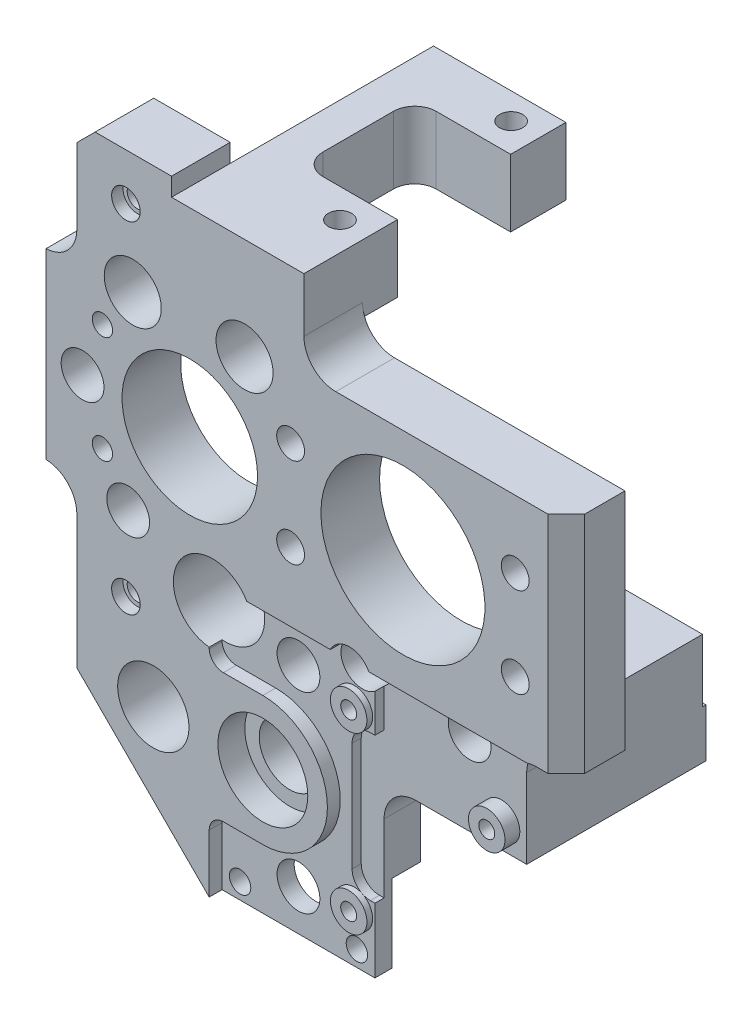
ISO-10303-21;
HEADER;
FILE_DESCRIPTION(('STEP AP214'),'2;1');
FILE_NAME('part.step','',(''),(''),'','','');
FILE_SCHEMA(('AUTOMOTIVE_DESIGN { 1 0 10303 214 1 1 1 1 }'));
ENDSEC;
DATA;
#1=APPLICATION_CONTEXT('core data for automotive mechanical design processes');
#2=APPLICATION_PROTOCOL_DEFINITION('international standard','automotive_design',2000,#1);
#3=PRODUCT_CONTEXT('',#1,'mechanical');
#4=PRODUCT('Part','Part','',(#3));
#5=PRODUCT_RELATED_PRODUCT_CATEGORY('part','',(#4));
#6=PRODUCT_DEFINITION_FORMATION('','',#4);
#7=PRODUCT_DEFINITION_CONTEXT('part definition',#1,'design');
#8=PRODUCT_DEFINITION('design','',#6,#7);
#9=PRODUCT_DEFINITION_SHAPE('','',#8);
#10=(LENGTH_UNIT() NAMED_UNIT(*) SI_UNIT(.MILLI.,.METRE.));
#11=(NAMED_UNIT(*) PLANE_ANGLE_UNIT() SI_UNIT($,.RADIAN.));
#12=(NAMED_UNIT(*) SI_UNIT($,.STERADIAN.) SOLID_ANGLE_UNIT());
#13=UNCERTAINTY_MEASURE_WITH_UNIT(LENGTH_MEASURE(1.E-05),#10,'distance_accuracy_value','');
#14=(GEOMETRIC_REPRESENTATION_CONTEXT(3) GLOBAL_UNCERTAINTY_ASSIGNED_CONTEXT((#13)) GLOBAL_UNIT_ASSIGNED_CONTEXT((#10,
#11,#12)) REPRESENTATION_CONTEXT('',''));
#15=CARTESIAN_POINT('',(0.,0.,0.));
#16=DIRECTION('',(0.,0.,1.));
#17=DIRECTION('',(1.,0.,0.));
#18=AXIS2_PLACEMENT_3D('',#15,#16,#17);
#19=CARTESIAN_POINT('',(-16.51,-18.941358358,6.528054));
#20=DIRECTION('',(0.,0.,1.));
#21=DIRECTION('',(1.,0.,0.));
#22=AXIS2_PLACEMENT_3D('',#19,#20,#21);
#23=CYLINDRICAL_SURFACE('',#22,1.13029999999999);
#24=CARTESIAN_POINT('',(-16.51,-18.941358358,0.));
#25=DIRECTION('',(0.,0.,1.));
#26=DIRECTION('',(1.,0.,0.));
#27=AXIS2_PLACEMENT_3D('',#24,#25,#26);
#28=CIRCLE('',#27,1.13029999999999);
#29=CARTESIAN_POINT('',(-15.3797,-18.941358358,0.));
#30=VERTEX_POINT('',#29);
#31=EDGE_CURVE('E669',#30,#30,#28,.T.);
#32=ORIENTED_EDGE('',*,*,#31,.F.);
#33=EDGE_LOOP('',(#32));
#34=FACE_BOUND('',#33,.T.);
#35=CARTESIAN_POINT('',(-16.51,-18.941358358,5.258054));
#36=DIRECTION('',(0.,0.,1.));
#37=DIRECTION('',(1.,0.,0.));
#38=AXIS2_PLACEMENT_3D('',#35,#36,#37);
#39=CIRCLE('',#38,1.13029999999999);
#40=CARTESIAN_POINT('',(-15.3797,-18.941358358,5.258054));
#41=VERTEX_POINT('',#40);
#42=EDGE_CURVE('E51',#41,#41,#39,.F.);
#43=ORIENTED_EDGE('',*,*,#42,.F.);
#44=EDGE_LOOP('',(#43));
#45=FACE_BOUND('',#44,.T.);
#46=ADVANCED_FACE('F47',(#34,#45),#23,.F.);
#47=CARTESIAN_POINT('',(-16.51,18.941358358,6.528054));
#48=DIRECTION('',(0.,0.,1.));
#49=DIRECTION('',(1.,0.,0.));
#50=AXIS2_PLACEMENT_3D('',#47,#48,#49);
#51=CYLINDRICAL_SURFACE('',#50,1.13029999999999);
#52=CARTESIAN_POINT('',(-16.51,18.941358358,0.));
#53=DIRECTION('',(0.,0.,1.));
#54=DIRECTION('',(1.,0.,0.));
#55=AXIS2_PLACEMENT_3D('',#52,#53,#54);
#56=CIRCLE('',#55,1.13029999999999);
#57=CARTESIAN_POINT('',(-15.3797,18.941358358,0.));
#58=VERTEX_POINT('',#57);
#59=EDGE_CURVE('E641',#58,#58,#56,.T.);
#60=ORIENTED_EDGE('',*,*,#59,.F.);
#61=EDGE_LOOP('',(#60));
#62=FACE_BOUND('',#61,.T.);
#63=CARTESIAN_POINT('',(-16.51,18.941358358,5.258054));
#64=DIRECTION('',(0.,0.,1.));
#65=DIRECTION('',(1.,0.,0.));
#66=AXIS2_PLACEMENT_3D('',#63,#64,#65);
#67=CIRCLE('',#66,1.13029999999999);
#68=CARTESIAN_POINT('',(-15.3797,18.941358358,5.258054));
#69=VERTEX_POINT('',#68);
#70=EDGE_CURVE('E561',#69,#69,#67,.F.);
#71=ORIENTED_EDGE('',*,*,#70,.F.);
#72=EDGE_LOOP('',(#71));
#73=FACE_BOUND('',#72,.T.);
#74=ADVANCED_FACE('F1200',(#62,#73),#51,.F.);
#75=CARTESIAN_POINT('',(-7.23900000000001,-15.20698,5.73405));
#76=DIRECTION('',(-1.,0.,0.));
#77=DIRECTION('',(0.,-1.,0.));
#78=AXIS2_PLACEMENT_3D('',#75,#76,#77);
#79=PLANE('',#78);
#80=DIRECTION('',(0.,0.,-1.));
#81=VECTOR('',#80,1.);
#82=CARTESIAN_POINT('',(-7.23900000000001,-36.80968,28.3966203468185));
#83=LINE('',#82,#81);
#84=CARTESIAN_POINT('',(-7.23900000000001,-36.80968,6.5278));
#85=VERTEX_POINT('',#84);
#86=CARTESIAN_POINT('',(-7.23900000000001,-36.80968,5.09905));
#87=VERTEX_POINT('',#86);
#88=EDGE_CURVE('E68',#85,#87,#83,.T.);
#89=ORIENTED_EDGE('',*,*,#88,.F.);
#90=DIRECTION('',(0.,-1.,0.));
#91=VECTOR('',#90,1.);
#92=CARTESIAN_POINT('',(-7.23900000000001,-15.20698,6.5278));
#93=LINE('',#92,#91);
#94=CARTESIAN_POINT('',(-7.239,-43.27398,6.5278));
#95=VERTEX_POINT('',#94);
#96=EDGE_CURVE('E956',#85,#95,#93,.T.);
#97=ORIENTED_EDGE('',*,*,#96,.T.);
#98=DIRECTION('',(0.,0.,1.));
#99=VECTOR('',#98,1.);
#100=CARTESIAN_POINT('',(-7.239,-43.27398,5.73405));
#101=LINE('',#100,#99);
#102=CARTESIAN_POINT('',(-7.23900000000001,-43.27398,5.09905));
#103=VERTEX_POINT('',#102);
#104=EDGE_CURVE('E959',#103,#95,#101,.T.);
#105=ORIENTED_EDGE('',*,*,#104,.F.);
#106=DIRECTION('',(0.,-1.,0.));
#107=VECTOR('',#106,1.);
#108=CARTESIAN_POINT('',(-7.23900000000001,-15.20698,5.09905));
#109=LINE('',#108,#107);
#110=EDGE_CURVE('E878',#87,#103,#109,.T.);
#111=ORIENTED_EDGE('',*,*,#110,.F.);
#112=EDGE_LOOP('',(#89,#97,#105,#111));
#113=FACE_BOUND('',#112,.T.);
#114=ADVANCED_FACE('F1206',(#113),#79,.F.);
#115=DIRECTION('',(0.,0.,-1.));
#116=VECTOR('',#115,1.);
#117=CARTESIAN_POINT('',(-7.23900000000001,-19.3416122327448,28.3966203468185));
#118=LINE('',#117,#116);
#119=CARTESIAN_POINT('',(-7.23900000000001,-19.3416122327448,6.5278));
#120=VERTEX_POINT('',#119);
#121=CARTESIAN_POINT('',(-7.23900000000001,-19.3416122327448,5.09905));
#122=VERTEX_POINT('',#121);
#123=EDGE_CURVE('E638',#120,#122,#118,.T.);
#124=ORIENTED_EDGE('',*,*,#123,.T.);
#125=CARTESIAN_POINT('',(-7.23900000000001,-19.1749477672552,5.09905));
#126=VERTEX_POINT('',#125);
#127=EDGE_CURVE('E879',#126,#122,#109,.T.);
#128=ORIENTED_EDGE('',*,*,#127,.F.);
#129=DIRECTION('',(0.,0.,-1.));
#130=VECTOR('',#129,1.);
#131=CARTESIAN_POINT('',(-7.23900000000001,-19.1749477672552,0.));
#132=LINE('',#131,#130);
#133=CARTESIAN_POINT('',(-7.23900000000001,-19.1749477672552,6.5278));
#134=VERTEX_POINT('',#133);
#135=EDGE_CURVE('E850',#126,#134,#132,.F.);
#136=ORIENTED_EDGE('',*,*,#135,.T.);
#137=EDGE_CURVE('E79',#134,#120,#93,.T.);
#138=ORIENTED_EDGE('',*,*,#137,.T.);
#139=EDGE_LOOP('',(#124,#128,#136,#138));
#140=FACE_BOUND('',#139,.T.);
#141=ADVANCED_FACE('F1336',(#140),#79,.F.);
#142=CARTESIAN_POINT('',(-4.69900000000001,-15.20698,5.09905));
#143=DIRECTION('',(0.,0.,-1.));
#144=DIRECTION('',(-1.,0.,0.));
#145=AXIS2_PLACEMENT_3D('',#142,#143,#144);
#146=PLANE('',#145);
#147=CARTESIAN_POINT('',(1.27,-38.70198,5.09905));
#148=DIRECTION('',(0.,0.,-1.));
#149=DIRECTION('',(-1.,0.,0.));
#150=AXIS2_PLACEMENT_3D('',#147,#148,#149);
#151=CIRCLE('',#150,2.38124999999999);
#152=CARTESIAN_POINT('',(-1.11124999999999,-38.70198,5.09905));
#153=VERTEX_POINT('',#152);
#154=EDGE_CURVE('E813',#153,#153,#151,.T.);
#155=ORIENTED_EDGE('',*,*,#154,.T.);
#156=EDGE_LOOP('',(#155));
#157=FACE_BOUND('',#156,.T.);
#158=CARTESIAN_POINT('',(1.27,-17.36598,5.09905));
#159=DIRECTION('',(0.,0.,-1.));
#160=DIRECTION('',(-1.,0.,0.));
#161=AXIS2_PLACEMENT_3D('',#158,#159,#160);
#162=CIRCLE('',#161,2.38124999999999);
#163=CARTESIAN_POINT('',(-1.11124999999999,-17.36598,5.09905));
#164=VERTEX_POINT('',#163);
#165=EDGE_CURVE('E799',#164,#164,#162,.T.);
#166=ORIENTED_EDGE('',*,*,#165,.T.);
#167=EDGE_LOOP('',(#166));
#168=FACE_BOUND('',#167,.T.);
#169=CARTESIAN_POINT('',(-5.23000000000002,-41.49598,5.09905));
#170=DIRECTION('',(0.,0.,-1.));
#171=DIRECTION('',(-1.,0.,0.));
#172=AXIS2_PLACEMENT_3D('',#169,#170,#171);
#173=CIRCLE('',#172,1.190625);
#174=CARTESIAN_POINT('',(-4.03937500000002,-41.49598,5.09905));
#175=VERTEX_POINT('',#174);
#176=EDGE_CURVE('E723',#175,#175,#173,.T.);
#177=ORIENTED_EDGE('',*,*,#176,.T.);
#178=EDGE_LOOP('',(#177));
#179=FACE_BOUND('',#178,.T.);
#180=CARTESIAN_POINT('',(7.77,-41.49598,5.09905));
#181=DIRECTION('',(0.,0.,-1.));
#182=DIRECTION('',(-1.,0.,0.));
#183=AXIS2_PLACEMENT_3D('',#180,#181,#182);
#184=CIRCLE('',#183,1.190625);
#185=CARTESIAN_POINT('',(8.960625,-41.49598,5.09905));
#186=VERTEX_POINT('',#185);
#187=EDGE_CURVE('E715',#186,#186,#184,.T.);
#188=ORIENTED_EDGE('',*,*,#187,.T.);
#189=EDGE_LOOP('',(#188));
#190=FACE_BOUND('',#189,.T.);
#191=CARTESIAN_POINT('',(-5.65150000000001,-36.80968,5.09905));
#192=DIRECTION('',(0.,0.,-1.));
#193=DIRECTION('',(1.,0.,0.));
#194=AXIS2_PLACEMENT_3D('',#191,#192,#193);
#195=CIRCLE('',#194,1.5875);
#196=CARTESIAN_POINT('',(-5.65150000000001,-35.22218,5.09905));
#197=VERTEX_POINT('',#196);
#198=EDGE_CURVE('E604',#87,#197,#195,.T.);
#199=ORIENTED_EDGE('',*,*,#198,.F.);
#200=ORIENTED_EDGE('',*,*,#110,.T.);
#201=DIRECTION('',(1.,0.,0.));
#202=VECTOR('',#201,1.);
#203=CARTESIAN_POINT('',(-7.23900000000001,-43.27398,5.09905));
#204=LINE('',#203,#202);
#205=CARTESIAN_POINT('',(9.77899999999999,-43.27398,5.09905));
#206=VERTEX_POINT('',#205);
#207=EDGE_CURVE('E882',#103,#206,#204,.T.);
#208=ORIENTED_EDGE('',*,*,#207,.T.);
#209=DIRECTION('',(0.,-1.,0.));
#210=VECTOR('',#209,1.);
#211=CARTESIAN_POINT('',(9.779,-24.892,5.09905));
#212=LINE('',#211,#210);
#213=CARTESIAN_POINT('',(9.779,-36.0635563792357,5.09905));
#214=VERTEX_POINT('',#213);
#215=EDGE_CURVE('E895',#214,#206,#212,.T.);
#216=ORIENTED_EDGE('',*,*,#215,.F.);
#217=DIRECTION('',(1.,0.,0.));
#218=VECTOR('',#217,1.);
#219=CARTESIAN_POINT('',(9.27099999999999,-36.0635563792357,5.09905));
#220=LINE('',#219,#218);
#221=CARTESIAN_POINT('',(9.27099999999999,-36.0635563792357,5.09905));
#222=VERTEX_POINT('',#221);
#223=EDGE_CURVE('E681',#222,#214,#220,.T.);
#224=ORIENTED_EDGE('',*,*,#223,.F.);
#225=CARTESIAN_POINT('',(9.27099999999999,-34.0315563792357,5.09905));
#226=DIRECTION('',(0.,0.,1.));
#227=DIRECTION('',(-1.,0.,0.));
#228=AXIS2_PLACEMENT_3D('',#225,#226,#227);
#229=CIRCLE('',#228,2.032);
#230=CARTESIAN_POINT('',(8.38199999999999,-35.8587681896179,5.09905));
#231=VERTEX_POINT('',#230);
#232=EDGE_CURVE('E677',#231,#222,#229,.T.);
#233=ORIENTED_EDGE('',*,*,#232,.F.);
#234=CARTESIAN_POINT('',(7.49299999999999,-37.68598,5.09905));
#235=DIRECTION('',(0.,0.,1.));
#236=DIRECTION('',(1.,0.,0.));
#237=AXIS2_PLACEMENT_3D('',#234,#235,#236);
#238=CIRCLE('',#237,2.03199999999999);
#239=EDGE_CURVE('E870',#231,#231,#238,.T.);
#240=ORIENTED_EDGE('',*,*,#239,.F.);
#241=CARTESIAN_POINT('',(7.239,-34.0315563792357,5.09905));
#242=VERTEX_POINT('',#241);
#243=EDGE_CURVE('E678',#242,#231,#229,.T.);
#244=ORIENTED_EDGE('',*,*,#243,.F.);
#245=DIRECTION('',(0.,-1.,0.));
#246=VECTOR('',#245,1.);
#247=CARTESIAN_POINT('',(7.239,-34.0315563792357,5.09905));
#248=LINE('',#247,#246);
#249=CARTESIAN_POINT('',(7.239,-21.9094036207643,5.09905));
#250=VERTEX_POINT('',#249);
#251=EDGE_CURVE('E673',#250,#242,#248,.T.);
#252=ORIENTED_EDGE('',*,*,#251,.F.);
#253=CARTESIAN_POINT('',(9.27099999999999,-21.9094036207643,5.09905));
#254=DIRECTION('',(0.,0.,1.));
#255=DIRECTION('',(-1.,0.,0.));
#256=AXIS2_PLACEMENT_3D('',#253,#254,#255);
#257=CIRCLE('',#256,2.032);
#258=CARTESIAN_POINT('',(8.382,-20.0821918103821,5.09905));
#259=VERTEX_POINT('',#258);
#260=EDGE_CURVE('E668',#259,#250,#257,.T.);
#261=ORIENTED_EDGE('',*,*,#260,.F.);
#262=CARTESIAN_POINT('',(7.493,-18.25498,5.09905));
#263=DIRECTION('',(0.,0.,1.));
#264=DIRECTION('',(1.,0.,0.));
#265=AXIS2_PLACEMENT_3D('',#262,#263,#264);
#266=CIRCLE('',#265,2.032);
#267=EDGE_CURVE('E874',#259,#259,#266,.T.);
#268=ORIENTED_EDGE('',*,*,#267,.F.);
#269=CARTESIAN_POINT('',(9.27099999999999,-19.8774036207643,5.09905));
#270=VERTEX_POINT('',#269);
#271=EDGE_CURVE('E670',#270,#259,#257,.T.);
#272=ORIENTED_EDGE('',*,*,#271,.F.);
#273=DIRECTION('',(-1.,0.,0.));
#274=VECTOR('',#273,1.);
#275=CARTESIAN_POINT('',(9.27099999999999,-19.8774036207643,5.09905));
#276=LINE('',#275,#274);
#277=CARTESIAN_POINT('',(9.779,-19.8774036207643,5.09905));
#278=VERTEX_POINT('',#277);
#279=EDGE_CURVE('E664',#278,#270,#276,.T.);
#280=ORIENTED_EDGE('',*,*,#279,.F.);
#281=CARTESIAN_POINT('',(9.779,-15.6444041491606,5.09905));
#282=VERTEX_POINT('',#281);
#283=EDGE_CURVE('E890',#282,#278,#212,.T.);
#284=ORIENTED_EDGE('',*,*,#283,.F.);
#285=CARTESIAN_POINT('',(8.382,-13.716,5.09905));
#286=DIRECTION('',(0.,0.,-1.));
#287=DIRECTION('',(-1.,0.,0.));
#288=AXIS2_PLACEMENT_3D('',#285,#286,#287);
#289=CIRCLE('',#288,2.38124999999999);
#290=CARTESIAN_POINT('',(6.24426554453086,-12.66698,5.09905));
#291=VERTEX_POINT('',#290);
#292=EDGE_CURVE('E788',#282,#291,#289,.T.);
#293=ORIENTED_EDGE('',*,*,#292,.T.);
#294=DIRECTION('',(-1.,0.,0.));
#295=VECTOR('',#294,1.);
#296=CARTESIAN_POINT('',(32.512,-12.66698,5.09905));
#297=LINE('',#296,#295);
#298=CARTESIAN_POINT('',(-3.0636093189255,-12.66698,5.09905));
#299=VERTEX_POINT('',#298);
#300=EDGE_CURVE('E886',#291,#299,#297,.T.);
#301=ORIENTED_EDGE('',*,*,#300,.T.);
#302=CARTESIAN_POINT('',(-6.858,-14.82598,5.09905));
#303=DIRECTION('',(0.,0.,-1.));
#304=DIRECTION('',(-1.,0.,0.));
#305=AXIS2_PLACEMENT_3D('',#302,#303,#304);
#306=CIRCLE('',#305,4.365625);
#307=EDGE_CURVE('E1714',#299,#126,#306,.T.);
#308=ORIENTED_EDGE('',*,*,#307,.T.);
#309=ORIENTED_EDGE('',*,*,#127,.T.);
#310=CARTESIAN_POINT('',(-5.6536886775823,-19.25828,5.09905));
#311=DIRECTION('',(0.,0.,-1.));
#312=DIRECTION('',(1.,0.,0.));
#313=AXIS2_PLACEMENT_3D('',#310,#311,#312);
#314=CIRCLE('',#313,1.5875);
#315=CARTESIAN_POINT('',(-5.6536886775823,-20.84578,5.09905));
#316=VERTEX_POINT('',#315);
#317=EDGE_CURVE('E600',#316,#122,#314,.T.);
#318=ORIENTED_EDGE('',*,*,#317,.F.);
#319=DIRECTION('',(-1.,0.,0.));
#320=VECTOR('',#319,1.);
#321=CARTESIAN_POINT('',(-1.27,-20.84578,5.09905));
#322=LINE('',#321,#320);
#323=CARTESIAN_POINT('',(-1.27,-20.84578,5.09905));
#324=VERTEX_POINT('',#323);
#325=EDGE_CURVE('E616',#324,#316,#322,.T.);
#326=ORIENTED_EDGE('',*,*,#325,.F.);
#327=CARTESIAN_POINT('',(-1.27,-28.03398,5.09905));
#328=DIRECTION('',(0.,0.,1.));
#329=DIRECTION('',(1.,0.,0.));
#330=AXIS2_PLACEMENT_3D('',#327,#328,#329);
#331=CIRCLE('',#330,7.1882);
#332=CARTESIAN_POINT('',(-1.27,-35.22218,5.09905));
#333=VERTEX_POINT('',#332);
#334=EDGE_CURVE('E612',#333,#324,#331,.T.);
#335=ORIENTED_EDGE('',*,*,#334,.F.);
#336=DIRECTION('',(1.,0.,0.));
#337=VECTOR('',#336,1.);
#338=CARTESIAN_POINT('',(-1.27,-35.22218,5.09905));
#339=LINE('',#338,#337);
#340=EDGE_CURVE('E608',#197,#333,#339,.T.);
#341=ORIENTED_EDGE('',*,*,#340,.F.);
#342=EDGE_LOOP('',(#199,#200,#208,#216,#224,#233,#240,#244,#252,#261,#268,#272,#280,#284,#293,
#301,#308,#309,#318,#326,#335,#341));
#343=FACE_BOUND('',#342,.T.);
#344=ADVANCED_FACE('F1195',(#157,#168,#179,#190,#343),#146,.F.);
#345=CARTESIAN_POINT('',(9.779,-24.892,6.5278));
#346=DIRECTION('',(-1.,0.,0.));
#347=DIRECTION('',(0.,-1.,0.));
#348=AXIS2_PLACEMENT_3D('',#345,#346,#347);
#349=PLANE('',#348);
#350=ORIENTED_EDGE('',*,*,#283,.T.);
#351=DIRECTION('',(0.,0.,1.));
#352=VECTOR('',#351,1.);
#353=CARTESIAN_POINT('',(9.779,-19.8774036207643,-12.3011845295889));
#354=LINE('',#353,#352);
#355=CARTESIAN_POINT('',(9.779,-19.8774036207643,4.08305));
#356=VERTEX_POINT('',#355);
#357=EDGE_CURVE('E684',#356,#278,#354,.T.);
#358=ORIENTED_EDGE('',*,*,#357,.F.);
#359=DIRECTION('',(0.,-1.,0.));
#360=VECTOR('',#359,1.);
#361=CARTESIAN_POINT('',(9.779,-31.5182040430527,4.08305));
#362=LINE('',#361,#360);
#363=CARTESIAN_POINT('',(9.779,-15.6444041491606,4.08305));
#364=VERTEX_POINT('',#363);
#365=EDGE_CURVE('E736',#364,#356,#362,.T.);
#366=ORIENTED_EDGE('',*,*,#365,.F.);
#367=DIRECTION('',(0.,0.,1.));
#368=VECTOR('',#367,1.);
#369=CARTESIAN_POINT('',(9.779,-15.6444041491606,6.5278));
#370=LINE('',#369,#368);
#371=EDGE_CURVE('E57',#282,#364,#370,.F.);
#372=ORIENTED_EDGE('',*,*,#371,.F.);
#373=EDGE_LOOP('',(#350,#358,#366,#372));
#374=FACE_BOUND('',#373,.T.);
#375=ADVANCED_FACE('F1189',(#374),#349,.F.);
#376=CARTESIAN_POINT('',(-25.4,-43.27398,6.5278));
#377=DIRECTION('',(0.,0.,1.));
#378=DIRECTION('',(1.,0.,0.));
#379=AXIS2_PLACEMENT_3D('',#376,#377,#378);
#380=PLANE('',#379);
#381=CARTESIAN_POINT('',(-16.51,-18.941358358,6.5278));
#382=DIRECTION('',(0.,0.,1.));
#383=DIRECTION('',(1.,0.,0.));
#384=AXIS2_PLACEMENT_3D('',#381,#382,#383);
#385=CIRCLE('',#384,1.6002);
#386=CARTESIAN_POINT('',(-14.9098,-18.941358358,6.5278));
#387=VERTEX_POINT('',#386);
#388=EDGE_CURVE('E12',#387,#387,#385,.T.);
#389=ORIENTED_EDGE('',*,*,#388,.F.);
#390=EDGE_LOOP('',(#389));
#391=FACE_BOUND('',#390,.T.);
#392=CARTESIAN_POINT('',(-15.748,10.795,6.5278));
#393=DIRECTION('',(0.,0.,-1.));
#394=DIRECTION('',(-1.,0.,0.));
#395=AXIS2_PLACEMENT_3D('',#392,#393,#394);
#396=CIRCLE('',#395,3.175);
#397=CARTESIAN_POINT('',(-18.923,10.795,6.5278));
#398=VERTEX_POINT('',#397);
#399=EDGE_CURVE('E818',#398,#398,#396,.T.);
#400=ORIENTED_EDGE('',*,*,#399,.T.);
#401=EDGE_LOOP('',(#400));
#402=FACE_BOUND('',#401,.T.);
#403=CARTESIAN_POINT('',(-3.302,10.795,6.5278));
#404=DIRECTION('',(0.,0.,-1.));
#405=DIRECTION('',(-1.,0.,0.));
#406=AXIS2_PLACEMENT_3D('',#403,#404,#405);
#407=CIRCLE('',#406,3.175);
#408=CARTESIAN_POINT('',(-6.477,10.795,6.5278));
#409=VERTEX_POINT('',#408);
#410=EDGE_CURVE('E826',#409,#409,#407,.T.);
#411=ORIENTED_EDGE('',*,*,#410,.T.);
#412=EDGE_LOOP('',(#411));
#413=FACE_BOUND('',#412,.T.);
#414=CARTESIAN_POINT('',(-13.462,-28.03398,6.5278));
#415=DIRECTION('',(0.,0.,-1.));
#416=DIRECTION('',(-1.,0.,0.));
#417=AXIS2_PLACEMENT_3D('',#414,#415,#416);
#418=CIRCLE('',#417,3.96875);
#419=CARTESIAN_POINT('',(-17.43075,-28.03398,6.5278));
#420=VERTEX_POINT('',#419);
#421=EDGE_CURVE('E834',#420,#420,#418,.T.);
#422=ORIENTED_EDGE('',*,*,#421,.T.);
#423=EDGE_LOOP('',(#422));
#424=FACE_BOUND('',#423,.T.);
#425=CARTESIAN_POINT('',(-9.398,0.,6.5278));
#426=DIRECTION('',(0.,0.,1.));
#427=DIRECTION('',(1.,0.,0.));
#428=AXIS2_PLACEMENT_3D('',#425,#426,#427);
#429=CIRCLE('',#428,7.540625);
#430=CARTESIAN_POINT('',(-1.857375,0.,6.5278));
#431=VERTEX_POINT('',#430);
#432=EDGE_CURVE('E857',#431,#431,#429,.T.);
#433=ORIENTED_EDGE('',*,*,#432,.F.);
#434=EDGE_LOOP('',(#433));
#435=FACE_BOUND('',#434,.T.);
#436=CARTESIAN_POINT('',(26.823,5.,6.5278));
#437=DIRECTION('',(0.,0.,1.));
#438=DIRECTION('',(1.,0.,0.));
#439=AXIS2_PLACEMENT_3D('',#436,#437,#438);
#440=CIRCLE('',#439,1.54999999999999);
#441=CARTESIAN_POINT('',(28.373,5.,6.5278));
#442=VERTEX_POINT('',#441);
#443=EDGE_CURVE('E988',#442,#442,#440,.T.);
#444=ORIENTED_EDGE('',*,*,#443,.F.);
#445=EDGE_LOOP('',(#444));
#446=FACE_BOUND('',#445,.T.);
#447=CARTESIAN_POINT('',(1.82299999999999,-5.,6.5278));
#448=DIRECTION('',(0.,0.,1.));
#449=DIRECTION('',(1.,0.,0.));
#450=AXIS2_PLACEMENT_3D('',#447,#448,#449);
#451=CIRCLE('',#450,1.54999999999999);
#452=CARTESIAN_POINT('',(3.37299999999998,-5.,6.5278));
#453=VERTEX_POINT('',#452);
#454=EDGE_CURVE('E983',#453,#453,#451,.T.);
#455=ORIENTED_EDGE('',*,*,#454,.F.);
#456=EDGE_LOOP('',(#455));
#457=FACE_BOUND('',#456,.T.);
#458=CARTESIAN_POINT('',(1.82299999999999,5.,6.5278));
#459=DIRECTION('',(0.,0.,1.));
#460=DIRECTION('',(1.,0.,0.));
#461=AXIS2_PLACEMENT_3D('',#458,#459,#460);
#462=CIRCLE('',#461,1.54999999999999);
#463=CARTESIAN_POINT('',(3.37299999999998,5.,6.5278));
#464=VERTEX_POINT('',#463);
#465=EDGE_CURVE('E978',#464,#464,#462,.T.);
#466=ORIENTED_EDGE('',*,*,#465,.F.);
#467=EDGE_LOOP('',(#466));
#468=FACE_BOUND('',#467,.T.);
#469=CARTESIAN_POINT('',(26.823,-5.,6.5278));
#470=DIRECTION('',(0.,0.,1.));
#471=DIRECTION('',(1.,0.,0.));
#472=AXIS2_PLACEMENT_3D('',#469,#470,#471);
#473=CIRCLE('',#472,1.54999999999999);
#474=CARTESIAN_POINT('',(28.373,-5.,6.5278));
#475=VERTEX_POINT('',#474);
#476=EDGE_CURVE('E973',#475,#475,#473,.T.);
#477=ORIENTED_EDGE('',*,*,#476,.F.);
#478=EDGE_LOOP('',(#477));
#479=FACE_BOUND('',#478,.T.);
#480=CARTESIAN_POINT('',(-19.1232329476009,5.96899994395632,6.5278));
#481=DIRECTION('',(0.,0.,1.));
#482=DIRECTION('',(1.,0.,0.));
#483=AXIS2_PLACEMENT_3D('',#480,#481,#482);
#484=CIRCLE('',#483,1.13029999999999);
#485=CARTESIAN_POINT('',(-17.9929329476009,5.96899994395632,6.5278));
#486=VERTEX_POINT('',#485);
#487=EDGE_CURVE('E968',#486,#486,#484,.T.);
#488=ORIENTED_EDGE('',*,*,#487,.F.);
#489=EDGE_LOOP('',(#488));
#490=FACE_BOUND('',#489,.T.);
#491=CARTESIAN_POINT('',(-19.1232329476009,-5.96900005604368,6.5278));
#492=DIRECTION('',(0.,0.,1.));
#493=DIRECTION('',(1.,0.,0.));
#494=AXIS2_PLACEMENT_3D('',#491,#492,#493);
#495=CIRCLE('',#494,1.13029999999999);
#496=CARTESIAN_POINT('',(-17.9929329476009,-5.96900005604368,6.5278));
#497=VERTEX_POINT('',#496);
#498=EDGE_CURVE('E963',#497,#497,#495,.T.);
#499=ORIENTED_EDGE('',*,*,#498,.F.);
#500=EDGE_LOOP('',(#499));
#501=FACE_BOUND('',#500,.T.);
#502=CARTESIAN_POINT('',(14.323,0.,6.5278));
#503=DIRECTION('',(0.,0.,-1.));
#504=DIRECTION('',(-1.,0.,0.));
#505=AXIS2_PLACEMENT_3D('',#502,#503,#504);
#506=CIRCLE('',#505,9.128125);
#507=CARTESIAN_POINT('',(5.19487499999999,0.,6.5278));
#508=VERTEX_POINT('',#507);
#509=EDGE_CURVE('E862',#508,#508,#506,.T.);
#510=ORIENTED_EDGE('',*,*,#509,.T.);
#511=EDGE_LOOP('',(#510));
#512=FACE_BOUND('',#511,.T.);
#513=CARTESIAN_POINT('',(-21.336,0.,6.5278));
#514=DIRECTION('',(0.,0.,1.));
#515=DIRECTION('',(1.,0.,0.));
#516=AXIS2_PLACEMENT_3D('',#513,#514,#515);
#517=CIRCLE('',#516,2.38124999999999);
#518=CARTESIAN_POINT('',(-18.95475,0.,6.5278));
#519=VERTEX_POINT('',#518);
#520=EDGE_CURVE('E812',#519,#519,#517,.T.);
#521=ORIENTED_EDGE('',*,*,#520,.F.);
#522=EDGE_LOOP('',(#521));
#523=FACE_BOUND('',#522,.T.);
#524=CARTESIAN_POINT('',(-16.256,-10.50798,6.5278));
#525=DIRECTION('',(0.,0.,1.));
#526=DIRECTION('',(1.,0.,0.));
#527=AXIS2_PLACEMENT_3D('',#524,#525,#526);
#528=CIRCLE('',#527,2.38124999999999);
#529=CARTESIAN_POINT('',(-13.87475,-10.50798,6.5278));
#530=VERTEX_POINT('',#529);
#531=EDGE_CURVE('E803',#530,#530,#528,.T.);
#532=ORIENTED_EDGE('',*,*,#531,.F.);
#533=EDGE_LOOP('',(#532));
#534=FACE_BOUND('',#533,.T.);
#535=DIRECTION('',(1.,0.,0.));
#536=VECTOR('',#535,1.);
#537=CARTESIAN_POINT('',(3.302,22.098,6.5278));
#538=LINE('',#537,#536);
#539=CARTESIAN_POINT('',(-11.43,22.098,6.5278));
#540=VERTEX_POINT('',#539);
#541=CARTESIAN_POINT('',(3.302,22.098,6.5278));
#542=VERTEX_POINT('',#541);
#543=EDGE_CURVE('E1038',#540,#542,#538,.T.);
#544=ORIENTED_EDGE('',*,*,#543,.F.);
#545=DIRECTION('',(0.,1.,0.));
#546=VECTOR('',#545,1.);
#547=CARTESIAN_POINT('',(-11.43,-7.50040104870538,6.5278));
#548=LINE('',#547,#546);
#549=CARTESIAN_POINT('',(-11.43,24.13,6.5278));
#550=VERTEX_POINT('',#549);
#551=EDGE_CURVE('E768',#540,#550,#548,.T.);
#552=ORIENTED_EDGE('',*,*,#551,.T.);
#553=DIRECTION('',(-1.,0.,0.));
#554=VECTOR('',#553,1.);
#555=CARTESIAN_POINT('',(-25.4,24.13,6.5278));
#556=LINE('',#555,#554);
#557=CARTESIAN_POINT('',(-19.939,24.13,6.5278));
#558=VERTEX_POINT('',#557);
#559=EDGE_CURVE('E1066',#550,#558,#556,.T.);
#560=ORIENTED_EDGE('',*,*,#559,.T.);
#561=DIRECTION('',(0.707106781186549,0.707106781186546,0.));
#562=VECTOR('',#561,1.);
#563=CARTESIAN_POINT('',(-56.37149,-12.3024899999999,6.5278));
#564=LINE('',#563,#562);
#565=CARTESIAN_POINT('',(-21.971,22.098,6.5278));
#566=VERTEX_POINT('',#565);
#567=EDGE_CURVE('E1711',#558,#566,#564,.F.);
#568=ORIENTED_EDGE('',*,*,#567,.T.);
#569=DIRECTION('',(0.,-1.,0.));
#570=VECTOR('',#569,1.);
#571=CARTESIAN_POINT('',(-21.971,24.13,6.5278));
#572=LINE('',#571,#570);
#573=CARTESIAN_POINT('',(-21.971,13.7137313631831,6.5278));
#574=VERTEX_POINT('',#573);
#575=EDGE_CURVE('E932',#566,#574,#572,.T.);
#576=ORIENTED_EDGE('',*,*,#575,.T.);
#577=CARTESIAN_POINT('',(-25.527,13.7137313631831,6.5278));
#578=DIRECTION('',(0.,0.,1.));
#579=DIRECTION('',(1.,0.,0.));
#580=AXIS2_PLACEMENT_3D('',#577,#578,#579);
#581=CIRCLE('',#580,3.556);
#582=CARTESIAN_POINT('',(-25.4,10.1599999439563,6.5278));
#583=VERTEX_POINT('',#582);
#584=EDGE_CURVE('E1828',#574,#583,#581,.F.);
#585=ORIENTED_EDGE('',*,*,#584,.T.);
#586=DIRECTION('',(0.,-1.,0.));
#587=VECTOR('',#586,1.);
#588=CARTESIAN_POINT('',(-25.4,24.13,6.5278));
#589=LINE('',#588,#587);
#590=CARTESIAN_POINT('',(-25.4,-10.1600000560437,6.5278));
#591=VERTEX_POINT('',#590);
#592=EDGE_CURVE('E1532',#583,#591,#589,.T.);
#593=ORIENTED_EDGE('',*,*,#592,.T.);
#594=CARTESIAN_POINT('',(-25.527,-13.7137314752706,6.5278));
#595=DIRECTION('',(0.,0.,1.));
#596=DIRECTION('',(1.,0.,0.));
#597=AXIS2_PLACEMENT_3D('',#594,#595,#596);
#598=CIRCLE('',#597,3.556);
#599=CARTESIAN_POINT('',(-21.971,-13.7137314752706,6.5278));
#600=VERTEX_POINT('',#599);
#601=EDGE_CURVE('E1635',#591,#600,#598,.F.);
#602=ORIENTED_EDGE('',*,*,#601,.T.);
#603=DIRECTION('',(0.,-1.,0.));
#604=VECTOR('',#603,1.);
#605=CARTESIAN_POINT('',(-21.971,-43.27398,6.5278));
#606=LINE('',#605,#604);
#607=CARTESIAN_POINT('',(-21.971,-28.54198,6.5278));
#608=VERTEX_POINT('',#607);
#609=EDGE_CURVE('E942',#600,#608,#606,.T.);
#610=ORIENTED_EDGE('',*,*,#609,.T.);
#611=DIRECTION('',(-0.707106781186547,0.707106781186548,0.));
#612=VECTOR('',#611,1.);
#613=CARTESIAN_POINT('',(-16.3195,-34.19348,6.5278));
#614=LINE('',#613,#612);
#615=EDGE_CURVE('E1437',#608,#95,#614,.F.);
#616=ORIENTED_EDGE('',*,*,#615,.T.);
#617=ORIENTED_EDGE('',*,*,#96,.F.);
#618=CARTESIAN_POINT('',(-5.65150000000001,-36.80968,6.5278));
#619=DIRECTION('',(0.,0.,1.));
#620=DIRECTION('',(1.,0.,0.));
#621=AXIS2_PLACEMENT_3D('',#618,#619,#620);
#622=CIRCLE('',#621,1.5875);
#623=CARTESIAN_POINT('',(-5.65150000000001,-35.22218,6.52780000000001));
#624=VERTEX_POINT('',#623);
#625=EDGE_CURVE('E592',#85,#624,#622,.F.);
#626=ORIENTED_EDGE('',*,*,#625,.T.);
#627=DIRECTION('',(1.,0.,0.));
#628=VECTOR('',#627,1.);
#629=CARTESIAN_POINT('',(-1.27,-35.22218,6.5278));
#630=LINE('',#629,#628);
#631=CARTESIAN_POINT('',(-1.27,-35.22218,6.52780000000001));
#632=VERTEX_POINT('',#631);
#633=EDGE_CURVE('E588',#624,#632,#630,.T.);
#634=ORIENTED_EDGE('',*,*,#633,.T.);
#635=CARTESIAN_POINT('',(-1.27,-28.03398,6.5278));
#636=DIRECTION('',(0.,0.,1.));
#637=DIRECTION('',(1.,0.,0.));
#638=AXIS2_PLACEMENT_3D('',#635,#636,#637);
#639=CIRCLE('',#638,7.1882);
#640=CARTESIAN_POINT('',(-1.27,-20.84578,6.52780000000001));
#641=VERTEX_POINT('',#640);
#642=EDGE_CURVE('E583',#632,#641,#639,.T.);
#643=ORIENTED_EDGE('',*,*,#642,.T.);
#644=DIRECTION('',(-1.,0.,0.));
#645=VECTOR('',#644,1.);
#646=CARTESIAN_POINT('',(-1.27,-20.84578,6.5278));
#647=LINE('',#646,#645);
#648=CARTESIAN_POINT('',(-5.6536886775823,-20.84578,6.5278));
#649=VERTEX_POINT('',#648);
#650=EDGE_CURVE('E579',#641,#649,#647,.T.);
#651=ORIENTED_EDGE('',*,*,#650,.T.);
#652=CARTESIAN_POINT('',(-5.6536886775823,-19.25828,6.5278));
#653=DIRECTION('',(0.,0.,1.));
#654=DIRECTION('',(1.,0.,0.));
#655=AXIS2_PLACEMENT_3D('',#652,#653,#654);
#656=CIRCLE('',#655,1.5875);
#657=EDGE_CURVE('E596',#649,#120,#656,.F.);
#658=ORIENTED_EDGE('',*,*,#657,.T.);
#659=ORIENTED_EDGE('',*,*,#137,.F.);
#660=CARTESIAN_POINT('',(-6.858,-14.82598,6.5278));
#661=DIRECTION('',(0.,0.,-1.));
#662=DIRECTION('',(-1.,0.,0.));
#663=AXIS2_PLACEMENT_3D('',#660,#661,#662);
#664=CIRCLE('',#663,4.365625);
#665=CARTESIAN_POINT('',(-3.0636093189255,-12.66698,6.5278));
#666=VERTEX_POINT('',#665);
#667=EDGE_CURVE('E846',#134,#666,#664,.T.);
#668=ORIENTED_EDGE('',*,*,#667,.T.);
#669=DIRECTION('',(-1.,0.,0.));
#670=VECTOR('',#669,1.);
#671=CARTESIAN_POINT('',(-4.69900000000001,-12.66698,6.5278));
#672=LINE('',#671,#670);
#673=CARTESIAN_POINT('',(6.24426554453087,-12.66698,6.5278));
#674=VERTEX_POINT('',#673);
#675=EDGE_CURVE('E951',#674,#666,#672,.T.);
#676=ORIENTED_EDGE('',*,*,#675,.F.);
#677=CARTESIAN_POINT('',(8.382,-13.716,6.5278));
#678=DIRECTION('',(0.,0.,1.));
#679=DIRECTION('',(1.,0.,0.));
#680=AXIS2_PLACEMENT_3D('',#677,#678,#679);
#681=CIRCLE('',#680,2.38124999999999);
#682=CARTESIAN_POINT('',(10.5197344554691,-12.66698,6.5278));
#683=VERTEX_POINT('',#682);
#684=EDGE_CURVE('E784',#683,#674,#681,.T.);
#685=ORIENTED_EDGE('',*,*,#684,.F.);
#686=CARTESIAN_POINT('',(28.1331158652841,-12.66698,6.5278));
#687=VERTEX_POINT('',#686);
#688=EDGE_CURVE('E952',#687,#683,#672,.T.);
#689=ORIENTED_EDGE('',*,*,#688,.F.);
#690=CARTESIAN_POINT('',(29.21,-16.056,6.5278));
#691=DIRECTION('',(0.,0.,1.));
#692=DIRECTION('',(1.,0.,0.));
#693=AXIS2_PLACEMENT_3D('',#690,#691,#692);
#694=CIRCLE('',#693,3.556);
#695=CARTESIAN_POINT('',(29.21,-12.5,6.5278));
#696=VERTEX_POINT('',#695);
#697=EDGE_CURVE('E1593',#687,#696,#694,.F.);
#698=ORIENTED_EDGE('',*,*,#697,.T.);
#699=DIRECTION('',(1.,0.,0.));
#700=VECTOR('',#699,1.);
#701=CARTESIAN_POINT('',(32.512,-12.5,6.5278));
#702=LINE('',#701,#700);
#703=CARTESIAN_POINT('',(30.48,-12.5,6.5278));
#704=VERTEX_POINT('',#703);
#705=EDGE_CURVE('E1520',#696,#704,#702,.T.);
#706=ORIENTED_EDGE('',*,*,#705,.T.);
#707=DIRECTION('',(0.,1.,0.));
#708=VECTOR('',#707,1.);
#709=CARTESIAN_POINT('',(30.48,12.5,6.5278));
#710=LINE('',#709,#708);
#711=CARTESIAN_POINT('',(30.48,12.5,6.5278));
#712=VERTEX_POINT('',#711);
#713=EDGE_CURVE('E1448',#704,#712,#710,.T.);
#714=ORIENTED_EDGE('',*,*,#713,.T.);
#715=DIRECTION('',(-1.,0.,0.));
#716=VECTOR('',#715,1.);
#717=CARTESIAN_POINT('',(32.512,12.5,6.5278));
#718=LINE('',#717,#716);
#719=CARTESIAN_POINT('',(6.858,12.5,6.5278));
#720=VERTEX_POINT('',#719);
#721=EDGE_CURVE('E1602',#712,#720,#718,.T.);
#722=ORIENTED_EDGE('',*,*,#721,.T.);
#723=CARTESIAN_POINT('',(6.858,16.056,6.5278));
#724=DIRECTION('',(0.,0.,1.));
#725=DIRECTION('',(1.,0.,0.));
#726=AXIS2_PLACEMENT_3D('',#723,#724,#725);
#727=CIRCLE('',#726,3.556);
#728=CARTESIAN_POINT('',(3.302,16.056,6.5278));
#729=VERTEX_POINT('',#728);
#730=EDGE_CURVE('E1630',#720,#729,#727,.F.);
#731=ORIENTED_EDGE('',*,*,#730,.T.);
#732=DIRECTION('',(0.,-1.,0.));
#733=VECTOR('',#732,1.);
#734=CARTESIAN_POINT('',(3.302,24.13,6.5278));
#735=LINE('',#734,#733);
#736=EDGE_CURVE('E1553',#542,#729,#735,.T.);
#737=ORIENTED_EDGE('',*,*,#736,.F.);
#738=EDGE_LOOP('',(#544,#552,#560,#568,#576,#585,#593,#602,#610,#616,#617,#626,#634,#643,#651,
#658,#659,#668,#676,#685,#689,#698,#706,#714,#722,#731,#737));
#739=FACE_BOUND('',#738,.T.);
#740=CARTESIAN_POINT('',(-16.51,18.941358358,6.5278));
#741=DIRECTION('',(0.,0.,1.));
#742=DIRECTION('',(1.,0.,0.));
#743=AXIS2_PLACEMENT_3D('',#740,#741,#742);
#744=CIRCLE('',#743,1.6002);
#745=CARTESIAN_POINT('',(-14.9098,18.941358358,6.5278));
#746=VERTEX_POINT('',#745);
#747=EDGE_CURVE('E710',#746,#746,#744,.T.);
#748=ORIENTED_EDGE('',*,*,#747,.F.);
#749=EDGE_LOOP('',(#748));
#750=FACE_BOUND('',#749,.T.);
#751=CARTESIAN_POINT('',(-1.27,-28.03398,6.5278));
#752=DIRECTION('',(0.,0.,1.));
#753=DIRECTION('',(1.,0.,0.));
#754=AXIS2_PLACEMENT_3D('',#751,#752,#753);
#755=CIRCLE('',#754,5.0038);
#756=CARTESIAN_POINT('',(3.7338,-28.03398,6.5278));
#757=VERTEX_POINT('',#756);
#758=EDGE_CURVE('E584',#757,#757,#755,.T.);
#759=ORIENTED_EDGE('',*,*,#758,.F.);
#760=EDGE_LOOP('',(#759));
#761=FACE_BOUND('',#760,.T.);
#762=ADVANCED_FACE('F1184',(#391,#402,#413,#424,#435,#446,#457,#468,#479,#490,#501,#512,#523,
#534,#739,#750,#761),#380,.T.);
#763=CARTESIAN_POINT('',(25.654,-24.892,6.5278));
#764=DIRECTION('',(0.,1.,0.));
#765=DIRECTION('',(0.,0.,1.));
#766=AXIS2_PLACEMENT_3D('',#763,#764,#765);
#767=PLANE('',#766);
#768=DIRECTION('',(1.,0.,0.));
#769=VECTOR('',#768,1.);
#770=CARTESIAN_POINT('',(25.654,-24.892,4.08305));
#771=LINE('',#770,#769);
#772=CARTESIAN_POINT('',(13.335,-24.892,4.08305));
#773=VERTEX_POINT('',#772);
#774=CARTESIAN_POINT('',(25.654,-24.892,4.08305));
#775=VERTEX_POINT('',#774);
#776=EDGE_CURVE('E747',#773,#775,#771,.T.);
#777=ORIENTED_EDGE('',*,*,#776,.F.);
#778=DIRECTION('',(0.,0.,-1.));
#779=VECTOR('',#778,1.);
#780=CARTESIAN_POINT('',(13.335,-24.892,0.));
#781=LINE('',#780,#779);
#782=CARTESIAN_POINT('',(13.335,-24.892,0.));
#783=VERTEX_POINT('',#782);
#784=EDGE_CURVE('E1506',#773,#783,#781,.T.);
#785=ORIENTED_EDGE('',*,*,#784,.T.);
#786=DIRECTION('',(1.,0.,0.));
#787=VECTOR('',#786,1.);
#788=CARTESIAN_POINT('',(25.654,-24.892,0.));
#789=LINE('',#788,#787);
#790=CARTESIAN_POINT('',(15.113,-24.892,0.));
#791=VERTEX_POINT('',#790);
#792=EDGE_CURVE('E1507',#783,#791,#789,.T.);
#793=ORIENTED_EDGE('',*,*,#792,.T.);
#794=DIRECTION('',(0.,0.,1.));
#795=VECTOR('',#794,1.);
#796=CARTESIAN_POINT('',(15.113,-24.892,-15.492000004));
#797=LINE('',#796,#795);
#798=CARTESIAN_POINT('',(15.113,-24.892,-15.873000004));
#799=VERTEX_POINT('',#798);
#800=EDGE_CURVE('E1556',#799,#791,#797,.T.);
#801=ORIENTED_EDGE('',*,*,#800,.F.);
#802=DIRECTION('',(-1.,0.,0.));
#803=VECTOR('',#802,1.);
#804=CARTESIAN_POINT('',(25.654,-24.892,-15.873000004));
#805=LINE('',#804,#803);
#806=CARTESIAN_POINT('',(25.654,-24.892,-15.873000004));
#807=VERTEX_POINT('',#806);
#808=EDGE_CURVE('E1028',#807,#799,#805,.T.);
#809=ORIENTED_EDGE('',*,*,#808,.F.);
#810=DIRECTION('',(0.,0.,-1.));
#811=VECTOR('',#810,1.);
#812=CARTESIAN_POINT('',(25.654,-24.892,6.5278));
#813=LINE('',#812,#811);
#814=EDGE_CURVE('E1526',#775,#807,#813,.T.);
#815=ORIENTED_EDGE('',*,*,#814,.F.);
#816=EDGE_LOOP('',(#777,#785,#793,#801,#809,#815));
#817=FACE_BOUND('',#816,.T.);
#818=ADVANCED_FACE('F1180',(#817),#767,.F.);
#819=CARTESIAN_POINT('',(25.654,-12.5,6.5278));
#820=DIRECTION('',(-1.,0.,0.));
#821=DIRECTION('',(0.,0.,1.));
#822=AXIS2_PLACEMENT_3D('',#819,#820,#821);
#823=PLANE('',#822);
#824=DIRECTION('',(0.,1.,0.));
#825=VECTOR('',#824,1.);
#826=CARTESIAN_POINT('',(25.654,-12.5,4.08305));
#827=LINE('',#826,#825);
#828=CARTESIAN_POINT('',(25.654,-16.056,4.08305));
#829=VERTEX_POINT('',#828);
#830=EDGE_CURVE('E750',#775,#829,#827,.T.);
#831=ORIENTED_EDGE('',*,*,#830,.F.);
#832=ORIENTED_EDGE('',*,*,#814,.T.);
#833=DIRECTION('',(0.,-1.,0.));
#834=VECTOR('',#833,1.);
#835=CARTESIAN_POINT('',(25.654,-24.892,-15.873000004));
#836=LINE('',#835,#834);
#837=CARTESIAN_POINT('',(25.654,-19.485,-15.873000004));
#838=VERTEX_POINT('',#837);
#839=EDGE_CURVE('E1025',#838,#807,#836,.T.);
#840=ORIENTED_EDGE('',*,*,#839,.F.);
#841=DIRECTION('',(0.,0.,1.));
#842=VECTOR('',#841,1.);
#843=CARTESIAN_POINT('',(25.654,-19.485,-15.873000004));
#844=LINE('',#843,#842);
#845=CARTESIAN_POINT('',(25.654,-19.485,-15.492000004));
#846=VERTEX_POINT('',#845);
#847=EDGE_CURVE('E1035',#838,#846,#844,.T.);
#848=ORIENTED_EDGE('',*,*,#847,.T.);
#849=DIRECTION('',(0.,-1.,0.));
#850=VECTOR('',#849,1.);
#851=CARTESIAN_POINT('',(25.654,-24.892,-15.492000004));
#852=LINE('',#851,#850);
#853=CARTESIAN_POINT('',(25.654,-12.5,-15.492000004));
#854=VERTEX_POINT('',#853);
#855=EDGE_CURVE('E1568',#854,#846,#852,.T.);
#856=ORIENTED_EDGE('',*,*,#855,.F.);
#857=DIRECTION('',(0.,0.,1.));
#858=VECTOR('',#857,1.);
#859=CARTESIAN_POINT('',(25.654,-12.5,-15.492000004));
#860=LINE('',#859,#858);
#861=CARTESIAN_POINT('',(25.654,-12.5,0.));
#862=VERTEX_POINT('',#861);
#863=EDGE_CURVE('E1577',#854,#862,#860,.T.);
#864=ORIENTED_EDGE('',*,*,#863,.T.);
#865=DIRECTION('',(0.,-1.,0.));
#866=VECTOR('',#865,1.);
#867=CARTESIAN_POINT('',(25.654,-43.27398,0.));
#868=LINE('',#867,#866);
#869=CARTESIAN_POINT('',(25.654,-16.056,0.));
#870=VERTEX_POINT('',#869);
#871=EDGE_CURVE('E1502',#862,#870,#868,.T.);
#872=ORIENTED_EDGE('',*,*,#871,.T.);
#873=DIRECTION('',(0.,0.,-1.));
#874=VECTOR('',#873,1.);
#875=CARTESIAN_POINT('',(25.654,-16.056,6.5278));
#876=LINE('',#875,#874);
#877=EDGE_CURVE('E1498',#870,#829,#876,.F.);
#878=ORIENTED_EDGE('',*,*,#877,.T.);
#879=EDGE_LOOP('',(#831,#832,#840,#848,#856,#864,#872,#878));
#880=FACE_BOUND('',#879,.T.);
#881=ADVANCED_FACE('F1176',(#880),#823,.F.);
#882=CARTESIAN_POINT('',(13.335,-28.448,6.5278));
#883=DIRECTION('',(0.,0.,1.));
#884=DIRECTION('',(1.,0.,0.));
#885=AXIS2_PLACEMENT_3D('',#882,#883,#884);
#886=CYLINDRICAL_SURFACE('',#885,3.556);
#887=CARTESIAN_POINT('',(13.335,-28.448,4.08305));
#888=DIRECTION('',(0.,0.,1.));
#889=DIRECTION('',(1.,0.,0.));
#890=AXIS2_PLACEMENT_3D('',#887,#888,#889);
#891=CIRCLE('',#890,3.556);
#892=CARTESIAN_POINT('',(9.779,-28.448,4.08305));
#893=VERTEX_POINT('',#892);
#894=EDGE_CURVE('E744',#893,#773,#891,.F.);
#895=ORIENTED_EDGE('',*,*,#894,.F.);
#896=DIRECTION('',(0.,0.,-1.));
#897=VECTOR('',#896,1.);
#898=CARTESIAN_POINT('',(9.779,-28.448,5.09905));
#899=LINE('',#898,#897);
#900=CARTESIAN_POINT('',(9.779,-28.448,0.));
#901=VERTEX_POINT('',#900);
#902=EDGE_CURVE('E2699',#901,#893,#899,.F.);
#903=ORIENTED_EDGE('',*,*,#902,.F.);
#904=CARTESIAN_POINT('',(13.335,-28.448,0.));
#905=DIRECTION('',(0.,0.,1.));
#906=DIRECTION('',(1.,0.,0.));
#907=AXIS2_PLACEMENT_3D('',#904,#905,#906);
#908=CIRCLE('',#907,3.556);
#909=EDGE_CURVE('E1697',#783,#901,#908,.T.);
#910=ORIENTED_EDGE('',*,*,#909,.F.);
#911=ORIENTED_EDGE('',*,*,#784,.F.);
#912=EDGE_LOOP('',(#895,#903,#910,#911));
#913=FACE_BOUND('',#912,.T.);
#914=ADVANCED_FACE('F1179',(#913),#886,.F.);
#915=CARTESIAN_POINT('',(-4.69900000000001,-12.66698,5.73405));
#916=DIRECTION('',(0.,1.,0.));
#917=DIRECTION('',(-1.,0.,0.));
#918=AXIS2_PLACEMENT_3D('',#915,#916,#917);
#919=PLANE('',#918);
#920=ORIENTED_EDGE('',*,*,#300,.F.);
#921=DIRECTION('',(0.,0.,1.));
#922=VECTOR('',#921,1.);
#923=CARTESIAN_POINT('',(6.24426554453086,-12.66698,6.5278));
#924=LINE('',#923,#922);
#925=EDGE_CURVE('E794',#291,#674,#924,.T.);
#926=ORIENTED_EDGE('',*,*,#925,.T.);
#927=ORIENTED_EDGE('',*,*,#675,.T.);
#928=DIRECTION('',(0.,0.,-1.));
#929=VECTOR('',#928,1.);
#930=CARTESIAN_POINT('',(-3.0636093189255,-12.66698,0.));
#931=LINE('',#930,#929);
#932=EDGE_CURVE('E853',#666,#299,#931,.T.);
#933=ORIENTED_EDGE('',*,*,#932,.T.);
#934=EDGE_LOOP('',(#920,#926,#927,#933));
#935=FACE_BOUND('',#934,.T.);
#936=ADVANCED_FACE('F1381',(#935),#919,.F.);
#937=CARTESIAN_POINT('',(-25.4,-43.27398,0.));
#938=DIRECTION('',(0.,0.,1.));
#939=DIRECTION('',(1.,0.,0.));
#940=AXIS2_PLACEMENT_3D('',#937,#938,#939);
#941=PLANE('',#940);
#942=ORIENTED_EDGE('',*,*,#59,.T.);
#943=EDGE_LOOP('',(#942));
#944=FACE_BOUND('',#943,.T.);
#945=ORIENTED_EDGE('',*,*,#31,.T.);
#946=EDGE_LOOP('',(#945));
#947=FACE_BOUND('',#946,.T.);
#948=CARTESIAN_POINT('',(6.858,16.056,0.));
#949=DIRECTION('',(0.,0.,1.));
#950=DIRECTION('',(1.,0.,0.));
#951=AXIS2_PLACEMENT_3D('',#948,#949,#950);
#952=CIRCLE('',#951,3.556);
#953=CARTESIAN_POINT('',(3.302,16.056,0.));
#954=VERTEX_POINT('',#953);
#955=CARTESIAN_POINT('',(6.858,12.5,0.));
#956=VERTEX_POINT('',#955);
#957=EDGE_CURVE('E1632',#954,#956,#952,.T.);
#958=ORIENTED_EDGE('',*,*,#957,.T.);
#959=DIRECTION('',(-1.,0.,0.));
#960=VECTOR('',#959,1.);
#961=CARTESIAN_POINT('',(32.512,12.5,0.));
#962=LINE('',#961,#960);
#963=CARTESIAN_POINT('',(32.512,12.5,0.));
#964=VERTEX_POINT('',#963);
#965=EDGE_CURVE('E1611',#964,#956,#962,.T.);
#966=ORIENTED_EDGE('',*,*,#965,.F.);
#967=DIRECTION('',(0.,1.,0.));
#968=VECTOR('',#967,1.);
#969=CARTESIAN_POINT('',(32.512,24.13,0.));
#970=LINE('',#969,#968);
#971=CARTESIAN_POINT('',(32.512,-12.5,0.));
#972=VERTEX_POINT('',#971);
#973=EDGE_CURVE('E1541',#972,#964,#970,.T.);
#974=ORIENTED_EDGE('',*,*,#973,.F.);
#975=DIRECTION('',(1.,0.,0.));
#976=VECTOR('',#975,1.);
#977=CARTESIAN_POINT('',(32.512,-12.5,0.));
#978=LINE('',#977,#976);
#979=CARTESIAN_POINT('',(29.21,-12.5,0.));
#980=VERTEX_POINT('',#979);
#981=EDGE_CURVE('E1511',#980,#972,#978,.T.);
#982=ORIENTED_EDGE('',*,*,#981,.F.);
#983=CARTESIAN_POINT('',(29.21,-16.056,0.));
#984=DIRECTION('',(0.,0.,1.));
#985=DIRECTION('',(1.,0.,0.));
#986=AXIS2_PLACEMENT_3D('',#983,#984,#985);
#987=CIRCLE('',#986,3.556);
#988=EDGE_CURVE('E1681',#980,#870,#987,.T.);
#989=ORIENTED_EDGE('',*,*,#988,.T.);
#990=ORIENTED_EDGE('',*,*,#871,.F.);
#991=DIRECTION('',(1.,0.,0.));
#992=VECTOR('',#991,1.);
#993=CARTESIAN_POINT('',(25.654,-12.5,0.));
#994=LINE('',#993,#992);
#995=CARTESIAN_POINT('',(15.113,-12.5,0.));
#996=VERTEX_POINT('',#995);
#997=EDGE_CURVE('E1552',#996,#862,#994,.T.);
#998=ORIENTED_EDGE('',*,*,#997,.F.);
#999=DIRECTION('',(0.,1.,0.));
#1000=VECTOR('',#999,1.);
#1001=CARTESIAN_POINT('',(15.113,-24.892,0.));
#1002=LINE('',#1001,#1000);
#1003=EDGE_CURVE('E1548',#791,#996,#1002,.T.);
#1004=ORIENTED_EDGE('',*,*,#1003,.F.);
#1005=ORIENTED_EDGE('',*,*,#792,.F.);
#1006=ORIENTED_EDGE('',*,*,#909,.T.);
#1007=DIRECTION('',(0.,1.,0.));
#1008=VECTOR('',#1007,1.);
#1009=CARTESIAN_POINT('',(9.779,-24.892,0.));
#1010=LINE('',#1009,#1008);
#1011=CARTESIAN_POINT('',(9.77899999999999,-34.6202364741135,0.));
#1012=VERTEX_POINT('',#1011);
#1013=EDGE_CURVE('E1512',#1012,#901,#1010,.T.);
#1014=ORIENTED_EDGE('',*,*,#1013,.F.);
#1015=DIRECTION('',(1.,0.,0.));
#1016=VECTOR('',#1015,1.);
#1017=CARTESIAN_POINT('',(9.77899999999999,-34.6202364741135,0.));
#1018=LINE('',#1017,#1016);
#1019=CARTESIAN_POINT('',(-15.8927435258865,-34.6202364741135,0.));
#1020=VERTEX_POINT('',#1019);
#1021=EDGE_CURVE('E913',#1020,#1012,#1018,.T.);
#1022=ORIENTED_EDGE('',*,*,#1021,.F.);
#1023=DIRECTION('',(0.707106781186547,-0.707106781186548,0.));
#1024=VECTOR('',#1023,1.);
#1025=CARTESIAN_POINT('',(-7.23900000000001,-43.27398,0.));
#1026=LINE('',#1025,#1024);
#1027=CARTESIAN_POINT('',(-21.971,-28.5419799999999,0.));
#1028=VERTEX_POINT('',#1027);
#1029=EDGE_CURVE('E1428',#1020,#1028,#1026,.F.);
#1030=ORIENTED_EDGE('',*,*,#1029,.T.);
#1031=DIRECTION('',(0.,-1.,0.));
#1032=VECTOR('',#1031,1.);
#1033=CARTESIAN_POINT('',(-21.971,-43.27398,0.));
#1034=LINE('',#1033,#1032);
#1035=CARTESIAN_POINT('',(-21.971,-13.7137314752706,0.));
#1036=VERTEX_POINT('',#1035);
#1037=EDGE_CURVE('E941',#1036,#1028,#1034,.T.);
#1038=ORIENTED_EDGE('',*,*,#1037,.F.);
#1039=CARTESIAN_POINT('',(-25.527,-13.7137314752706,0.));
#1040=DIRECTION('',(0.,0.,1.));
#1041=DIRECTION('',(1.,0.,0.));
#1042=AXIS2_PLACEMENT_3D('',#1039,#1040,#1041);
#1043=CIRCLE('',#1042,3.556);
#1044=CARTESIAN_POINT('',(-25.4,-10.1600000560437,0.));
#1045=VERTEX_POINT('',#1044);
#1046=EDGE_CURVE('E1825',#1036,#1045,#1043,.T.);
#1047=ORIENTED_EDGE('',*,*,#1046,.T.);
#1048=DIRECTION('',(0.,-1.,0.));
#1049=VECTOR('',#1048,1.);
#1050=CARTESIAN_POINT('',(-25.4,24.13,0.));
#1051=LINE('',#1050,#1049);
#1052=CARTESIAN_POINT('',(-25.4,10.1599999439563,0.));
#1053=VERTEX_POINT('',#1052);
#1054=EDGE_CURVE('E1525',#1053,#1045,#1051,.T.);
#1055=ORIENTED_EDGE('',*,*,#1054,.F.);
#1056=CARTESIAN_POINT('',(-25.527,13.7137313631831,0.));
#1057=DIRECTION('',(0.,0.,1.));
#1058=DIRECTION('',(1.,0.,0.));
#1059=AXIS2_PLACEMENT_3D('',#1056,#1057,#1058);
#1060=CIRCLE('',#1059,3.556);
#1061=CARTESIAN_POINT('',(-21.971,13.7137313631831,0.));
#1062=VERTEX_POINT('',#1061);
#1063=EDGE_CURVE('E2695',#1053,#1062,#1060,.T.);
#1064=ORIENTED_EDGE('',*,*,#1063,.T.);
#1065=DIRECTION('',(0.,-1.,0.));
#1066=VECTOR('',#1065,1.);
#1067=CARTESIAN_POINT('',(-21.971,24.13,0.));
#1068=LINE('',#1067,#1066);
#1069=CARTESIAN_POINT('',(-21.971,22.098,0.));
#1070=VERTEX_POINT('',#1069);
#1071=EDGE_CURVE('E925',#1070,#1062,#1068,.T.);
#1072=ORIENTED_EDGE('',*,*,#1071,.F.);
#1073=DIRECTION('',(-0.707106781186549,-0.707106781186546,0.));
#1074=VECTOR('',#1073,1.);
#1075=CARTESIAN_POINT('',(-21.971,22.098,0.));
#1076=LINE('',#1075,#1074);
#1077=CARTESIAN_POINT('',(-19.939,24.13,0.));
#1078=VERTEX_POINT('',#1077);
#1079=EDGE_CURVE('E1704',#1070,#1078,#1076,.F.);
#1080=ORIENTED_EDGE('',*,*,#1079,.T.);
#1081=DIRECTION('',(-1.,0.,0.));
#1082=VECTOR('',#1081,1.);
#1083=CARTESIAN_POINT('',(-25.4,24.13,0.));
#1084=LINE('',#1083,#1082);
#1085=CARTESIAN_POINT('',(-11.43,24.13,0.));
#1086=VERTEX_POINT('',#1085);
#1087=EDGE_CURVE('E1535',#1086,#1078,#1084,.T.);
#1088=ORIENTED_EDGE('',*,*,#1087,.F.);
#1089=DIRECTION('',(0.,-1.,0.));
#1090=VECTOR('',#1089,1.);
#1091=CARTESIAN_POINT('',(-11.43,-43.27398,0.));
#1092=LINE('',#1091,#1090);
#1093=CARTESIAN_POINT('',(-11.43,22.098,0.));
#1094=VERTEX_POINT('',#1093);
#1095=EDGE_CURVE('E772',#1086,#1094,#1092,.T.);
#1096=ORIENTED_EDGE('',*,*,#1095,.T.);
#1097=DIRECTION('',(0.,1.,0.));
#1098=VECTOR('',#1097,1.);
#1099=CARTESIAN_POINT('',(-11.43,24.13,0.));
#1100=LINE('',#1099,#1098);
#1101=CARTESIAN_POINT('',(-11.43,14.605,0.));
#1102=VERTEX_POINT('',#1101);
#1103=EDGE_CURVE('E1662',#1102,#1094,#1100,.T.);
#1104=ORIENTED_EDGE('',*,*,#1103,.F.);
#1105=DIRECTION('',(-1.,0.,0.));
#1106=VECTOR('',#1105,1.);
#1107=CARTESIAN_POINT('',(-6.35,14.605,0.));
#1108=LINE('',#1107,#1106);
#1109=CARTESIAN_POINT('',(-0.98003285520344,14.605,0.));
#1110=VERTEX_POINT('',#1109);
#1111=EDGE_CURVE('E1669',#1110,#1102,#1108,.T.);
#1112=ORIENTED_EDGE('',*,*,#1111,.F.);
#1113=DIRECTION('',(0.,1.,0.));
#1114=VECTOR('',#1113,1.);
#1115=CARTESIAN_POINT('',(-0.980032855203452,22.098,0.));
#1116=LINE('',#1115,#1114);
#1117=CARTESIAN_POINT('',(-0.980032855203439,13.843,0.));
#1118=VERTEX_POINT('',#1117);
#1119=EDGE_CURVE('E1065',#1110,#1118,#1116,.F.);
#1120=ORIENTED_EDGE('',*,*,#1119,.T.);
#1121=CARTESIAN_POINT('',(-0.980420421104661,13.8432,0.));
#1122=CARTESIAN_POINT('',(-0.928970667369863,13.816688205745,0.));
#1123=CARTESIAN_POINT('',(-0.877347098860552,13.7904970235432,0.));
#1124=CARTESIAN_POINT('',(-0.773455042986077,13.7391750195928,0.));
#1125=CARTESIAN_POINT('',(-0.721185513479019,13.7140463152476,0.));
#1126=CARTESIAN_POINT('',(-0.613580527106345,13.6643013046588,0.));
#1127=CARTESIAN_POINT('',(-0.558211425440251,13.6397563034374,0.));
#1128=CARTESIAN_POINT('',(-0.446387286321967,13.5933994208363,0.));
#1129=CARTESIAN_POINT('',(-0.389933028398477,13.5715856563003,0.));
#1130=CARTESIAN_POINT('',(-0.260897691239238,13.5272924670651,0.));
#1131=CARTESIAN_POINT('',(-0.187853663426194,13.5060438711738,0.));
#1132=CARTESIAN_POINT('',(-0.0770154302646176,13.4832645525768,0.));
#1133=CARTESIAN_POINT('',(-0.0401728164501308,13.4772010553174,0.));
#1134=CARTESIAN_POINT('',(0.0339219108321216,13.4685962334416,0.));
#1135=CARTESIAN_POINT('',(0.0711738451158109,13.4660534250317,0.));
#1136=CARTESIAN_POINT('',(0.14605515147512,13.4647919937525,0.));
#1137=CARTESIAN_POINT('',(0.183685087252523,13.4661053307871,0.));
#1138=CARTESIAN_POINT('',(0.258628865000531,13.4724582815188,0.));
#1139=CARTESIAN_POINT('',(0.295942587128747,13.4774992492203,0.));
#1140=CARTESIAN_POINT('',(0.408267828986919,13.4975855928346,0.));
#1141=CARTESIAN_POINT('',(0.482373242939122,13.5175860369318,0.));
#1142=CARTESIAN_POINT('',(0.615427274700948,13.5610603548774,0.));
#1143=CARTESIAN_POINT('',(0.674801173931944,13.5833558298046,0.));
#1144=CARTESIAN_POINT('',(0.792314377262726,13.6311284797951,0.));
#1145=CARTESIAN_POINT('',(0.850452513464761,13.656608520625,0.));
#1146=CARTESIAN_POINT('',(0.963264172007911,13.7083675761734,0.));
#1147=CARTESIAN_POINT('',(1.01797744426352,13.7345618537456,0.));
#1148=CARTESIAN_POINT('',(1.12666197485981,13.7881255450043,0.));
#1149=CARTESIAN_POINT('',(1.18063472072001,13.8154919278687,0.));
#1150=CARTESIAN_POINT('',(1.23442042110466,13.8432,0.));
#1151=B_SPLINE_CURVE_WITH_KNOTS('',3,(#1121,#1122,#1123,#1124,#1125,#1126,#1127,#1128,#1129,
#1130,#1131,#1132,#1133,#1134,#1135,#1136,#1137,#1138,#1139,#1140,#1141,#1142,#1143,#1144,#1145,
#1146,#1147,#1148,#1149,#1150),.UNSPECIFIED.,.F.,.F.,(4,2,2,2,2,2,2,2,2,2,2,2,2,2,4),(0.,
0.173645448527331,0.347622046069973,0.529260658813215,0.710773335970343,0.938260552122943,
1.05013484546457,1.16196197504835,1.27471854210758,1.38751608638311,1.61692181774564,
1.80710785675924,1.99746629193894,2.17943313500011,2.36095492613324),.UNSPECIFIED.);
#1152=CARTESIAN_POINT('',(1.23403285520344,13.843,0.));
#1153=VERTEX_POINT('',#1152);
#1154=EDGE_CURVE('E1056',#1118,#1153,#1151,.T.);
#1155=ORIENTED_EDGE('',*,*,#1154,.T.);
#1156=DIRECTION('',(0.,1.,0.));
#1157=VECTOR('',#1156,1.);
#1158=CARTESIAN_POINT('',(1.23403285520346,22.098,0.));
#1159=LINE('',#1158,#1157);
#1160=CARTESIAN_POINT('',(1.23403285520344,14.605,0.));
#1161=VERTEX_POINT('',#1160);
#1162=EDGE_CURVE('E1429',#1153,#1161,#1159,.T.);
#1163=ORIENTED_EDGE('',*,*,#1162,.T.);
#1164=CARTESIAN_POINT('',(3.302,14.605,0.));
#1165=VERTEX_POINT('',#1164);
#1166=EDGE_CURVE('E1640',#1165,#1161,#1108,.T.);
#1167=ORIENTED_EDGE('',*,*,#1166,.F.);
#1168=DIRECTION('',(0.,1.,0.));
#1169=VECTOR('',#1168,1.);
#1170=CARTESIAN_POINT('',(3.302,9.8280375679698,0.));
#1171=LINE('',#1170,#1169);
#1172=EDGE_CURVE('E776',#1165,#954,#1171,.T.);
#1173=ORIENTED_EDGE('',*,*,#1172,.T.);
#1174=EDGE_LOOP('',(#958,#966,#974,#982,#989,#990,#998,#1004,#1005,#1006,#1014,#1022,#1030,
#1038,#1047,#1055,#1064,#1072,#1080,#1088,#1096,#1104,#1112,#1120,#1155,#1163,#1167,#1173));
#1175=FACE_BOUND('',#1174,.T.);
#1176=CARTESIAN_POINT('',(8.382,-13.716,0.));
#1177=DIRECTION('',(0.,0.,1.));
#1178=DIRECTION('',(1.,0.,0.));
#1179=AXIS2_PLACEMENT_3D('',#1176,#1177,#1178);
#1180=CIRCLE('',#1179,2.38124999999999);
#1181=CARTESIAN_POINT('',(10.76325,-13.716,0.));
#1182=VERTEX_POINT('',#1181);
#1183=EDGE_CURVE('E787',#1182,#1182,#1180,.T.);
#1184=ORIENTED_EDGE('',*,*,#1183,.T.);
#1185=EDGE_LOOP('',(#1184));
#1186=FACE_BOUND('',#1185,.T.);
#1187=CARTESIAN_POINT('',(1.27,-17.36598,0.));
#1188=DIRECTION('',(0.,0.,1.));
#1189=DIRECTION('',(1.,0.,0.));
#1190=AXIS2_PLACEMENT_3D('',#1187,#1188,#1189);
#1191=CIRCLE('',#1190,2.38124999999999);
#1192=CARTESIAN_POINT('',(3.65124999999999,-17.36598,0.));
#1193=VERTEX_POINT('',#1192);
#1194=EDGE_CURVE('E798',#1193,#1193,#1191,.T.);
#1195=ORIENTED_EDGE('',*,*,#1194,.T.);
#1196=EDGE_LOOP('',(#1195));
#1197=FACE_BOUND('',#1196,.T.);
#1198=CARTESIAN_POINT('',(-16.256,-10.50798,0.));
#1199=DIRECTION('',(0.,0.,1.));
#1200=DIRECTION('',(1.,0.,0.));
#1201=AXIS2_PLACEMENT_3D('',#1198,#1199,#1200);
#1202=CIRCLE('',#1201,2.38124999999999);
#1203=CARTESIAN_POINT('',(-13.87475,-10.50798,0.));
#1204=VERTEX_POINT('',#1203);
#1205=EDGE_CURVE('E807',#1204,#1204,#1202,.T.);
#1206=ORIENTED_EDGE('',*,*,#1205,.T.);
#1207=EDGE_LOOP('',(#1206));
#1208=FACE_BOUND('',#1207,.T.);
#1209=CARTESIAN_POINT('',(-21.336,0.,0.));
#1210=DIRECTION('',(0.,0.,1.));
#1211=DIRECTION('',(1.,0.,0.));
#1212=AXIS2_PLACEMENT_3D('',#1209,#1210,#1211);
#1213=CIRCLE('',#1212,2.38124999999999);
#1214=CARTESIAN_POINT('',(-18.95475,0.,0.));
#1215=VERTEX_POINT('',#1214);
#1216=EDGE_CURVE('E817',#1215,#1215,#1213,.T.);
#1217=ORIENTED_EDGE('',*,*,#1216,.T.);
#1218=EDGE_LOOP('',(#1217));
#1219=FACE_BOUND('',#1218,.T.);
#1220=CARTESIAN_POINT('',(-15.748,10.795,0.));
#1221=DIRECTION('',(0.,0.,-1.));
#1222=DIRECTION('',(-1.,0.,0.));
#1223=AXIS2_PLACEMENT_3D('',#1220,#1221,#1222);
#1224=CIRCLE('',#1223,3.175);
#1225=CARTESIAN_POINT('',(-18.923,10.795,0.));
#1226=VERTEX_POINT('',#1225);
#1227=EDGE_CURVE('E822',#1226,#1226,#1224,.T.);
#1228=ORIENTED_EDGE('',*,*,#1227,.F.);
#1229=EDGE_LOOP('',(#1228));
#1230=FACE_BOUND('',#1229,.T.);
#1231=CARTESIAN_POINT('',(-1.27,-28.03398,0.));
#1232=DIRECTION('',(0.,0.,1.));
#1233=DIRECTION('',(1.,0.,0.));
#1234=AXIS2_PLACEMENT_3D('',#1231,#1232,#1233);
#1235=CIRCLE('',#1234,3.39999999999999);
#1236=CARTESIAN_POINT('',(2.12999999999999,-28.03398,0.));
#1237=VERTEX_POINT('',#1236);
#1238=EDGE_CURVE('E1566',#1237,#1237,#1235,.T.);
#1239=ORIENTED_EDGE('',*,*,#1238,.T.);
#1240=EDGE_LOOP('',(#1239));
#1241=FACE_BOUND('',#1240,.T.);
#1242=CARTESIAN_POINT('',(26.823,5.,0.));
#1243=DIRECTION('',(0.,0.,1.));
#1244=DIRECTION('',(1.,0.,0.));
#1245=AXIS2_PLACEMENT_3D('',#1242,#1243,#1244);
#1246=CIRCLE('',#1245,1.54999999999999);
#1247=CARTESIAN_POINT('',(28.373,5.,0.));
#1248=VERTEX_POINT('',#1247);
#1249=EDGE_CURVE('E992',#1248,#1248,#1246,.T.);
#1250=ORIENTED_EDGE('',*,*,#1249,.T.);
#1251=EDGE_LOOP('',(#1250));
#1252=FACE_BOUND('',#1251,.T.);
#1253=CARTESIAN_POINT('',(1.82299999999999,-5.,0.));
#1254=DIRECTION('',(0.,0.,1.));
#1255=DIRECTION('',(1.,0.,0.));
#1256=AXIS2_PLACEMENT_3D('',#1253,#1254,#1255);
#1257=CIRCLE('',#1256,1.54999999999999);
#1258=CARTESIAN_POINT('',(3.37299999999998,-5.,0.));
#1259=VERTEX_POINT('',#1258);
#1260=EDGE_CURVE('E987',#1259,#1259,#1257,.T.);
#1261=ORIENTED_EDGE('',*,*,#1260,.T.);
#1262=EDGE_LOOP('',(#1261));
#1263=FACE_BOUND('',#1262,.T.);
#1264=CARTESIAN_POINT('',(1.82299999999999,5.,0.));
#1265=DIRECTION('',(0.,0.,1.));
#1266=DIRECTION('',(1.,0.,0.));
#1267=AXIS2_PLACEMENT_3D('',#1264,#1265,#1266);
#1268=CIRCLE('',#1267,1.54999999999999);
#1269=CARTESIAN_POINT('',(3.37299999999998,5.,0.));
#1270=VERTEX_POINT('',#1269);
#1271=EDGE_CURVE('E982',#1270,#1270,#1268,.T.);
#1272=ORIENTED_EDGE('',*,*,#1271,.T.);
#1273=EDGE_LOOP('',(#1272));
#1274=FACE_BOUND('',#1273,.T.);
#1275=CARTESIAN_POINT('',(26.823,-5.,0.));
#1276=DIRECTION('',(0.,0.,1.));
#1277=DIRECTION('',(1.,0.,0.));
#1278=AXIS2_PLACEMENT_3D('',#1275,#1276,#1277);
#1279=CIRCLE('',#1278,1.54999999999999);
#1280=CARTESIAN_POINT('',(28.373,-5.,0.));
#1281=VERTEX_POINT('',#1280);
#1282=EDGE_CURVE('E977',#1281,#1281,#1279,.T.);
#1283=ORIENTED_EDGE('',*,*,#1282,.T.);
#1284=EDGE_LOOP('',(#1283));
#1285=FACE_BOUND('',#1284,.T.);
#1286=CARTESIAN_POINT('',(-19.1232329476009,5.96899994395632,0.));
#1287=DIRECTION('',(0.,0.,1.));
#1288=DIRECTION('',(1.,0.,0.));
#1289=AXIS2_PLACEMENT_3D('',#1286,#1287,#1288);
#1290=CIRCLE('',#1289,1.13029999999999);
#1291=CARTESIAN_POINT('',(-17.9929329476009,5.96899994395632,0.));
#1292=VERTEX_POINT('',#1291);
#1293=EDGE_CURVE('E972',#1292,#1292,#1290,.T.);
#1294=ORIENTED_EDGE('',*,*,#1293,.T.);
#1295=EDGE_LOOP('',(#1294));
#1296=FACE_BOUND('',#1295,.T.);
#1297=CARTESIAN_POINT('',(-19.1232329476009,-5.96900005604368,0.));
#1298=DIRECTION('',(0.,0.,1.));
#1299=DIRECTION('',(1.,0.,0.));
#1300=AXIS2_PLACEMENT_3D('',#1297,#1298,#1299);
#1301=CIRCLE('',#1300,1.13029999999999);
#1302=CARTESIAN_POINT('',(-17.9929329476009,-5.96900005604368,0.));
#1303=VERTEX_POINT('',#1302);
#1304=EDGE_CURVE('E967',#1303,#1303,#1301,.T.);
#1305=ORIENTED_EDGE('',*,*,#1304,.T.);
#1306=EDGE_LOOP('',(#1305));
#1307=FACE_BOUND('',#1306,.T.);
#1308=CARTESIAN_POINT('',(7.493,-18.25498,0.));
#1309=DIRECTION('',(0.,0.,1.));
#1310=DIRECTION('',(1.,0.,0.));
#1311=AXIS2_PLACEMENT_3D('',#1308,#1309,#1310);
#1312=CIRCLE('',#1311,0.888999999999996);
#1313=CARTESIAN_POINT('',(8.38199999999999,-18.25498,0.));
#1314=VERTEX_POINT('',#1313);
#1315=EDGE_CURVE('E912',#1314,#1314,#1312,.T.);
#1316=ORIENTED_EDGE('',*,*,#1315,.T.);
#1317=EDGE_LOOP('',(#1316));
#1318=FACE_BOUND('',#1317,.T.);
#1319=CARTESIAN_POINT('',(14.323,0.,0.));
#1320=DIRECTION('',(0.,0.,-1.));
#1321=DIRECTION('',(-1.,0.,0.));
#1322=AXIS2_PLACEMENT_3D('',#1319,#1320,#1321);
#1323=CIRCLE('',#1322,9.128125);
#1324=CARTESIAN_POINT('',(5.19487499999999,0.,0.));
#1325=VERTEX_POINT('',#1324);
#1326=EDGE_CURVE('E866',#1325,#1325,#1323,.T.);
#1327=ORIENTED_EDGE('',*,*,#1326,.F.);
#1328=EDGE_LOOP('',(#1327));
#1329=FACE_BOUND('',#1328,.T.);
#1330=CARTESIAN_POINT('',(-9.398,0.,0.));
#1331=DIRECTION('',(0.,0.,1.));
#1332=DIRECTION('',(1.,0.,0.));
#1333=AXIS2_PLACEMENT_3D('',#1330,#1331,#1332);
#1334=CIRCLE('',#1333,7.54062499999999);
#1335=CARTESIAN_POINT('',(-1.85737500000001,0.,0.));
#1336=VERTEX_POINT('',#1335);
#1337=EDGE_CURVE('E861',#1336,#1336,#1334,.T.);
#1338=ORIENTED_EDGE('',*,*,#1337,.T.);
#1339=EDGE_LOOP('',(#1338));
#1340=FACE_BOUND('',#1339,.T.);
#1341=CARTESIAN_POINT('',(-6.858,-14.82598,0.));
#1342=DIRECTION('',(0.,0.,-1.));
#1343=DIRECTION('',(-1.,0.,0.));
#1344=AXIS2_PLACEMENT_3D('',#1341,#1342,#1343);
#1345=CIRCLE('',#1344,4.365625);
#1346=CARTESIAN_POINT('',(-11.223625,-14.82598,0.));
#1347=VERTEX_POINT('',#1346);
#1348=EDGE_CURVE('E842',#1347,#1347,#1345,.T.);
#1349=ORIENTED_EDGE('',*,*,#1348,.F.);
#1350=EDGE_LOOP('',(#1349));
#1351=FACE_BOUND('',#1350,.T.);
#1352=CARTESIAN_POINT('',(-13.462,-28.03398,0.));
#1353=DIRECTION('',(0.,0.,-1.));
#1354=DIRECTION('',(-1.,0.,0.));
#1355=AXIS2_PLACEMENT_3D('',#1352,#1353,#1354);
#1356=CIRCLE('',#1355,3.96875);
#1357=CARTESIAN_POINT('',(-17.43075,-28.03398,0.));
#1358=VERTEX_POINT('',#1357);
#1359=EDGE_CURVE('E838',#1358,#1358,#1356,.T.);
#1360=ORIENTED_EDGE('',*,*,#1359,.F.);
#1361=EDGE_LOOP('',(#1360));
#1362=FACE_BOUND('',#1361,.T.);
#1363=CARTESIAN_POINT('',(-3.302,10.795,0.));
#1364=DIRECTION('',(0.,0.,-1.));
#1365=DIRECTION('',(-1.,0.,0.));
#1366=AXIS2_PLACEMENT_3D('',#1363,#1364,#1365);
#1367=CIRCLE('',#1366,3.175);
#1368=CARTESIAN_POINT('',(-6.477,10.795,0.));
#1369=VERTEX_POINT('',#1368);
#1370=EDGE_CURVE('E830',#1369,#1369,#1367,.T.);
#1371=ORIENTED_EDGE('',*,*,#1370,.F.);
#1372=EDGE_LOOP('',(#1371));
#1373=FACE_BOUND('',#1372,.T.);
#1374=ADVANCED_FACE('F1068',(#944,#947,#1175,#1186,#1197,#1208,#1219,#1230,#1241,#1252,#1263,
#1274,#1285,#1296,#1307,#1318,#1329,#1340,#1351,#1362,#1373),#941,.F.);
#1375=CARTESIAN_POINT('',(-4.69900000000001,-15.20698,5.73405));
#1376=DIRECTION('',(0.,0.,1.));
#1377=DIRECTION('',(1.,0.,0.));
#1378=AXIS2_PLACEMENT_3D('',#1375,#1376,#1377);
#1379=PLANE('',#1378);
#1380=CARTESIAN_POINT('',(7.493,-18.25498,5.73405));
#1381=DIRECTION('',(0.,0.,1.));
#1382=DIRECTION('',(1.,0.,0.));
#1383=AXIS2_PLACEMENT_3D('',#1380,#1381,#1382);
#1384=CIRCLE('',#1383,0.888999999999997);
#1385=CARTESIAN_POINT('',(8.38199999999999,-18.25498,5.73405));
#1386=VERTEX_POINT('',#1385);
#1387=EDGE_CURVE('E908',#1386,#1386,#1384,.T.);
#1388=ORIENTED_EDGE('',*,*,#1387,.F.);
#1389=EDGE_LOOP('',(#1388));
#1390=FACE_BOUND('',#1389,.T.);
#1391=CARTESIAN_POINT('',(7.493,-18.25498,5.73405));
#1392=DIRECTION('',(0.,0.,1.));
#1393=DIRECTION('',(1.,0.,0.));
#1394=AXIS2_PLACEMENT_3D('',#1391,#1392,#1393);
#1395=CIRCLE('',#1394,2.032);
#1396=CARTESIAN_POINT('',(9.52499999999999,-18.25498,5.73405));
#1397=VERTEX_POINT('',#1396);
#1398=EDGE_CURVE('E1476',#1397,#1397,#1395,.T.);
#1399=ORIENTED_EDGE('',*,*,#1398,.T.);
#1400=EDGE_LOOP('',(#1399));
#1401=FACE_BOUND('',#1400,.T.);
#1402=ADVANCED_FACE('F1371',(#1390,#1401),#1379,.T.);
#1403=CARTESIAN_POINT('',(7.49299999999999,-37.68598,5.73405));
#1404=DIRECTION('',(0.,0.,1.));
#1405=DIRECTION('',(1.,0.,0.));
#1406=AXIS2_PLACEMENT_3D('',#1403,#1404,#1405);
#1407=CIRCLE('',#1406,0.888999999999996);
#1408=CARTESIAN_POINT('',(8.38199999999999,-37.68598,5.73405));
#1409=VERTEX_POINT('',#1408);
#1410=EDGE_CURVE('E903',#1409,#1409,#1407,.T.);
#1411=ORIENTED_EDGE('',*,*,#1410,.F.);
#1412=EDGE_LOOP('',(#1411));
#1413=FACE_BOUND('',#1412,.T.);
#1414=CARTESIAN_POINT('',(7.49299999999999,-37.68598,5.73405));
#1415=DIRECTION('',(0.,0.,1.));
#1416=DIRECTION('',(1.,0.,0.));
#1417=AXIS2_PLACEMENT_3D('',#1414,#1415,#1416);
#1418=CIRCLE('',#1417,2.03199999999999);
#1419=CARTESIAN_POINT('',(9.52499999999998,-37.68598,5.73405));
#1420=VERTEX_POINT('',#1419);
#1421=EDGE_CURVE('E1472',#1420,#1420,#1418,.T.);
#1422=ORIENTED_EDGE('',*,*,#1421,.T.);
#1423=EDGE_LOOP('',(#1422));
#1424=FACE_BOUND('',#1423,.T.);
#1425=ADVANCED_FACE('F1187',(#1413,#1424),#1379,.T.);
#1426=DIRECTION('',(0.,-1.,0.));
#1427=VECTOR('',#1426,1.);
#1428=CARTESIAN_POINT('',(9.779,-36.0635563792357,4.08305));
#1429=LINE('',#1428,#1427);
#1430=CARTESIAN_POINT('',(9.779,-36.0635563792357,4.08305));
#1431=VERTEX_POINT('',#1430);
#1432=EDGE_CURVE('E659',#893,#1431,#1429,.T.);
#1433=ORIENTED_EDGE('',*,*,#1432,.T.);
#1434=DIRECTION('',(0.,0.,1.));
#1435=VECTOR('',#1434,1.);
#1436=CARTESIAN_POINT('',(9.779,-36.0635563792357,-12.3011845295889));
#1437=LINE('',#1436,#1435);
#1438=EDGE_CURVE('E650',#1431,#214,#1437,.T.);
#1439=ORIENTED_EDGE('',*,*,#1438,.T.);
#1440=ORIENTED_EDGE('',*,*,#215,.T.);
#1441=DIRECTION('',(0.,0.,-1.));
#1442=VECTOR('',#1441,1.);
#1443=CARTESIAN_POINT('',(9.77899999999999,-43.27398,6.5278));
#1444=LINE('',#1443,#1442);
#1445=CARTESIAN_POINT('',(9.77899999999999,-43.27398,3.19405));
#1446=VERTEX_POINT('',#1445);
#1447=EDGE_CURVE('E1529',#206,#1446,#1444,.T.);
#1448=ORIENTED_EDGE('',*,*,#1447,.T.);
#1449=DIRECTION('',(0.,-1.,0.));
#1450=VECTOR('',#1449,1.);
#1451=CARTESIAN_POINT('',(9.77899999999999,-43.27398,3.19405));
#1452=LINE('',#1451,#1450);
#1453=CARTESIAN_POINT('',(9.77899999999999,-34.6202364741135,3.19405));
#1454=VERTEX_POINT('',#1453);
#1455=EDGE_CURVE('E921',#1454,#1446,#1452,.T.);
#1456=ORIENTED_EDGE('',*,*,#1455,.F.);
#1457=DIRECTION('',(0.,0.,-1.));
#1458=VECTOR('',#1457,1.);
#1459=CARTESIAN_POINT('',(9.77899999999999,-34.6202364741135,38.6422522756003));
#1460=LINE('',#1459,#1458);
#1461=EDGE_CURVE('E926',#1454,#1012,#1460,.T.);
#1462=ORIENTED_EDGE('',*,*,#1461,.T.);
#1463=ORIENTED_EDGE('',*,*,#1013,.T.);
#1464=ORIENTED_EDGE('',*,*,#902,.T.);
#1465=EDGE_LOOP('',(#1433,#1439,#1440,#1448,#1456,#1462,#1463,#1464));
#1466=FACE_BOUND('',#1465,.T.);
#1467=ADVANCED_FACE('F1150',(#1466),#349,.F.);
#1468=CARTESIAN_POINT('',(-1.27,-28.03398,3.5306));
#1469=DIRECTION('',(0.,0.,1.));
#1470=DIRECTION('',(1.,0.,0.));
#1471=AXIS2_PLACEMENT_3D('',#1468,#1469,#1470);
#1472=CYLINDRICAL_SURFACE('',#1471,5.0038);
#1473=CARTESIAN_POINT('',(-1.27,-28.03398,3.5306));
#1474=DIRECTION('',(0.,0.,1.));
#1475=DIRECTION('',(1.,0.,0.));
#1476=AXIS2_PLACEMENT_3D('',#1473,#1474,#1475);
#1477=CIRCLE('',#1476,5.0038);
#1478=CARTESIAN_POINT('',(3.7338,-28.03398,3.5306));
#1479=VERTEX_POINT('',#1478);
#1480=EDGE_CURVE('E1567',#1479,#1479,#1477,.T.);
#1481=CARTESIAN_POINT('',(3.7338,-28.03398,3.5306));
#1482=CARTESIAN_POINT('',(3.7338,-28.03398,3.56182083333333));
#1483=CARTESIAN_POINT('',(3.7338,-28.03398,3.59304166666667));
#1484=CARTESIAN_POINT('',(3.7338,-28.03398,3.65548333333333));
#1485=CARTESIAN_POINT('',(3.7338,-28.03398,3.68670416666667));
#1486=CARTESIAN_POINT('',(3.7338,-28.03398,3.74914583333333));
#1487=CARTESIAN_POINT('',(3.7338,-28.03398,3.78036666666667));
#1488=CARTESIAN_POINT('',(3.7338,-28.03398,3.84280833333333));
#1489=CARTESIAN_POINT('',(3.7338,-28.03398,3.87402916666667));
#1490=CARTESIAN_POINT('',(3.7338,-28.03398,3.93647083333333));
#1491=CARTESIAN_POINT('',(3.7338,-28.03398,3.96769166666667));
#1492=CARTESIAN_POINT('',(3.7338,-28.03398,4.03013333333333));
#1493=CARTESIAN_POINT('',(3.7338,-28.03398,4.06135416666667));
#1494=CARTESIAN_POINT('',(3.7338,-28.03398,4.12379583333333));
#1495=CARTESIAN_POINT('',(3.7338,-28.03398,4.15501666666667));
#1496=CARTESIAN_POINT('',(3.7338,-28.03398,4.21745833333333));
#1497=CARTESIAN_POINT('',(3.7338,-28.03398,4.24867916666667));
#1498=CARTESIAN_POINT('',(3.7338,-28.03398,4.31112083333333));
#1499=CARTESIAN_POINT('',(3.7338,-28.03398,4.34234166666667));
#1500=CARTESIAN_POINT('',(3.7338,-28.03398,4.40478333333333));
#1501=CARTESIAN_POINT('',(3.7338,-28.03398,4.43600416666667));
#1502=CARTESIAN_POINT('',(3.7338,-28.03398,4.49844583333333));
#1503=CARTESIAN_POINT('',(3.7338,-28.03398,4.52966666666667));
#1504=CARTESIAN_POINT('',(3.7338,-28.03398,4.59210833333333));
#1505=CARTESIAN_POINT('',(3.7338,-28.03398,4.62332916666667));
#1506=CARTESIAN_POINT('',(3.7338,-28.03398,4.68577083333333));
#1507=CARTESIAN_POINT('',(3.7338,-28.03398,4.71699166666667));
#1508=CARTESIAN_POINT('',(3.7338,-28.03398,4.77943333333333));
#1509=CARTESIAN_POINT('',(3.7338,-28.03398,4.81065416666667));
#1510=CARTESIAN_POINT('',(3.7338,-28.03398,4.87309583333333));
#1511=CARTESIAN_POINT('',(3.7338,-28.03398,4.90431666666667));
#1512=CARTESIAN_POINT('',(3.7338,-28.03398,4.96675833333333));
#1513=CARTESIAN_POINT('',(3.7338,-28.03398,4.99797916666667));
#1514=CARTESIAN_POINT('',(3.7338,-28.03398,5.06042083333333));
#1515=CARTESIAN_POINT('',(3.7338,-28.03398,5.09164166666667));
#1516=CARTESIAN_POINT('',(3.7338,-28.03398,5.15408333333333));
#1517=CARTESIAN_POINT('',(3.7338,-28.03398,5.18530416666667));
#1518=CARTESIAN_POINT('',(3.7338,-28.03398,5.24774583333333));
#1519=CARTESIAN_POINT('',(3.7338,-28.03398,5.27896666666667));
#1520=CARTESIAN_POINT('',(3.7338,-28.03398,5.34140833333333));
#1521=CARTESIAN_POINT('',(3.7338,-28.03398,5.37262916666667));
#1522=CARTESIAN_POINT('',(3.7338,-28.03398,5.43507083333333));
#1523=CARTESIAN_POINT('',(3.7338,-28.03398,5.46629166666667));
#1524=CARTESIAN_POINT('',(3.7338,-28.03398,5.52873333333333));
#1525=CARTESIAN_POINT('',(3.7338,-28.03398,5.55995416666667));
#1526=CARTESIAN_POINT('',(3.7338,-28.03398,5.62239583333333));
#1527=CARTESIAN_POINT('',(3.7338,-28.03398,5.65361666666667));
#1528=CARTESIAN_POINT('',(3.7338,-28.03398,5.71605833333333));
#1529=CARTESIAN_POINT('',(3.7338,-28.03398,5.74727916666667));
#1530=CARTESIAN_POINT('',(3.7338,-28.03398,5.80972083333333));
#1531=CARTESIAN_POINT('',(3.7338,-28.03398,5.84094166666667));
#1532=CARTESIAN_POINT('',(3.7338,-28.03398,5.90338333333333));
#1533=CARTESIAN_POINT('',(3.7338,-28.03398,5.93460416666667));
#1534=CARTESIAN_POINT('',(3.7338,-28.03398,5.99704583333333));
#1535=CARTESIAN_POINT('',(3.7338,-28.03398,6.02826666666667));
#1536=CARTESIAN_POINT('',(3.7338,-28.03398,6.09070833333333));
#1537=CARTESIAN_POINT('',(3.7338,-28.03398,6.12192916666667));
#1538=CARTESIAN_POINT('',(3.7338,-28.03398,6.18437083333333));
#1539=CARTESIAN_POINT('',(3.7338,-28.03398,6.21559166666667));
#1540=CARTESIAN_POINT('',(3.7338,-28.03398,6.27803333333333));
#1541=CARTESIAN_POINT('',(3.7338,-28.03398,6.30925416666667));
#1542=CARTESIAN_POINT('',(3.7338,-28.03398,6.37169583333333));
#1543=CARTESIAN_POINT('',(3.7338,-28.03398,6.40291666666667));
#1544=CARTESIAN_POINT('',(3.7338,-28.03398,6.46535833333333));
#1545=CARTESIAN_POINT('',(3.7338,-28.03398,6.49657916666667));
#1546=CARTESIAN_POINT('',(3.7338,-28.03398,6.5278));
#1547=B_SPLINE_CURVE_WITH_KNOTS('',3,(#1481,#1482,#1483,#1484,#1485,#1486,#1487,#1488,#1489,
#1490,#1491,#1492,#1493,#1494,#1495,#1496,#1497,#1498,#1499,#1500,#1501,#1502,#1503,#1504,#1505,
#1506,#1507,#1508,#1509,#1510,#1511,#1512,#1513,#1514,#1515,#1516,#1517,#1518,#1519,#1520,#1521,
#1522,#1523,#1524,#1525,#1526,#1527,#1528,#1529,#1530,#1531,#1532,#1533,#1534,#1535,#1536,#1537,
#1538,#1539,#1540,#1541,#1542,#1543,#1544,#1545,#1546),.UNSPECIFIED.,.F.,.F.,(4,2,2,2,2,2,2,2,2,
2,2,2,2,2,2,2,2,2,2,2,2,2,2,2,2,2,2,2,2,2,2,2,4),(0.,0.0936624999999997,0.187325,0.2809875,
0.37465,0.4683125,0.561975,0.6556375,0.749299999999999,0.842962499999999,0.936624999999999,
1.0302875,1.12395,1.2176125,1.311275,1.4049375,1.4986,1.5922625,1.685925,1.7795875,1.87325,
1.9669125,2.060575,2.1542375,2.2479,2.3415625,2.435225,2.5288875,2.62255,2.7162125,2.809875,
2.9035375,2.9972),.UNSPECIFIED.);
#1548=EDGE_CURVE('BSEAM1146',#1479,#757,#1547,.T.);
#1549=ORIENTED_EDGE('',*,*,#1480,.F.);
#1550=ORIENTED_EDGE('',*,*,#758,.T.);
#1551=ORIENTED_EDGE('',*,*,#1548,.T.);
#1552=ORIENTED_EDGE('',*,*,#1548,.F.);
#1553=EDGE_LOOP('',(#1549,#1551,#1550,#1552));
#1554=FACE_BOUND('',#1553,.T.);
#1555=ADVANCED_FACE('F1146',(#1554),#1472,.F.);
#1556=CARTESIAN_POINT('',(25.654,-12.5,-15.492000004));
#1557=DIRECTION('',(0.,0.,1.));
#1558=DIRECTION('',(1.,0.,0.));
#1559=AXIS2_PLACEMENT_3D('',#1556,#1557,#1558);
#1560=PLANE('',#1559);
#1561=DIRECTION('',(1.,0.,0.));
#1562=VECTOR('',#1561,1.);
#1563=CARTESIAN_POINT('',(25.654,-19.485,-15.492000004));
#1564=LINE('',#1563,#1562);
#1565=CARTESIAN_POINT('',(15.113,-19.485,-15.492000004));
#1566=VERTEX_POINT('',#1565);
#1567=EDGE_CURVE('E1024',#1566,#846,#1564,.T.);
#1568=ORIENTED_EDGE('',*,*,#1567,.F.);
#1569=DIRECTION('',(0.,1.,0.));
#1570=VECTOR('',#1569,1.);
#1571=CARTESIAN_POINT('',(15.113,-24.892,-15.492000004));
#1572=LINE('',#1571,#1570);
#1573=CARTESIAN_POINT('',(15.113,-12.5,-15.492000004));
#1574=VERTEX_POINT('',#1573);
#1575=EDGE_CURVE('E1044',#1566,#1574,#1572,.T.);
#1576=ORIENTED_EDGE('',*,*,#1575,.T.);
#1577=DIRECTION('',(1.,0.,0.));
#1578=VECTOR('',#1577,1.);
#1579=CARTESIAN_POINT('',(25.654,-12.5,-15.492000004));
#1580=LINE('',#1579,#1578);
#1581=EDGE_CURVE('E1575',#1574,#854,#1580,.T.);
#1582=ORIENTED_EDGE('',*,*,#1581,.T.);
#1583=ORIENTED_EDGE('',*,*,#855,.T.);
#1584=EDGE_LOOP('',(#1568,#1576,#1582,#1583));
#1585=FACE_BOUND('',#1584,.T.);
#1586=ADVANCED_FACE('F1149',(#1585),#1560,.F.);
#1587=CARTESIAN_POINT('',(-1.27,-28.03398,6.5278));
#1588=DIRECTION('',(0.,0.,1.));
#1589=DIRECTION('',(1.,0.,0.));
#1590=AXIS2_PLACEMENT_3D('',#1587,#1588,#1589);
#1591=CYLINDRICAL_SURFACE('',#1590,3.39999999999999);
#1592=ORIENTED_EDGE('',*,*,#1238,.F.);
#1593=EDGE_LOOP('',(#1592));
#1594=FACE_BOUND('',#1593,.T.);
#1595=CARTESIAN_POINT('',(-1.27,-28.03398,3.5306));
#1596=DIRECTION('',(0.,0.,1.));
#1597=DIRECTION('',(1.,0.,0.));
#1598=AXIS2_PLACEMENT_3D('',#1595,#1596,#1597);
#1599=CIRCLE('',#1598,3.39999999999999);
#1600=CARTESIAN_POINT('',(2.12999999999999,-28.03398,3.5306));
#1601=VERTEX_POINT('',#1600);
#1602=EDGE_CURVE('E1563',#1601,#1601,#1599,.F.);
#1603=ORIENTED_EDGE('',*,*,#1602,.F.);
#1604=EDGE_LOOP('',(#1603));
#1605=FACE_BOUND('',#1604,.T.);
#1606=ADVANCED_FACE('F1152',(#1594,#1605),#1591,.F.);
#1607=CARTESIAN_POINT('',(32.512,24.13,6.5278));
#1608=DIRECTION('',(-1.,0.,0.));
#1609=DIRECTION('',(0.,-1.,0.));
#1610=AXIS2_PLACEMENT_3D('',#1607,#1608,#1609);
#1611=PLANE('',#1610);
#1612=DIRECTION('',(0.,0.,-1.));
#1613=VECTOR('',#1612,1.);
#1614=CARTESIAN_POINT('',(32.512,12.5,6.5278));
#1615=LINE('',#1614,#1613);
#1616=CARTESIAN_POINT('',(32.512,12.5,4.4958));
#1617=VERTEX_POINT('',#1616);
#1618=EDGE_CURVE('E1600',#1617,#964,#1615,.T.);
#1619=ORIENTED_EDGE('',*,*,#1618,.F.);
#1620=DIRECTION('',(0.,-1.,0.));
#1621=VECTOR('',#1620,1.);
#1622=CARTESIAN_POINT('',(32.512,-12.5,4.4958));
#1623=LINE('',#1622,#1621);
#1624=CARTESIAN_POINT('',(32.512,-12.5,4.49579999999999));
#1625=VERTEX_POINT('',#1624);
#1626=EDGE_CURVE('E1461',#1617,#1625,#1623,.T.);
#1627=ORIENTED_EDGE('',*,*,#1626,.T.);
#1628=DIRECTION('',(0.,0.,-1.));
#1629=VECTOR('',#1628,1.);
#1630=CARTESIAN_POINT('',(32.512,-12.5,6.5278));
#1631=LINE('',#1630,#1629);
#1632=EDGE_CURVE('E1521',#1625,#972,#1631,.T.);
#1633=ORIENTED_EDGE('',*,*,#1632,.T.);
#1634=ORIENTED_EDGE('',*,*,#973,.T.);
#1635=EDGE_LOOP('',(#1619,#1627,#1633,#1634));
#1636=FACE_BOUND('',#1635,.T.);
#1637=ADVANCED_FACE('F1155',(#1636),#1611,.F.);
#1638=CARTESIAN_POINT('',(-25.4,24.13,6.5278));
#1639=DIRECTION('',(0.,-1.,0.));
#1640=DIRECTION('',(0.,0.,-1.));
#1641=AXIS2_PLACEMENT_3D('',#1638,#1639,#1640);
#1642=PLANE('',#1641);
#1643=ORIENTED_EDGE('',*,*,#559,.F.);
#1644=DIRECTION('',(0.,0.,1.));
#1645=VECTOR('',#1644,1.);
#1646=CARTESIAN_POINT('',(-11.43,24.13,-22.6314000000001));
#1647=LINE('',#1646,#1645);
#1648=EDGE_CURVE('E760',#1086,#550,#1647,.T.);
#1649=ORIENTED_EDGE('',*,*,#1648,.F.);
#1650=ORIENTED_EDGE('',*,*,#1087,.T.);
#1651=DIRECTION('',(0.,0.,1.));
#1652=VECTOR('',#1651,1.);
#1653=CARTESIAN_POINT('',(-19.939,24.13,6.5278));
#1654=LINE('',#1653,#1652);
#1655=EDGE_CURVE('E1707',#1078,#558,#1654,.T.);
#1656=ORIENTED_EDGE('',*,*,#1655,.T.);
#1657=EDGE_LOOP('',(#1643,#1649,#1650,#1656));
#1658=FACE_BOUND('',#1657,.T.);
#1659=ADVANCED_FACE('F1819',(#1658),#1642,.F.);
#1660=CARTESIAN_POINT('',(-25.4,24.13,6.5278));
#1661=DIRECTION('',(1.,0.,0.));
#1662=DIRECTION('',(0.,1.,0.));
#1663=AXIS2_PLACEMENT_3D('',#1660,#1661,#1662);
#1664=PLANE('',#1663);
#1665=ORIENTED_EDGE('',*,*,#592,.F.);
#1666=DIRECTION('',(0.,0.,-1.));
#1667=VECTOR('',#1666,1.);
#1668=CARTESIAN_POINT('',(-25.4,10.1599999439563,6.5278));
#1669=LINE('',#1668,#1667);
#1670=EDGE_CURVE('E935',#583,#1053,#1669,.T.);
#1671=ORIENTED_EDGE('',*,*,#1670,.T.);
#1672=ORIENTED_EDGE('',*,*,#1054,.T.);
#1673=DIRECTION('',(0.,0.,-1.));
#1674=VECTOR('',#1673,1.);
#1675=CARTESIAN_POINT('',(-25.4,-10.1600000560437,6.5278));
#1676=LINE('',#1675,#1674);
#1677=EDGE_CURVE('E945',#591,#1045,#1676,.T.);
#1678=ORIENTED_EDGE('',*,*,#1677,.F.);
#1679=EDGE_LOOP('',(#1665,#1671,#1672,#1678));
#1680=FACE_BOUND('',#1679,.T.);
#1681=ADVANCED_FACE('F2176',(#1680),#1664,.F.);
#1682=CARTESIAN_POINT('',(-25.4,-43.27398,6.5278));
#1683=DIRECTION('',(0.,1.,0.));
#1684=DIRECTION('',(0.,0.,1.));
#1685=AXIS2_PLACEMENT_3D('',#1682,#1683,#1684);
#1686=PLANE('',#1685);
#1687=ORIENTED_EDGE('',*,*,#1447,.F.);
#1688=ORIENTED_EDGE('',*,*,#207,.F.);
#1689=DIRECTION('',(0.,0.,-1.));
#1690=VECTOR('',#1689,1.);
#1691=CARTESIAN_POINT('',(-7.23900000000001,-43.27398,6.5278));
#1692=LINE('',#1691,#1690);
#1693=CARTESIAN_POINT('',(-7.23900000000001,-43.27398,3.19405));
#1694=VERTEX_POINT('',#1693);
#1695=EDGE_CURVE('E1425',#103,#1694,#1692,.T.);
#1696=ORIENTED_EDGE('',*,*,#1695,.T.);
#1697=DIRECTION('',(-1.,0.,0.));
#1698=VECTOR('',#1697,1.);
#1699=CARTESIAN_POINT('',(9.77899999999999,-43.27398,3.19405));
#1700=LINE('',#1699,#1698);
#1701=EDGE_CURVE('E916',#1446,#1694,#1700,.T.);
#1702=ORIENTED_EDGE('',*,*,#1701,.F.);
#1703=EDGE_LOOP('',(#1687,#1688,#1696,#1702));
#1704=FACE_BOUND('',#1703,.T.);
#1705=ADVANCED_FACE('F1174',(#1704),#1686,.F.);
#1706=CARTESIAN_POINT('',(32.512,-12.5,6.5278));
#1707=DIRECTION('',(0.,1.,0.));
#1708=DIRECTION('',(0.,0.,1.));
#1709=AXIS2_PLACEMENT_3D('',#1706,#1707,#1708);
#1710=PLANE('',#1709);
#1711=ORIENTED_EDGE('',*,*,#705,.F.);
#1712=DIRECTION('',(0.,0.,-1.));
#1713=VECTOR('',#1712,1.);
#1714=CARTESIAN_POINT('',(29.21,-12.5,0.));
#1715=LINE('',#1714,#1713);
#1716=EDGE_CURVE('E1494',#696,#980,#1715,.T.);
#1717=ORIENTED_EDGE('',*,*,#1716,.T.);
#1718=ORIENTED_EDGE('',*,*,#981,.T.);
#1719=ORIENTED_EDGE('',*,*,#1632,.F.);
#1720=DIRECTION('',(-0.707106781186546,0.,0.707106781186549));
#1721=VECTOR('',#1720,1.);
#1722=CARTESIAN_POINT('',(30.48,-12.5,6.5278));
#1723=LINE('',#1722,#1721);
#1724=EDGE_CURVE('E1464',#1625,#704,#1723,.T.);
#1725=ORIENTED_EDGE('',*,*,#1724,.T.);
#1726=EDGE_LOOP('',(#1711,#1717,#1718,#1719,#1725));
#1727=FACE_BOUND('',#1726,.T.);
#1728=ADVANCED_FACE('F1170',(#1727),#1710,.F.);
#1729=CARTESIAN_POINT('',(15.113,-24.892,-15.492000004));
#1730=DIRECTION('',(1.,0.,0.));
#1731=DIRECTION('',(0.,0.,-1.));
#1732=AXIS2_PLACEMENT_3D('',#1729,#1730,#1731);
#1733=PLANE('',#1732);
#1734=ORIENTED_EDGE('',*,*,#1003,.T.);
#1735=DIRECTION('',(0.,0.,1.));
#1736=VECTOR('',#1735,1.);
#1737=CARTESIAN_POINT('',(15.113,-12.5,-15.492000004));
#1738=LINE('',#1737,#1736);
#1739=EDGE_CURVE('E1560',#1574,#996,#1738,.T.);
#1740=ORIENTED_EDGE('',*,*,#1739,.F.);
#1741=ORIENTED_EDGE('',*,*,#1575,.F.);
#1742=DIRECTION('',(0.,0.,1.));
#1743=VECTOR('',#1742,1.);
#1744=CARTESIAN_POINT('',(15.113,-19.485,-15.873000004));
#1745=LINE('',#1744,#1743);
#1746=CARTESIAN_POINT('',(15.113,-19.485,-15.873000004));
#1747=VERTEX_POINT('',#1746);
#1748=EDGE_CURVE('E1049',#1747,#1566,#1745,.T.);
#1749=ORIENTED_EDGE('',*,*,#1748,.F.);
#1750=DIRECTION('',(0.,1.,0.));
#1751=VECTOR('',#1750,1.);
#1752=CARTESIAN_POINT('',(15.113,-24.892,-15.873000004));
#1753=LINE('',#1752,#1751);
#1754=EDGE_CURVE('E1031',#799,#1747,#1753,.T.);
#1755=ORIENTED_EDGE('',*,*,#1754,.F.);
#1756=ORIENTED_EDGE('',*,*,#800,.T.);
#1757=EDGE_LOOP('',(#1734,#1740,#1741,#1749,#1755,#1756));
#1758=FACE_BOUND('',#1757,.T.);
#1759=ADVANCED_FACE('F1166',(#1758),#1733,.F.);
#1760=CARTESIAN_POINT('',(25.654,-12.5,-15.492000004));
#1761=DIRECTION('',(0.,-1.,0.));
#1762=DIRECTION('',(0.,0.,-1.));
#1763=AXIS2_PLACEMENT_3D('',#1760,#1761,#1762);
#1764=PLANE('',#1763);
#1765=ORIENTED_EDGE('',*,*,#997,.T.);
#1766=ORIENTED_EDGE('',*,*,#863,.F.);
#1767=ORIENTED_EDGE('',*,*,#1581,.F.);
#1768=ORIENTED_EDGE('',*,*,#1739,.T.);
#1769=EDGE_LOOP('',(#1765,#1766,#1767,#1768));
#1770=FACE_BOUND('',#1769,.T.);
#1771=ADVANCED_FACE('F1159',(#1770),#1764,.F.);
#1772=CARTESIAN_POINT('',(3.302,24.13,6.5278));
#1773=DIRECTION('',(1.,0.,0.));
#1774=DIRECTION('',(0.,0.,-1.));
#1775=AXIS2_PLACEMENT_3D('',#1772,#1773,#1774);
#1776=PLANE('',#1775);
#1777=DIRECTION('',(0.,0.,-1.));
#1778=VECTOR('',#1777,1.);
#1779=CARTESIAN_POINT('',(3.302,16.056,6.5278));
#1780=LINE('',#1779,#1778);
#1781=EDGE_CURVE('E1487',#729,#954,#1780,.T.);
#1782=ORIENTED_EDGE('',*,*,#1781,.T.);
#1783=ORIENTED_EDGE('',*,*,#1172,.F.);
#1784=DIRECTION('',(0.,0.,1.));
#1785=VECTOR('',#1784,1.);
#1786=CARTESIAN_POINT('',(3.302,14.605,-22.6314));
#1787=LINE('',#1786,#1785);
#1788=CARTESIAN_POINT('',(3.302,14.605,-3.8862));
#1789=VERTEX_POINT('',#1788);
#1790=EDGE_CURVE('E780',#1789,#1165,#1787,.T.);
#1791=ORIENTED_EDGE('',*,*,#1790,.F.);
#1792=DIRECTION('',(0.,1.,0.));
#1793=VECTOR('',#1792,1.);
#1794=CARTESIAN_POINT('',(3.302,14.605,-3.8862));
#1795=LINE('',#1794,#1793);
#1796=CARTESIAN_POINT('',(3.302,22.098,-3.8862));
#1797=VERTEX_POINT('',#1796);
#1798=EDGE_CURVE('E1791',#1789,#1797,#1795,.T.);
#1799=ORIENTED_EDGE('',*,*,#1798,.T.);
#1800=DIRECTION('',(0.,0.,1.));
#1801=VECTOR('',#1800,1.);
#1802=CARTESIAN_POINT('',(3.302,22.098,0.));
#1803=LINE('',#1802,#1801);
#1804=EDGE_CURVE('E1624',#1797,#542,#1803,.T.);
#1805=ORIENTED_EDGE('',*,*,#1804,.T.);
#1806=ORIENTED_EDGE('',*,*,#736,.T.);
#1807=EDGE_LOOP('',(#1782,#1783,#1791,#1799,#1805,#1806));
#1808=FACE_BOUND('',#1807,.T.);
#1809=ADVANCED_FACE('F1144',(#1808),#1776,.T.);
#1810=CARTESIAN_POINT('',(-1.27,-28.03398,3.5306));
#1811=DIRECTION('',(0.,0.,1.));
#1812=DIRECTION('',(1.,0.,0.));
#1813=AXIS2_PLACEMENT_3D('',#1810,#1811,#1812);
#1814=PLANE('',#1813);
#1815=ORIENTED_EDGE('',*,*,#1480,.T.);
#1816=EDGE_LOOP('',(#1815));
#1817=FACE_BOUND('',#1816,.T.);
#1818=ORIENTED_EDGE('',*,*,#1602,.T.);
#1819=EDGE_LOOP('',(#1818));
#1820=FACE_BOUND('',#1819,.T.);
#1821=ADVANCED_FACE('F1140',(#1817,#1820),#1814,.T.);
#1822=CARTESIAN_POINT('',(32.512,12.5,6.5278));
#1823=DIRECTION('',(0.,-1.,0.));
#1824=DIRECTION('',(0.,0.,-1.));
#1825=AXIS2_PLACEMENT_3D('',#1822,#1823,#1824);
#1826=PLANE('',#1825);
#1827=ORIENTED_EDGE('',*,*,#965,.T.);
#1828=DIRECTION('',(0.,0.,-1.));
#1829=VECTOR('',#1828,1.);
#1830=CARTESIAN_POINT('',(6.858,12.5,6.5278));
#1831=LINE('',#1830,#1829);
#1832=EDGE_CURVE('E1491',#956,#720,#1831,.F.);
#1833=ORIENTED_EDGE('',*,*,#1832,.T.);
#1834=ORIENTED_EDGE('',*,*,#721,.F.);
#1835=DIRECTION('',(0.707106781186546,0.,-0.707106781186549));
#1836=VECTOR('',#1835,1.);
#1837=CARTESIAN_POINT('',(30.48,12.5,6.52779999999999));
#1838=LINE('',#1837,#1836);
#1839=EDGE_CURVE('E1458',#712,#1617,#1838,.T.);
#1840=ORIENTED_EDGE('',*,*,#1839,.T.);
#1841=ORIENTED_EDGE('',*,*,#1618,.T.);
#1842=EDGE_LOOP('',(#1827,#1833,#1834,#1840,#1841));
#1843=FACE_BOUND('',#1842,.T.);
#1844=ADVANCED_FACE('F1136',(#1843),#1826,.F.);
#1845=CARTESIAN_POINT('',(-6.35,14.605,-22.6314));
#1846=DIRECTION('',(0.,1.,0.));
#1847=DIRECTION('',(0.,0.,1.));
#1848=AXIS2_PLACEMENT_3D('',#1845,#1846,#1847);
#1849=PLANE('',#1848);
#1850=CARTESIAN_POINT('',(0.127,14.605,-19.7104000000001));
#1851=DIRECTION('',(0.,1.,0.));
#1852=DIRECTION('',(0.,0.,1.));
#1853=AXIS2_PLACEMENT_3D('',#1850,#1851,#1852);
#1854=CIRCLE('',#1853,1.28905);
#1855=CARTESIAN_POINT('',(0.127,14.605,-18.4213500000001));
#1856=VERTEX_POINT('',#1855);
#1857=EDGE_CURVE('E1008',#1856,#1856,#1854,.T.);
#1858=ORIENTED_EDGE('',*,*,#1857,.T.);
#1859=EDGE_LOOP('',(#1858));
#1860=FACE_BOUND('',#1859,.T.);
#1861=CARTESIAN_POINT('',(-4.98475,14.605,-6.26745000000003));
#1862=DIRECTION('',(0.,1.,0.));
#1863=DIRECTION('',(0.,0.,1.));
#1864=AXIS2_PLACEMENT_3D('',#1861,#1862,#1863);
#1865=CIRCLE('',#1864,2.38125);
#1866=CARTESIAN_POINT('',(-4.98475,14.605,-3.88620000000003));
#1867=VERTEX_POINT('',#1866);
#1868=CARTESIAN_POINT('',(-7.366,14.605,-6.26745000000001));
#1869=VERTEX_POINT('',#1868);
#1870=EDGE_CURVE('E1645',#1867,#1869,#1865,.F.);
#1871=ORIENTED_EDGE('',*,*,#1870,.F.);
#1872=DIRECTION('',(-1.,0.,0.));
#1873=VECTOR('',#1872,1.);
#1874=CARTESIAN_POINT('',(11.7428293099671,14.605,-3.8862));
#1875=LINE('',#1874,#1873);
#1876=EDGE_CURVE('E1644',#1789,#1867,#1875,.T.);
#1877=ORIENTED_EDGE('',*,*,#1876,.F.);
#1878=ORIENTED_EDGE('',*,*,#1790,.T.);
#1879=ORIENTED_EDGE('',*,*,#1166,.T.);
#1880=CARTESIAN_POINT('',(0.127000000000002,14.605,-0.660400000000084));
#1881=DIRECTION('',(0.,1.,0.));
#1882=DIRECTION('',(0.,0.,1.));
#1883=AXIS2_PLACEMENT_3D('',#1880,#1881,#1882);
#1884=CIRCLE('',#1883,1.28905);
#1885=EDGE_CURVE('E1000',#1161,#1110,#1884,.T.);
#1886=ORIENTED_EDGE('',*,*,#1885,.T.);
#1887=ORIENTED_EDGE('',*,*,#1111,.T.);
#1888=DIRECTION('',(0.,0.,1.));
#1889=VECTOR('',#1888,1.);
#1890=CARTESIAN_POINT('',(-11.43,14.605,-22.6314));
#1891=LINE('',#1890,#1889);
#1892=CARTESIAN_POINT('',(-11.43,14.605,-22.6314));
#1893=VERTEX_POINT('',#1892);
#1894=EDGE_CURVE('E1666',#1893,#1102,#1891,.T.);
#1895=ORIENTED_EDGE('',*,*,#1894,.F.);
#1896=DIRECTION('',(-1.,0.,0.));
#1897=VECTOR('',#1896,1.);
#1898=CARTESIAN_POINT('',(-6.35,14.605,-22.6314));
#1899=LINE('',#1898,#1897);
#1900=CARTESIAN_POINT('',(3.302,14.605,-22.6314));
#1901=VERTEX_POINT('',#1900);
#1902=EDGE_CURVE('E1658',#1901,#1893,#1899,.T.);
#1903=ORIENTED_EDGE('',*,*,#1902,.F.);
#1904=DIRECTION('',(0.,0.,-1.));
#1905=VECTOR('',#1904,1.);
#1906=CARTESIAN_POINT('',(3.302,14.605,-22.6314));
#1907=LINE('',#1906,#1905);
#1908=CARTESIAN_POINT('',(3.302,14.605,-16.4846));
#1909=VERTEX_POINT('',#1908);
#1910=EDGE_CURVE('E544',#1909,#1901,#1907,.T.);
#1911=ORIENTED_EDGE('',*,*,#1910,.F.);
#1912=DIRECTION('',(-1.,0.,0.));
#1913=VECTOR('',#1912,1.);
#1914=CARTESIAN_POINT('',(12.9936561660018,14.605,-16.4846));
#1915=LINE('',#1914,#1913);
#1916=CARTESIAN_POINT('',(-4.98475,14.605,-16.4846));
#1917=VERTEX_POINT('',#1916);
#1918=EDGE_CURVE('E537',#1909,#1917,#1915,.T.);
#1919=ORIENTED_EDGE('',*,*,#1918,.T.);
#1920=CARTESIAN_POINT('',(-4.98475,14.605,-14.10335));
#1921=DIRECTION('',(0.,1.,0.));
#1922=DIRECTION('',(0.,0.,1.));
#1923=AXIS2_PLACEMENT_3D('',#1920,#1921,#1922);
#1924=CIRCLE('',#1923,2.38125);
#1925=CARTESIAN_POINT('',(-7.366,14.605,-14.1033500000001));
#1926=VERTEX_POINT('',#1925);
#1927=EDGE_CURVE('E542',#1926,#1917,#1924,.F.);
#1928=ORIENTED_EDGE('',*,*,#1927,.F.);
#1929=DIRECTION('',(0.,0.,-1.));
#1930=VECTOR('',#1929,1.);
#1931=CARTESIAN_POINT('',(-7.366,14.605,-14.1033500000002));
#1932=LINE('',#1931,#1930);
#1933=EDGE_CURVE('E560',#1869,#1926,#1932,.T.);
#1934=ORIENTED_EDGE('',*,*,#1933,.F.);
#1935=EDGE_LOOP('',(#1871,#1877,#1878,#1879,#1886,#1887,#1895,#1903,#1911,#1919,#1928,#1934));
#1936=FACE_BOUND('',#1935,.T.);
#1937=ADVANCED_FACE('F540',(#1860,#1936),#1849,.F.);
#1938=CARTESIAN_POINT('',(-11.43,24.13,-22.6314));
#1939=DIRECTION('',(1.,0.,0.));
#1940=DIRECTION('',(0.,1.,0.));
#1941=AXIS2_PLACEMENT_3D('',#1938,#1939,#1940);
#1942=PLANE('',#1941);
#1943=ORIENTED_EDGE('',*,*,#1103,.T.);
#1944=DIRECTION('',(0.,0.,1.));
#1945=VECTOR('',#1944,1.);
#1946=CARTESIAN_POINT('',(-11.43,22.098,-22.6314));
#1947=LINE('',#1946,#1945);
#1948=CARTESIAN_POINT('',(-11.43,22.098,-22.6314000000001));
#1949=VERTEX_POINT('',#1948);
#1950=EDGE_CURVE('E764',#1949,#1094,#1947,.T.);
#1951=ORIENTED_EDGE('',*,*,#1950,.F.);
#1952=DIRECTION('',(0.,1.,0.));
#1953=VECTOR('',#1952,1.);
#1954=CARTESIAN_POINT('',(-11.43,24.13,-22.6314));
#1955=LINE('',#1954,#1953);
#1956=EDGE_CURVE('E1661',#1893,#1949,#1955,.T.);
#1957=ORIENTED_EDGE('',*,*,#1956,.F.);
#1958=ORIENTED_EDGE('',*,*,#1894,.T.);
#1959=EDGE_LOOP('',(#1943,#1951,#1957,#1958));
#1960=FACE_BOUND('',#1959,.T.);
#1961=ADVANCED_FACE('F1129',(#1960),#1942,.F.);
#1962=CARTESIAN_POINT('',(-6.35,14.605,-22.6314));
#1963=DIRECTION('',(0.,0.,-1.));
#1964=DIRECTION('',(-1.,0.,0.));
#1965=AXIS2_PLACEMENT_3D('',#1962,#1963,#1964);
#1966=PLANE('',#1965);
#1967=ORIENTED_EDGE('',*,*,#1956,.T.);
#1968=DIRECTION('',(-1.,0.,0.));
#1969=VECTOR('',#1968,1.);
#1970=CARTESIAN_POINT('',(12.9936561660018,22.098,-22.6314));
#1971=LINE('',#1970,#1969);
#1972=CARTESIAN_POINT('',(3.302,22.098,-22.6314));
#1973=VERTEX_POINT('',#1972);
#1974=EDGE_CURVE('E1798',#1973,#1949,#1971,.T.);
#1975=ORIENTED_EDGE('',*,*,#1974,.F.);
#1976=DIRECTION('',(0.,1.,0.));
#1977=VECTOR('',#1976,1.);
#1978=CARTESIAN_POINT('',(3.302,14.605,-22.6314));
#1979=LINE('',#1978,#1977);
#1980=EDGE_CURVE('E1803',#1901,#1973,#1979,.T.);
#1981=ORIENTED_EDGE('',*,*,#1980,.F.);
#1982=ORIENTED_EDGE('',*,*,#1902,.T.);
#1983=EDGE_LOOP('',(#1967,#1975,#1981,#1982));
#1984=FACE_BOUND('',#1983,.T.);
#1985=ADVANCED_FACE('F1125',(#1984),#1966,.T.);
#1986=CARTESIAN_POINT('',(11.7428293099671,14.605,-3.8862));
#1987=DIRECTION('',(0.,0.,1.));
#1988=DIRECTION('',(1.,0.,0.));
#1989=AXIS2_PLACEMENT_3D('',#1986,#1987,#1988);
#1990=PLANE('',#1989);
#1991=ORIENTED_EDGE('',*,*,#1798,.F.);
#1992=ORIENTED_EDGE('',*,*,#1876,.T.);
#1993=DIRECTION('',(0.,1.,0.));
#1994=VECTOR('',#1993,1.);
#1995=CARTESIAN_POINT('',(-4.98474999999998,-43.2749800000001,-3.88620000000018));
#1996=LINE('',#1995,#1994);
#1997=CARTESIAN_POINT('',(-4.98475000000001,22.098,-3.88620000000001));
#1998=VERTEX_POINT('',#1997);
#1999=EDGE_CURVE('E645',#1867,#1998,#1996,.T.);
#2000=ORIENTED_EDGE('',*,*,#1999,.T.);
#2001=DIRECTION('',(-1.,0.,0.));
#2002=VECTOR('',#2001,1.);
#2003=CARTESIAN_POINT('',(11.7428293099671,22.098,-3.8862));
#2004=LINE('',#2003,#2002);
#2005=EDGE_CURVE('E1649',#1797,#1998,#2004,.T.);
#2006=ORIENTED_EDGE('',*,*,#2005,.F.);
#2007=EDGE_LOOP('',(#1991,#1992,#2000,#2006));
#2008=FACE_BOUND('',#2007,.T.);
#2009=ADVANCED_FACE('F1121',(#2008),#1990,.F.);
#2010=CARTESIAN_POINT('',(11.7428293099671,22.098,0.));
#2011=DIRECTION('',(0.,-1.,0.));
#2012=DIRECTION('',(0.,0.,-1.));
#2013=AXIS2_PLACEMENT_3D('',#2010,#2011,#2012);
#2014=PLANE('',#2013);
#2015=CARTESIAN_POINT('',(0.127000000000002,22.098,-0.660400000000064));
#2016=DIRECTION('',(0.,1.,0.));
#2017=DIRECTION('',(0.,0.,1.));
#2018=AXIS2_PLACEMENT_3D('',#2015,#2016,#2017);
#2019=CIRCLE('',#2018,1.28905);
#2020=CARTESIAN_POINT('',(0.127000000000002,22.098,0.628649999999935));
#2021=VERTEX_POINT('',#2020);
#2022=EDGE_CURVE('E996',#2021,#2021,#2019,.T.);
#2023=ORIENTED_EDGE('',*,*,#2022,.F.);
#2024=EDGE_LOOP('',(#2023));
#2025=FACE_BOUND('',#2024,.T.);
#2026=ORIENTED_EDGE('',*,*,#2005,.T.);
#2027=CARTESIAN_POINT('',(-4.98475000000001,22.098,-6.26745000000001));
#2028=DIRECTION('',(0.,1.,0.));
#2029=DIRECTION('',(0.,0.,-1.));
#2030=AXIS2_PLACEMENT_3D('',#2027,#2028,#2029);
#2031=CIRCLE('',#2030,2.38125);
#2032=CARTESIAN_POINT('',(-7.366,22.098,-6.26745000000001));
#2033=VERTEX_POINT('',#2032);
#2034=EDGE_CURVE('E566',#2033,#1998,#2031,.T.);
#2035=ORIENTED_EDGE('',*,*,#2034,.F.);
#2036=DIRECTION('',(0.,0.,1.));
#2037=VECTOR('',#2036,1.);
#2038=CARTESIAN_POINT('',(-7.366,22.098,-14.10335));
#2039=LINE('',#2038,#2037);
#2040=CARTESIAN_POINT('',(-7.36600000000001,22.098,-14.10335));
#2041=VERTEX_POINT('',#2040);
#2042=EDGE_CURVE('E575',#2041,#2033,#2039,.T.);
#2043=ORIENTED_EDGE('',*,*,#2042,.F.);
#2044=CARTESIAN_POINT('',(-4.98475000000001,22.098,-14.10335));
#2045=DIRECTION('',(0.,1.,0.));
#2046=DIRECTION('',(0.,0.,1.));
#2047=AXIS2_PLACEMENT_3D('',#2044,#2045,#2046);
#2048=CIRCLE('',#2047,2.38125);
#2049=CARTESIAN_POINT('',(-4.98475000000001,22.098,-16.4846));
#2050=VERTEX_POINT('',#2049);
#2051=EDGE_CURVE('E1774',#2050,#2041,#2048,.T.);
#2052=ORIENTED_EDGE('',*,*,#2051,.F.);
#2053=DIRECTION('',(-1.,0.,0.));
#2054=VECTOR('',#2053,1.);
#2055=CARTESIAN_POINT('',(12.9936561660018,22.098,-16.4846));
#2056=LINE('',#2055,#2054);
#2057=CARTESIAN_POINT('',(3.302,22.098,-16.4846));
#2058=VERTEX_POINT('',#2057);
#2059=EDGE_CURVE('E549',#2058,#2050,#2056,.T.);
#2060=ORIENTED_EDGE('',*,*,#2059,.F.);
#2061=DIRECTION('',(0.,0.,1.));
#2062=VECTOR('',#2061,1.);
#2063=CARTESIAN_POINT('',(3.302,22.098,-22.6314));
#2064=LINE('',#2063,#2062);
#2065=EDGE_CURVE('E1654',#1973,#2058,#2064,.T.);
#2066=ORIENTED_EDGE('',*,*,#2065,.F.);
#2067=ORIENTED_EDGE('',*,*,#1974,.T.);
#2068=ORIENTED_EDGE('',*,*,#1950,.T.);
#2069=EDGE_CURVE('E763',#1094,#540,#1947,.T.);
#2070=ORIENTED_EDGE('',*,*,#2069,.T.);
#2071=ORIENTED_EDGE('',*,*,#543,.T.);
#2072=ORIENTED_EDGE('',*,*,#1804,.F.);
#2073=EDGE_LOOP('',(#2026,#2035,#2043,#2052,#2060,#2066,#2067,#2068,#2070,#2071,#2072));
#2074=FACE_BOUND('',#2073,.T.);
#2075=CARTESIAN_POINT('',(0.127,22.098,-19.7104000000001));
#2076=DIRECTION('',(0.,1.,0.));
#2077=DIRECTION('',(0.,0.,1.));
#2078=AXIS2_PLACEMENT_3D('',#2075,#2076,#2077);
#2079=CIRCLE('',#2078,1.28905);
#2080=CARTESIAN_POINT('',(0.127,22.098,-18.4213500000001));
#2081=VERTEX_POINT('',#2080);
#2082=EDGE_CURVE('E1004',#2081,#2081,#2079,.T.);
#2083=ORIENTED_EDGE('',*,*,#2082,.F.);
#2084=EDGE_LOOP('',(#2083));
#2085=FACE_BOUND('',#2084,.T.);
#2086=ADVANCED_FACE('F1115',(#2025,#2074,#2085),#2014,.F.);
#2087=CARTESIAN_POINT('',(12.9936561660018,14.605,-16.4846));
#2088=DIRECTION('',(0.,0.,-1.));
#2089=DIRECTION('',(-1.,0.,0.));
#2090=AXIS2_PLACEMENT_3D('',#2087,#2088,#2089);
#2091=PLANE('',#2090);
#2092=ORIENTED_EDGE('',*,*,#2059,.T.);
#2093=DIRECTION('',(0.,1.,0.));
#2094=VECTOR('',#2093,1.);
#2095=CARTESIAN_POINT('',(-4.98474999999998,-43.27498,-16.4846000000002));
#2096=LINE('',#2095,#2094);
#2097=EDGE_CURVE('E556',#1917,#2050,#2096,.T.);
#2098=ORIENTED_EDGE('',*,*,#2097,.F.);
#2099=ORIENTED_EDGE('',*,*,#1918,.F.);
#2100=DIRECTION('',(0.,-1.,0.));
#2101=VECTOR('',#2100,1.);
#2102=CARTESIAN_POINT('',(3.302,14.605,-16.4846));
#2103=LINE('',#2102,#2101);
#2104=EDGE_CURVE('E1650',#2058,#1909,#2103,.T.);
#2105=ORIENTED_EDGE('',*,*,#2104,.F.);
#2106=EDGE_LOOP('',(#2092,#2098,#2099,#2105));
#2107=FACE_BOUND('',#2106,.T.);
#2108=ADVANCED_FACE('F563',(#2107),#2091,.F.);
#2109=CARTESIAN_POINT('',(3.302,24.13,6.5278));
#2110=DIRECTION('',(1.,0.,0.));
#2111=DIRECTION('',(0.,0.,-1.));
#2112=AXIS2_PLACEMENT_3D('',#2109,#2110,#2111);
#2113=PLANE('',#2112);
#2114=ORIENTED_EDGE('',*,*,#1910,.T.);
#2115=ORIENTED_EDGE('',*,*,#1980,.T.);
#2116=ORIENTED_EDGE('',*,*,#2065,.T.);
#2117=ORIENTED_EDGE('',*,*,#2104,.T.);
#2118=EDGE_LOOP('',(#2114,#2115,#2116,#2117));
#2119=FACE_BOUND('',#2118,.T.);
#2120=ADVANCED_FACE('F1111',(#2119),#2113,.T.);
#2121=CARTESIAN_POINT('',(25.654,-19.485,-15.873000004));
#2122=DIRECTION('',(0.,-1.,0.));
#2123=DIRECTION('',(0.,0.,-1.));
#2124=AXIS2_PLACEMENT_3D('',#2121,#2122,#2123);
#2125=PLANE('',#2124);
#2126=ORIENTED_EDGE('',*,*,#1567,.T.);
#2127=ORIENTED_EDGE('',*,*,#847,.F.);
#2128=DIRECTION('',(1.,0.,0.));
#2129=VECTOR('',#2128,1.);
#2130=CARTESIAN_POINT('',(25.654,-19.485,-15.873000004));
#2131=LINE('',#2130,#2129);
#2132=EDGE_CURVE('E1033',#1747,#838,#2131,.T.);
#2133=ORIENTED_EDGE('',*,*,#2132,.F.);
#2134=ORIENTED_EDGE('',*,*,#1748,.T.);
#2135=EDGE_LOOP('',(#2126,#2127,#2133,#2134));
#2136=FACE_BOUND('',#2135,.T.);
#2137=ADVANCED_FACE('F1107',(#2136),#2125,.F.);
#2138=CARTESIAN_POINT('',(25.654,-19.485,-15.873000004));
#2139=DIRECTION('',(0.,0.,1.));
#2140=DIRECTION('',(1.,0.,0.));
#2141=AXIS2_PLACEMENT_3D('',#2138,#2139,#2140);
#2142=PLANE('',#2141);
#2143=CARTESIAN_POINT('',(18.161,-21.9436,-15.873000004));
#2144=DIRECTION('',(0.,0.,-1.));
#2145=DIRECTION('',(-1.,0.,0.));
#2146=AXIS2_PLACEMENT_3D('',#2143,#2144,#2145);
#2147=CIRCLE('',#2146,1.13029999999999);
#2148=CARTESIAN_POINT('',(17.0307,-21.9436,-15.873000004));
#2149=VERTEX_POINT('',#2148);
#2150=EDGE_CURVE('E1015',#2149,#2149,#2147,.T.);
#2151=ORIENTED_EDGE('',*,*,#2150,.F.);
#2152=EDGE_LOOP('',(#2151));
#2153=FACE_BOUND('',#2152,.T.);
#2154=CARTESIAN_POINT('',(23.368,-21.9436,-15.873000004));
#2155=DIRECTION('',(0.,0.,-1.));
#2156=DIRECTION('',(-1.,0.,0.));
#2157=AXIS2_PLACEMENT_3D('',#2154,#2155,#2156);
#2158=CIRCLE('',#2157,1.19062499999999);
#2159=CARTESIAN_POINT('',(22.177375,-21.9436,-15.873000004));
#2160=VERTEX_POINT('',#2159);
#2161=EDGE_CURVE('E1021',#2160,#2160,#2158,.T.);
#2162=ORIENTED_EDGE('',*,*,#2161,.F.);
#2163=EDGE_LOOP('',(#2162));
#2164=FACE_BOUND('',#2163,.T.);
#2165=ORIENTED_EDGE('',*,*,#839,.T.);
#2166=ORIENTED_EDGE('',*,*,#808,.T.);
#2167=ORIENTED_EDGE('',*,*,#1754,.T.);
#2168=ORIENTED_EDGE('',*,*,#2132,.T.);
#2169=EDGE_LOOP('',(#2165,#2166,#2167,#2168));
#2170=FACE_BOUND('',#2169,.T.);
#2171=ADVANCED_FACE('F1103',(#2153,#2164,#2170),#2142,.F.);
#2172=CARTESIAN_POINT('',(23.368,-21.9436,-15.873000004));
#2173=DIRECTION('',(0.,0.,-1.));
#2174=DIRECTION('',(-1.,0.,0.));
#2175=AXIS2_PLACEMENT_3D('',#2172,#2173,#2174);
#2176=CYLINDRICAL_SURFACE('',#2175,1.19062499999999);
#2177=CARTESIAN_POINT('',(23.368,-21.9436,-10.158000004));
#2178=DIRECTION('',(0.,0.,-1.));
#2179=DIRECTION('',(-1.,0.,0.));
#2180=AXIS2_PLACEMENT_3D('',#2177,#2178,#2179);
#2181=CIRCLE('',#2180,1.190625);
#2182=CARTESIAN_POINT('',(22.177375,-21.9436,-10.158000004));
#2183=VERTEX_POINT('',#2182);
#2184=EDGE_CURVE('E1018',#2183,#2183,#2181,.T.);
#2185=ORIENTED_EDGE('',*,*,#2184,.F.);
#2186=EDGE_LOOP('',(#2185));
#2187=FACE_BOUND('',#2186,.T.);
#2188=ORIENTED_EDGE('',*,*,#2161,.T.);
#2189=EDGE_LOOP('',(#2188));
#2190=FACE_BOUND('',#2189,.T.);
#2191=ADVANCED_FACE('F1099',(#2187,#2190),#2176,.F.);
#2192=CARTESIAN_POINT('',(23.368,-21.9436,-10.158000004));
#2193=DIRECTION('',(0.,0.,1.));
#2194=DIRECTION('',(1.,0.,0.));
#2195=AXIS2_PLACEMENT_3D('',#2192,#2193,#2194);
#2196=PLANE('',#2195);
#2197=ORIENTED_EDGE('',*,*,#2184,.T.);
#2198=EDGE_LOOP('',(#2197));
#2199=FACE_BOUND('',#2198,.T.);
#2200=ADVANCED_FACE('F1095',(#2199),#2196,.F.);
#2201=CARTESIAN_POINT('',(18.161,-21.9436,-15.873000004));
#2202=DIRECTION('',(0.,0.,-1.));
#2203=DIRECTION('',(-1.,0.,0.));
#2204=AXIS2_PLACEMENT_3D('',#2201,#2202,#2203);
#2205=CYLINDRICAL_SURFACE('',#2204,1.13029999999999);
#2206=CARTESIAN_POINT('',(18.161,-21.9436,-4.316000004));
#2207=DIRECTION('',(0.,0.,-1.));
#2208=DIRECTION('',(-1.,0.,0.));
#2209=AXIS2_PLACEMENT_3D('',#2206,#2207,#2208);
#2210=CIRCLE('',#2209,1.1303);
#2211=CARTESIAN_POINT('',(17.0307,-21.9436,-4.316000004));
#2212=VERTEX_POINT('',#2211);
#2213=EDGE_CURVE('E1011',#2212,#2212,#2210,.T.);
#2214=ORIENTED_EDGE('',*,*,#2213,.F.);
#2215=EDGE_LOOP('',(#2214));
#2216=FACE_BOUND('',#2215,.T.);
#2217=ORIENTED_EDGE('',*,*,#2150,.T.);
#2218=EDGE_LOOP('',(#2217));
#2219=FACE_BOUND('',#2218,.T.);
#2220=ADVANCED_FACE('F1091',(#2216,#2219),#2205,.F.);
#2221=CARTESIAN_POINT('',(18.161,-21.9436,-4.316000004));
#2222=DIRECTION('',(0.,0.,-1.));
#2223=DIRECTION('',(-1.,0.,0.));
#2224=AXIS2_PLACEMENT_3D('',#2221,#2222,#2223);
#2225=CONICAL_SURFACE('',#2224,1.1303,1.02974425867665);
#2226=CARTESIAN_POINT('',(18.161,-21.9436,-3.63684724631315));
#2227=VERTEX_POINT('',#2226);
#2228=VERTEX_LOOP('',#2227);
#2229=FACE_BOUND('',#2228,.T.);
#2230=ORIENTED_EDGE('',*,*,#2213,.T.);
#2231=EDGE_LOOP('',(#2230));
#2232=FACE_BOUND('',#2231,.T.);
#2233=ADVANCED_FACE('F1087',(#2229,#2232),#2225,.F.);
#2234=CARTESIAN_POINT('',(0.127,22.098,-19.7104000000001));
#2235=DIRECTION('',(0.,1.,0.));
#2236=DIRECTION('',(0.,0.,1.));
#2237=AXIS2_PLACEMENT_3D('',#2234,#2235,#2236);
#2238=CYLINDRICAL_SURFACE('',#2237,1.28905);
#2239=ORIENTED_EDGE('',*,*,#2082,.T.);
#2240=EDGE_LOOP('',(#2239));
#2241=FACE_BOUND('',#2240,.T.);
#2242=ORIENTED_EDGE('',*,*,#1857,.F.);
#2243=EDGE_LOOP('',(#2242));
#2244=FACE_BOUND('',#2243,.T.);
#2245=ADVANCED_FACE('F1083',(#2241,#2244),#2238,.F.);
#2246=CARTESIAN_POINT('',(0.127000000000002,22.098,-0.660400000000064));
#2247=DIRECTION('',(0.,1.,0.));
#2248=DIRECTION('',(0.,0.,1.));
#2249=AXIS2_PLACEMENT_3D('',#2246,#2247,#2248);
#2250=CYLINDRICAL_SURFACE('',#2249,1.28905);
#2251=ORIENTED_EDGE('',*,*,#2022,.T.);
#2252=EDGE_LOOP('',(#2251));
#2253=FACE_BOUND('',#2252,.T.);
#2254=CARTESIAN_POINT('',(0.127000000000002,13.843,-0.660400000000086));
#2255=DIRECTION('',(0.,1.,0.));
#2256=DIRECTION('',(0.,0.,1.));
#2257=AXIS2_PLACEMENT_3D('',#2254,#2255,#2256);
#2258=CIRCLE('',#2257,1.28905);
#2259=EDGE_CURVE('E993',#1118,#1153,#2258,.T.);
#2260=ORIENTED_EDGE('',*,*,#2259,.F.);
#2261=ORIENTED_EDGE('',*,*,#1119,.F.);
#2262=ORIENTED_EDGE('',*,*,#1885,.F.);
#2263=ORIENTED_EDGE('',*,*,#1162,.F.);
#2264=EDGE_LOOP('',(#2260,#2261,#2262,#2263));
#2265=FACE_BOUND('',#2264,.T.);
#2266=ADVANCED_FACE('F1078',(#2253,#2265),#2250,.F.);
#2267=CARTESIAN_POINT('',(0.127000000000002,13.843,-0.660400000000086));
#2268=DIRECTION('',(0.,1.,0.));
#2269=DIRECTION('',(0.,0.,1.));
#2270=AXIS2_PLACEMENT_3D('',#2267,#2268,#2269);
#2271=CONICAL_SURFACE('',#2270,1.28905,1.02974425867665);
#2272=ORIENTED_EDGE('',*,*,#2259,.T.);
#2273=ORIENTED_EDGE('',*,*,#1154,.F.);
#2274=EDGE_LOOP('',(#2272,#2273));
#2275=FACE_BOUND('',#2274,.T.);
#2276=ADVANCED_FACE('F1072',(#2275),#2271,.F.);
#2277=CARTESIAN_POINT('',(26.823,5.,6.5278));
#2278=DIRECTION('',(0.,0.,1.));
#2279=DIRECTION('',(1.,0.,0.));
#2280=AXIS2_PLACEMENT_3D('',#2277,#2278,#2279);
#2281=CYLINDRICAL_SURFACE('',#2280,1.54999999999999);
#2282=ORIENTED_EDGE('',*,*,#443,.T.);
#2283=EDGE_LOOP('',(#2282));
#2284=FACE_BOUND('',#2283,.T.);
#2285=ORIENTED_EDGE('',*,*,#1249,.F.);
#2286=EDGE_LOOP('',(#2285));
#2287=FACE_BOUND('',#2286,.T.);
#2288=ADVANCED_FACE('F1077',(#2284,#2287),#2281,.F.);
#2289=CARTESIAN_POINT('',(1.82299999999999,-5.,6.5278));
#2290=DIRECTION('',(0.,0.,1.));
#2291=DIRECTION('',(1.,0.,0.));
#2292=AXIS2_PLACEMENT_3D('',#2289,#2290,#2291);
#2293=CYLINDRICAL_SURFACE('',#2292,1.54999999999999);
#2294=ORIENTED_EDGE('',*,*,#454,.T.);
#2295=EDGE_LOOP('',(#2294));
#2296=FACE_BOUND('',#2295,.T.);
#2297=ORIENTED_EDGE('',*,*,#1260,.F.);
#2298=EDGE_LOOP('',(#2297));
#2299=FACE_BOUND('',#2298,.T.);
#2300=ADVANCED_FACE('F1395',(#2296,#2299),#2293,.F.);
#2301=CARTESIAN_POINT('',(1.82299999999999,5.,6.5278));
#2302=DIRECTION('',(0.,0.,1.));
#2303=DIRECTION('',(1.,0.,0.));
#2304=AXIS2_PLACEMENT_3D('',#2301,#2302,#2303);
#2305=CYLINDRICAL_SURFACE('',#2304,1.54999999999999);
#2306=ORIENTED_EDGE('',*,*,#465,.T.);
#2307=EDGE_LOOP('',(#2306));
#2308=FACE_BOUND('',#2307,.T.);
#2309=ORIENTED_EDGE('',*,*,#1271,.F.);
#2310=EDGE_LOOP('',(#2309));
#2311=FACE_BOUND('',#2310,.T.);
#2312=ADVANCED_FACE('F1392',(#2308,#2311),#2305,.F.);
#2313=CARTESIAN_POINT('',(26.823,-5.,6.5278));
#2314=DIRECTION('',(0.,0.,1.));
#2315=DIRECTION('',(1.,0.,0.));
#2316=AXIS2_PLACEMENT_3D('',#2313,#2314,#2315);
#2317=CYLINDRICAL_SURFACE('',#2316,1.54999999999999);
#2318=ORIENTED_EDGE('',*,*,#476,.T.);
#2319=EDGE_LOOP('',(#2318));
#2320=FACE_BOUND('',#2319,.T.);
#2321=ORIENTED_EDGE('',*,*,#1282,.F.);
#2322=EDGE_LOOP('',(#2321));
#2323=FACE_BOUND('',#2322,.T.);
#2324=ADVANCED_FACE('F1388',(#2320,#2323),#2317,.F.);
#2325=CARTESIAN_POINT('',(-19.1232329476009,5.96899994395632,6.5278));
#2326=DIRECTION('',(0.,0.,1.));
#2327=DIRECTION('',(1.,0.,0.));
#2328=AXIS2_PLACEMENT_3D('',#2325,#2326,#2327);
#2329=CYLINDRICAL_SURFACE('',#2328,1.13029999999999);
#2330=ORIENTED_EDGE('',*,*,#487,.T.);
#2331=EDGE_LOOP('',(#2330));
#2332=FACE_BOUND('',#2331,.T.);
#2333=ORIENTED_EDGE('',*,*,#1293,.F.);
#2334=EDGE_LOOP('',(#2333));
#2335=FACE_BOUND('',#2334,.T.);
#2336=ADVANCED_FACE('F1384',(#2332,#2335),#2329,.F.);
#2337=CARTESIAN_POINT('',(-19.1232329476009,-5.96900005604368,6.5278));
#2338=DIRECTION('',(0.,0.,1.));
#2339=DIRECTION('',(1.,0.,0.));
#2340=AXIS2_PLACEMENT_3D('',#2337,#2338,#2339);
#2341=CYLINDRICAL_SURFACE('',#2340,1.13029999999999);
#2342=ORIENTED_EDGE('',*,*,#498,.T.);
#2343=EDGE_LOOP('',(#2342));
#2344=FACE_BOUND('',#2343,.T.);
#2345=ORIENTED_EDGE('',*,*,#1304,.F.);
#2346=EDGE_LOOP('',(#2345));
#2347=FACE_BOUND('',#2346,.T.);
#2348=ADVANCED_FACE('F1379',(#2344,#2347),#2341,.F.);
#2349=ORIENTED_EDGE('',*,*,#688,.T.);
#2350=DIRECTION('',(0.,0.,1.));
#2351=VECTOR('',#2350,1.);
#2352=CARTESIAN_POINT('',(10.5197344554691,-12.66698,6.5278));
#2353=LINE('',#2352,#2351);
#2354=CARTESIAN_POINT('',(10.5197344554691,-12.66698,4.08305));
#2355=VERTEX_POINT('',#2354);
#2356=EDGE_CURVE('E791',#683,#2355,#2353,.F.);
#2357=ORIENTED_EDGE('',*,*,#2356,.T.);
#2358=DIRECTION('',(-1.,0.,0.));
#2359=VECTOR('',#2358,1.);
#2360=CARTESIAN_POINT('',(35.1814413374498,-12.66698,4.08305));
#2361=LINE('',#2360,#2359);
#2362=CARTESIAN_POINT('',(28.1331158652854,-12.66698,4.08305));
#2363=VERTEX_POINT('',#2362);
#2364=EDGE_CURVE('E732',#2363,#2355,#2361,.T.);
#2365=ORIENTED_EDGE('',*,*,#2364,.F.);
#2366=DIRECTION('',(0.,0.,1.));
#2367=VECTOR('',#2366,1.);
#2368=CARTESIAN_POINT('',(28.1331158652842,-12.66698,5.09905));
#2369=LINE('',#2368,#2367);
#2370=EDGE_CURVE('E1687',#2363,#687,#2369,.T.);
#2371=ORIENTED_EDGE('',*,*,#2370,.T.);
#2372=EDGE_LOOP('',(#2349,#2357,#2365,#2371));
#2373=FACE_BOUND('',#2372,.T.);
#2374=ADVANCED_FACE('F1369',(#2373),#919,.F.);
#2375=CARTESIAN_POINT('',(-21.971,-43.27398,6.5278));
#2376=DIRECTION('',(1.,0.,0.));
#2377=DIRECTION('',(0.,1.,0.));
#2378=AXIS2_PLACEMENT_3D('',#2375,#2376,#2377);
#2379=PLANE('',#2378);
#2380=ORIENTED_EDGE('',*,*,#609,.F.);
#2381=DIRECTION('',(0.,0.,-1.));
#2382=VECTOR('',#2381,1.);
#2383=CARTESIAN_POINT('',(-21.971,-13.7137314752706,6.5278));
#2384=LINE('',#2383,#2382);
#2385=EDGE_CURVE('E1483',#600,#1036,#2384,.T.);
#2386=ORIENTED_EDGE('',*,*,#2385,.T.);
#2387=ORIENTED_EDGE('',*,*,#1037,.T.);
#2388=DIRECTION('',(0.,0.,1.));
#2389=VECTOR('',#2388,1.);
#2390=CARTESIAN_POINT('',(-21.971,-28.5419799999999,6.5278));
#2391=LINE('',#2390,#2389);
#2392=EDGE_CURVE('E1433',#1028,#608,#2391,.T.);
#2393=ORIENTED_EDGE('',*,*,#2392,.T.);
#2394=EDGE_LOOP('',(#2380,#2386,#2387,#2393));
#2395=FACE_BOUND('',#2394,.T.);
#2396=ADVANCED_FACE('F1365',(#2395),#2379,.F.);
#2397=CARTESIAN_POINT('',(-21.971,24.13,6.5278));
#2398=DIRECTION('',(1.,0.,0.));
#2399=DIRECTION('',(0.,1.,0.));
#2400=AXIS2_PLACEMENT_3D('',#2397,#2398,#2399);
#2401=PLANE('',#2400);
#2402=ORIENTED_EDGE('',*,*,#575,.F.);
#2403=DIRECTION('',(0.,0.,-1.));
#2404=VECTOR('',#2403,1.);
#2405=CARTESIAN_POINT('',(-21.971,22.098,6.5278));
#2406=LINE('',#2405,#2404);
#2407=EDGE_CURVE('E1700',#566,#1070,#2406,.T.);
#2408=ORIENTED_EDGE('',*,*,#2407,.T.);
#2409=ORIENTED_EDGE('',*,*,#1071,.T.);
#2410=DIRECTION('',(0.,0.,1.));
#2411=VECTOR('',#2410,1.);
#2412=CARTESIAN_POINT('',(-21.971,13.7137313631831,6.5278));
#2413=LINE('',#2412,#2411);
#2414=EDGE_CURVE('E1468',#1062,#574,#2413,.T.);
#2415=ORIENTED_EDGE('',*,*,#2414,.T.);
#2416=EDGE_LOOP('',(#2402,#2408,#2409,#2415));
#2417=FACE_BOUND('',#2416,.T.);
#2418=ADVANCED_FACE('F1362',(#2417),#2401,.F.);
#2419=CARTESIAN_POINT('',(-7.23900000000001,-43.27398,6.5278));
#2420=DIRECTION('',(0.707106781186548,0.707106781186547,0.));
#2421=DIRECTION('',(-0.707106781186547,0.707106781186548,0.));
#2422=AXIS2_PLACEMENT_3D('',#2419,#2420,#2421);
#2423=PLANE('',#2422);
#2424=DIRECTION('',(0.707106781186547,-0.707106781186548,0.));
#2425=VECTOR('',#2424,1.);
#2426=CARTESIAN_POINT('',(-7.23900000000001,-43.27398,3.19405));
#2427=LINE('',#2426,#2425);
#2428=CARTESIAN_POINT('',(-15.8927435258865,-34.6202364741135,3.19405));
#2429=VERTEX_POINT('',#2428);
#2430=EDGE_CURVE('E1444',#1694,#2429,#2427,.F.);
#2431=ORIENTED_EDGE('',*,*,#2430,.F.);
#2432=ORIENTED_EDGE('',*,*,#1695,.F.);
#2433=ORIENTED_EDGE('',*,*,#104,.T.);
#2434=ORIENTED_EDGE('',*,*,#615,.F.);
#2435=ORIENTED_EDGE('',*,*,#2392,.F.);
#2436=ORIENTED_EDGE('',*,*,#1029,.F.);
#2437=DIRECTION('',(0.,0.,1.));
#2438=VECTOR('',#2437,1.);
#2439=CARTESIAN_POINT('',(-15.8927435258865,-34.6202364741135,6.5278));
#2440=LINE('',#2439,#2438);
#2441=EDGE_CURVE('E1441',#2429,#1020,#2440,.F.);
#2442=ORIENTED_EDGE('',*,*,#2441,.F.);
#2443=EDGE_LOOP('',(#2431,#2432,#2433,#2434,#2435,#2436,#2442));
#2444=FACE_BOUND('',#2443,.T.);
#2445=ADVANCED_FACE('F1360',(#2444),#2423,.F.);
#2446=CARTESIAN_POINT('',(-4.69900000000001,-15.20698,3.19405));
#2447=DIRECTION('',(0.,0.,1.));
#2448=DIRECTION('',(1.,0.,0.));
#2449=AXIS2_PLACEMENT_3D('',#2446,#2447,#2448);
#2450=PLANE('',#2449);
#2451=CARTESIAN_POINT('',(7.77,-41.49598,3.19405));
#2452=DIRECTION('',(0.,0.,1.));
#2453=DIRECTION('',(1.,0.,0.));
#2454=AXIS2_PLACEMENT_3D('',#2451,#2452,#2453);
#2455=CIRCLE('',#2454,1.190625);
#2456=CARTESIAN_POINT('',(8.960625,-41.49598,3.19405));
#2457=VERTEX_POINT('',#2456);
#2458=EDGE_CURVE('E719',#2457,#2457,#2455,.T.);
#2459=ORIENTED_EDGE('',*,*,#2458,.T.);
#2460=EDGE_LOOP('',(#2459));
#2461=FACE_BOUND('',#2460,.T.);
#2462=CARTESIAN_POINT('',(-5.23000000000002,-41.49598,3.19405));
#2463=DIRECTION('',(0.,0.,1.));
#2464=DIRECTION('',(1.,0.,0.));
#2465=AXIS2_PLACEMENT_3D('',#2462,#2463,#2464);
#2466=CIRCLE('',#2465,1.190625);
#2467=CARTESIAN_POINT('',(-4.03937500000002,-41.49598,3.19405));
#2468=VERTEX_POINT('',#2467);
#2469=EDGE_CURVE('E724',#2468,#2468,#2466,.T.);
#2470=ORIENTED_EDGE('',*,*,#2469,.T.);
#2471=EDGE_LOOP('',(#2470));
#2472=FACE_BOUND('',#2471,.T.);
#2473=CARTESIAN_POINT('',(1.27,-38.70198,3.19405));
#2474=DIRECTION('',(0.,0.,1.));
#2475=DIRECTION('',(1.,0.,0.));
#2476=AXIS2_PLACEMENT_3D('',#2473,#2474,#2475);
#2477=CIRCLE('',#2476,2.38124999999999);
#2478=CARTESIAN_POINT('',(3.65125,-38.70198,3.19405));
#2479=VERTEX_POINT('',#2478);
#2480=EDGE_CURVE('E808',#2479,#2479,#2477,.T.);
#2481=ORIENTED_EDGE('',*,*,#2480,.T.);
#2482=EDGE_LOOP('',(#2481));
#2483=FACE_BOUND('',#2482,.T.);
#2484=CARTESIAN_POINT('',(7.49299999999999,-37.68598,3.19405));
#2485=DIRECTION('',(0.,0.,1.));
#2486=DIRECTION('',(1.,0.,0.));
#2487=AXIS2_PLACEMENT_3D('',#2484,#2485,#2486);
#2488=CIRCLE('',#2487,0.888999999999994);
#2489=CARTESIAN_POINT('',(8.38199999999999,-37.68598,3.19405));
#2490=VERTEX_POINT('',#2489);
#2491=EDGE_CURVE('E907',#2490,#2490,#2488,.T.);
#2492=ORIENTED_EDGE('',*,*,#2491,.T.);
#2493=EDGE_LOOP('',(#2492));
#2494=FACE_BOUND('',#2493,.T.);
#2495=ORIENTED_EDGE('',*,*,#2430,.T.);
#2496=DIRECTION('',(1.,0.,0.));
#2497=VECTOR('',#2496,1.);
#2498=CARTESIAN_POINT('',(9.77899999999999,-34.6202364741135,3.19405));
#2499=LINE('',#2498,#2497);
#2500=EDGE_CURVE('E920',#2429,#1454,#2499,.T.);
#2501=ORIENTED_EDGE('',*,*,#2500,.T.);
#2502=ORIENTED_EDGE('',*,*,#1455,.T.);
#2503=ORIENTED_EDGE('',*,*,#1701,.T.);
#2504=EDGE_LOOP('',(#2495,#2501,#2502,#2503));
#2505=FACE_BOUND('',#2504,.T.);
#2506=ADVANCED_FACE('F1356',(#2461,#2472,#2483,#2494,#2505),#2450,.F.);
#2507=CARTESIAN_POINT('',(9.77899999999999,-34.6202364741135,38.6422522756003));
#2508=DIRECTION('',(0.,1.,0.));
#2509=DIRECTION('',(0.,0.,1.));
#2510=AXIS2_PLACEMENT_3D('',#2507,#2508,#2509);
#2511=PLANE('',#2510);
#2512=ORIENTED_EDGE('',*,*,#2441,.T.);
#2513=ORIENTED_EDGE('',*,*,#1021,.T.);
#2514=ORIENTED_EDGE('',*,*,#1461,.F.);
#2515=ORIENTED_EDGE('',*,*,#2500,.F.);
#2516=EDGE_LOOP('',(#2512,#2513,#2514,#2515));
#2517=FACE_BOUND('',#2516,.T.);
#2518=ADVANCED_FACE('F1352',(#2517),#2511,.F.);
#2519=CARTESIAN_POINT('',(7.493,-18.25498,5.73405));
#2520=DIRECTION('',(0.,0.,1.));
#2521=DIRECTION('',(1.,0.,0.));
#2522=AXIS2_PLACEMENT_3D('',#2519,#2520,#2521);
#2523=CYLINDRICAL_SURFACE('',#2522,0.888999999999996);
#2524=ORIENTED_EDGE('',*,*,#1387,.T.);
#2525=EDGE_LOOP('',(#2524));
#2526=FACE_BOUND('',#2525,.T.);
#2527=ORIENTED_EDGE('',*,*,#1315,.F.);
#2528=EDGE_LOOP('',(#2527));
#2529=FACE_BOUND('',#2528,.T.);
#2530=ADVANCED_FACE('F1348',(#2526,#2529),#2523,.F.);
#2531=CARTESIAN_POINT('',(7.49299999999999,-37.68598,5.73405));
#2532=DIRECTION('',(0.,0.,1.));
#2533=DIRECTION('',(1.,0.,0.));
#2534=AXIS2_PLACEMENT_3D('',#2531,#2532,#2533);
#2535=CYLINDRICAL_SURFACE('',#2534,0.888999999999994);
#2536=ORIENTED_EDGE('',*,*,#1410,.T.);
#2537=EDGE_LOOP('',(#2536));
#2538=FACE_BOUND('',#2537,.T.);
#2539=ORIENTED_EDGE('',*,*,#2491,.F.);
#2540=EDGE_LOOP('',(#2539));
#2541=FACE_BOUND('',#2540,.T.);
#2542=ADVANCED_FACE('F1345',(#2538,#2541),#2535,.F.);
#2543=CARTESIAN_POINT('',(30.48,-43.27398,6.5278));
#2544=DIRECTION('',(0.707106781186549,0.,0.707106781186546));
#2545=DIRECTION('',(0.707106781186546,0.,-0.707106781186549));
#2546=AXIS2_PLACEMENT_3D('',#2543,#2544,#2545);
#2547=PLANE('',#2546);
#2548=ORIENTED_EDGE('',*,*,#1724,.F.);
#2549=ORIENTED_EDGE('',*,*,#1626,.F.);
#2550=ORIENTED_EDGE('',*,*,#1839,.F.);
#2551=ORIENTED_EDGE('',*,*,#713,.F.);
#2552=EDGE_LOOP('',(#2548,#2549,#2550,#2551));
#2553=FACE_BOUND('',#2552,.T.);
#2554=ADVANCED_FACE('F1332',(#2553),#2547,.T.);
#2555=CARTESIAN_POINT('',(7.493,-18.25498,5.09905));
#2556=DIRECTION('',(0.,0.,1.));
#2557=DIRECTION('',(1.,0.,0.));
#2558=AXIS2_PLACEMENT_3D('',#2555,#2556,#2557);
#2559=CYLINDRICAL_SURFACE('',#2558,2.032);
#2560=ORIENTED_EDGE('',*,*,#1398,.F.);
#2561=EDGE_LOOP('',(#2560));
#2562=FACE_BOUND('',#2561,.T.);
#2563=ORIENTED_EDGE('',*,*,#267,.T.);
#2564=EDGE_LOOP('',(#2563));
#2565=FACE_BOUND('',#2564,.T.);
#2566=ADVANCED_FACE('F1328',(#2562,#2565),#2559,.T.);
#2567=CARTESIAN_POINT('',(7.49299999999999,-37.68598,5.09905));
#2568=DIRECTION('',(0.,0.,1.));
#2569=DIRECTION('',(1.,0.,0.));
#2570=AXIS2_PLACEMENT_3D('',#2567,#2568,#2569);
#2571=CYLINDRICAL_SURFACE('',#2570,2.03199999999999);
#2572=ORIENTED_EDGE('',*,*,#1421,.F.);
#2573=EDGE_LOOP('',(#2572));
#2574=FACE_BOUND('',#2573,.T.);
#2575=ORIENTED_EDGE('',*,*,#239,.T.);
#2576=EDGE_LOOP('',(#2575));
#2577=FACE_BOUND('',#2576,.T.);
#2578=ADVANCED_FACE('F1324',(#2574,#2577),#2571,.T.);
#2579=CARTESIAN_POINT('',(-25.527,13.7137313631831,6.5278));
#2580=DIRECTION('',(0.,0.,1.));
#2581=DIRECTION('',(1.,0.,0.));
#2582=AXIS2_PLACEMENT_3D('',#2579,#2580,#2581);
#2583=CYLINDRICAL_SURFACE('',#2582,3.556);
#2584=ORIENTED_EDGE('',*,*,#584,.F.);
#2585=ORIENTED_EDGE('',*,*,#2414,.F.);
#2586=ORIENTED_EDGE('',*,*,#1063,.F.);
#2587=ORIENTED_EDGE('',*,*,#1670,.F.);
#2588=EDGE_LOOP('',(#2584,#2585,#2586,#2587));
#2589=FACE_BOUND('',#2588,.T.);
#2590=ADVANCED_FACE('F1327',(#2589),#2583,.F.);
#2591=CARTESIAN_POINT('',(-25.527,-13.7137314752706,6.5278));
#2592=DIRECTION('',(0.,0.,-1.));
#2593=DIRECTION('',(-1.,0.,0.));
#2594=AXIS2_PLACEMENT_3D('',#2591,#2592,#2593);
#2595=CYLINDRICAL_SURFACE('',#2594,3.556);
#2596=ORIENTED_EDGE('',*,*,#601,.F.);
#2597=ORIENTED_EDGE('',*,*,#1677,.T.);
#2598=ORIENTED_EDGE('',*,*,#1046,.F.);
#2599=ORIENTED_EDGE('',*,*,#2385,.F.);
#2600=EDGE_LOOP('',(#2596,#2597,#2598,#2599));
#2601=FACE_BOUND('',#2600,.T.);
#2602=ADVANCED_FACE('F2163',(#2601),#2595,.F.);
#2603=CARTESIAN_POINT('',(6.858,16.056,6.5278));
#2604=DIRECTION('',(0.,0.,-1.));
#2605=DIRECTION('',(-1.,0.,0.));
#2606=AXIS2_PLACEMENT_3D('',#2603,#2604,#2605);
#2607=CYLINDRICAL_SURFACE('',#2606,3.556);
#2608=ORIENTED_EDGE('',*,*,#957,.F.);
#2609=ORIENTED_EDGE('',*,*,#1781,.F.);
#2610=ORIENTED_EDGE('',*,*,#730,.F.);
#2611=ORIENTED_EDGE('',*,*,#1832,.F.);
#2612=EDGE_LOOP('',(#2608,#2609,#2610,#2611));
#2613=FACE_BOUND('',#2612,.T.);
#2614=ADVANCED_FACE('F1628',(#2613),#2607,.F.);
#2615=CARTESIAN_POINT('',(29.21,-16.056,6.5278));
#2616=DIRECTION('',(0.,0.,1.));
#2617=DIRECTION('',(1.,0.,0.));
#2618=AXIS2_PLACEMENT_3D('',#2615,#2616,#2617);
#2619=CYLINDRICAL_SURFACE('',#2618,3.556);
#2620=ORIENTED_EDGE('',*,*,#2370,.F.);
#2621=CARTESIAN_POINT('',(29.21,-16.056,4.08305));
#2622=DIRECTION('',(0.,0.,1.));
#2623=DIRECTION('',(1.,0.,0.));
#2624=AXIS2_PLACEMENT_3D('',#2621,#2622,#2623);
#2625=CIRCLE('',#2624,3.556);
#2626=EDGE_CURVE('E753',#829,#2363,#2625,.F.);
#2627=ORIENTED_EDGE('',*,*,#2626,.F.);
#2628=ORIENTED_EDGE('',*,*,#877,.F.);
#2629=ORIENTED_EDGE('',*,*,#988,.F.);
#2630=ORIENTED_EDGE('',*,*,#1716,.F.);
#2631=ORIENTED_EDGE('',*,*,#697,.F.);
#2632=EDGE_LOOP('',(#2620,#2627,#2628,#2629,#2630,#2631));
#2633=FACE_BOUND('',#2632,.T.);
#2634=ADVANCED_FACE('F1683',(#2633),#2619,.F.);
#2635=CARTESIAN_POINT('',(-21.971,22.098,6.5278));
#2636=DIRECTION('',(0.707106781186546,-0.707106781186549,0.));
#2637=DIRECTION('',(0.707106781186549,0.707106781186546,0.));
#2638=AXIS2_PLACEMENT_3D('',#2635,#2636,#2637);
#2639=PLANE('',#2638);
#2640=ORIENTED_EDGE('',*,*,#567,.F.);
#2641=ORIENTED_EDGE('',*,*,#1655,.F.);
#2642=ORIENTED_EDGE('',*,*,#1079,.F.);
#2643=ORIENTED_EDGE('',*,*,#2407,.F.);
#2644=EDGE_LOOP('',(#2640,#2641,#2642,#2643));
#2645=FACE_BOUND('',#2644,.T.);
#2646=ADVANCED_FACE('F49',(#2645),#2639,.F.);
#2647=CARTESIAN_POINT('',(14.323,0.,0.));
#2648=DIRECTION('',(0.,0.,-1.));
#2649=DIRECTION('',(-1.,0.,0.));
#2650=AXIS2_PLACEMENT_3D('',#2647,#2648,#2649);
#2651=CYLINDRICAL_SURFACE('',#2650,9.128125);
#2652=ORIENTED_EDGE('',*,*,#509,.F.);
#2653=EDGE_LOOP('',(#2652));
#2654=FACE_BOUND('',#2653,.T.);
#2655=ORIENTED_EDGE('',*,*,#1326,.T.);
#2656=EDGE_LOOP('',(#2655));
#2657=FACE_BOUND('',#2656,.T.);
#2658=ADVANCED_FACE('F1315',(#2654,#2657),#2651,.F.);
#2659=CARTESIAN_POINT('',(-9.398,0.,6.5278));
#2660=DIRECTION('',(0.,0.,1.));
#2661=DIRECTION('',(1.,0.,0.));
#2662=AXIS2_PLACEMENT_3D('',#2659,#2660,#2661);
#2663=CYLINDRICAL_SURFACE('',#2662,7.54062499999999);
#2664=ORIENTED_EDGE('',*,*,#432,.T.);
#2665=EDGE_LOOP('',(#2664));
#2666=FACE_BOUND('',#2665,.T.);
#2667=ORIENTED_EDGE('',*,*,#1337,.F.);
#2668=EDGE_LOOP('',(#2667));
#2669=FACE_BOUND('',#2668,.T.);
#2670=ADVANCED_FACE('F1311',(#2666,#2669),#2663,.F.);
#2671=CARTESIAN_POINT('',(-6.858,-14.82598,0.));
#2672=DIRECTION('',(0.,0.,-1.));
#2673=DIRECTION('',(-1.,0.,0.));
#2674=AXIS2_PLACEMENT_3D('',#2671,#2672,#2673);
#2675=CYLINDRICAL_SURFACE('',#2674,4.365625);
#2676=ORIENTED_EDGE('',*,*,#1348,.T.);
#2677=EDGE_LOOP('',(#2676));
#2678=FACE_BOUND('',#2677,.T.);
#2679=ORIENTED_EDGE('',*,*,#667,.F.);
#2680=ORIENTED_EDGE('',*,*,#135,.F.);
#2681=ORIENTED_EDGE('',*,*,#307,.F.);
#2682=ORIENTED_EDGE('',*,*,#932,.F.);
#2683=EDGE_LOOP('',(#2679,#2680,#2681,#2682));
#2684=FACE_BOUND('',#2683,.T.);
#2685=ADVANCED_FACE('F1307',(#2678,#2684),#2675,.F.);
#2686=CARTESIAN_POINT('',(-13.462,-28.03398,0.));
#2687=DIRECTION('',(0.,0.,-1.));
#2688=DIRECTION('',(-1.,0.,0.));
#2689=AXIS2_PLACEMENT_3D('',#2686,#2687,#2688);
#2690=CYLINDRICAL_SURFACE('',#2689,3.96875);
#2691=ORIENTED_EDGE('',*,*,#421,.F.);
#2692=EDGE_LOOP('',(#2691));
#2693=FACE_BOUND('',#2692,.T.);
#2694=ORIENTED_EDGE('',*,*,#1359,.T.);
#2695=EDGE_LOOP('',(#2694));
#2696=FACE_BOUND('',#2695,.T.);
#2697=ADVANCED_FACE('F1303',(#2693,#2696),#2690,.F.);
#2698=CARTESIAN_POINT('',(-3.302,10.795,0.));
#2699=DIRECTION('',(0.,0.,-1.));
#2700=DIRECTION('',(-1.,0.,0.));
#2701=AXIS2_PLACEMENT_3D('',#2698,#2699,#2700);
#2702=CYLINDRICAL_SURFACE('',#2701,3.175);
#2703=ORIENTED_EDGE('',*,*,#410,.F.);
#2704=EDGE_LOOP('',(#2703));
#2705=FACE_BOUND('',#2704,.T.);
#2706=ORIENTED_EDGE('',*,*,#1370,.T.);
#2707=EDGE_LOOP('',(#2706));
#2708=FACE_BOUND('',#2707,.T.);
#2709=ADVANCED_FACE('F1299',(#2705,#2708),#2702,.F.);
#2710=CARTESIAN_POINT('',(-15.748,10.795,0.));
#2711=DIRECTION('',(0.,0.,-1.));
#2712=DIRECTION('',(-1.,0.,0.));
#2713=AXIS2_PLACEMENT_3D('',#2710,#2711,#2712);
#2714=CYLINDRICAL_SURFACE('',#2713,3.175);
#2715=ORIENTED_EDGE('',*,*,#399,.F.);
#2716=EDGE_LOOP('',(#2715));
#2717=FACE_BOUND('',#2716,.T.);
#2718=ORIENTED_EDGE('',*,*,#1227,.T.);
#2719=EDGE_LOOP('',(#2718));
#2720=FACE_BOUND('',#2719,.T.);
#2721=ADVANCED_FACE('F1295',(#2717,#2720),#2714,.F.);
#2722=CARTESIAN_POINT('',(-21.336,0.,6.5278));
#2723=DIRECTION('',(0.,0.,1.));
#2724=DIRECTION('',(1.,0.,0.));
#2725=AXIS2_PLACEMENT_3D('',#2722,#2723,#2724);
#2726=CYLINDRICAL_SURFACE('',#2725,2.38124999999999);
#2727=ORIENTED_EDGE('',*,*,#520,.T.);
#2728=EDGE_LOOP('',(#2727));
#2729=FACE_BOUND('',#2728,.T.);
#2730=ORIENTED_EDGE('',*,*,#1216,.F.);
#2731=EDGE_LOOP('',(#2730));
#2732=FACE_BOUND('',#2731,.T.);
#2733=ADVANCED_FACE('F1291',(#2729,#2732),#2726,.F.);
#2734=CARTESIAN_POINT('',(1.27,-38.70198,6.5278));
#2735=DIRECTION('',(0.,0.,1.));
#2736=DIRECTION('',(1.,0.,0.));
#2737=AXIS2_PLACEMENT_3D('',#2734,#2735,#2736);
#2738=CYLINDRICAL_SURFACE('',#2737,2.38124999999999);
#2739=ORIENTED_EDGE('',*,*,#154,.F.);
#2740=EDGE_LOOP('',(#2739));
#2741=FACE_BOUND('',#2740,.T.);
#2742=ORIENTED_EDGE('',*,*,#2480,.F.);
#2743=EDGE_LOOP('',(#2742));
#2744=FACE_BOUND('',#2743,.T.);
#2745=ADVANCED_FACE('F1287',(#2741,#2744),#2738,.F.);
#2746=CARTESIAN_POINT('',(-16.256,-10.50798,6.5278));
#2747=DIRECTION('',(0.,0.,1.));
#2748=DIRECTION('',(1.,0.,0.));
#2749=AXIS2_PLACEMENT_3D('',#2746,#2747,#2748);
#2750=CYLINDRICAL_SURFACE('',#2749,2.38124999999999);
#2751=ORIENTED_EDGE('',*,*,#531,.T.);
#2752=EDGE_LOOP('',(#2751));
#2753=FACE_BOUND('',#2752,.T.);
#2754=ORIENTED_EDGE('',*,*,#1205,.F.);
#2755=EDGE_LOOP('',(#2754));
#2756=FACE_BOUND('',#2755,.T.);
#2757=ADVANCED_FACE('F1283',(#2753,#2756),#2750,.F.);
#2758=CARTESIAN_POINT('',(1.27,-17.36598,6.5278));
#2759=DIRECTION('',(0.,0.,1.));
#2760=DIRECTION('',(1.,0.,0.));
#2761=AXIS2_PLACEMENT_3D('',#2758,#2759,#2760);
#2762=CYLINDRICAL_SURFACE('',#2761,2.38124999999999);
#2763=ORIENTED_EDGE('',*,*,#1194,.F.);
#2764=EDGE_LOOP('',(#2763));
#2765=FACE_BOUND('',#2764,.T.);
#2766=ORIENTED_EDGE('',*,*,#165,.F.);
#2767=EDGE_LOOP('',(#2766));
#2768=FACE_BOUND('',#2767,.T.);
#2769=ADVANCED_FACE('F1279',(#2765,#2768),#2762,.F.);
#2770=CARTESIAN_POINT('',(8.382,-13.716,6.5278));
#2771=DIRECTION('',(0.,0.,1.));
#2772=DIRECTION('',(1.,0.,0.));
#2773=AXIS2_PLACEMENT_3D('',#2770,#2771,#2772);
#2774=CYLINDRICAL_SURFACE('',#2773,2.38124999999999);
#2775=ORIENTED_EDGE('',*,*,#292,.F.);
#2776=ORIENTED_EDGE('',*,*,#371,.T.);
#2777=CARTESIAN_POINT('',(8.382,-13.716,4.08305));
#2778=DIRECTION('',(0.,0.,1.));
#2779=DIRECTION('',(1.,0.,0.));
#2780=AXIS2_PLACEMENT_3D('',#2777,#2778,#2779);
#2781=CIRCLE('',#2780,2.38124999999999);
#2782=EDGE_CURVE('E741',#2355,#364,#2781,.F.);
#2783=ORIENTED_EDGE('',*,*,#2782,.F.);
#2784=ORIENTED_EDGE('',*,*,#2356,.F.);
#2785=ORIENTED_EDGE('',*,*,#684,.T.);
#2786=ORIENTED_EDGE('',*,*,#925,.F.);
#2787=EDGE_LOOP('',(#2775,#2776,#2783,#2784,#2785,#2786));
#2788=FACE_BOUND('',#2787,.T.);
#2789=ORIENTED_EDGE('',*,*,#1183,.F.);
#2790=EDGE_LOOP('',(#2789));
#2791=FACE_BOUND('',#2790,.T.);
#2792=ADVANCED_FACE('F1275',(#2788,#2791),#2774,.F.);
#2793=CARTESIAN_POINT('',(-11.43,-7.50040104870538,-22.6314000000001));
#2794=DIRECTION('',(-1.,0.,0.));
#2795=DIRECTION('',(0.,0.,1.));
#2796=AXIS2_PLACEMENT_3D('',#2793,#2794,#2795);
#2797=PLANE('',#2796);
#2798=ORIENTED_EDGE('',*,*,#1648,.T.);
#2799=ORIENTED_EDGE('',*,*,#551,.F.);
#2800=ORIENTED_EDGE('',*,*,#2069,.F.);
#2801=ORIENTED_EDGE('',*,*,#1095,.F.);
#2802=EDGE_LOOP('',(#2798,#2799,#2800,#2801));
#2803=FACE_BOUND('',#2802,.T.);
#2804=ADVANCED_FACE('F1263',(#2803),#2797,.F.);
#2805=CARTESIAN_POINT('',(35.1814413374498,-12.66698,4.08305));
#2806=DIRECTION('',(0.,0.,1.));
#2807=DIRECTION('',(1.,0.,0.));
#2808=AXIS2_PLACEMENT_3D('',#2805,#2806,#2807);
#2809=PLANE('',#2808);
#2810=CARTESIAN_POINT('',(22.86,-22.098,4.08305));
#2811=DIRECTION('',(0.,0.,1.));
#2812=DIRECTION('',(1.,0.,0.));
#2813=AXIS2_PLACEMENT_3D('',#2810,#2811,#2812);
#2814=CIRCLE('',#2813,2.032);
#2815=CARTESIAN_POINT('',(24.892,-22.098,4.08305));
#2816=VERTEX_POINT('',#2815);
#2817=EDGE_CURVE('E728',#2816,#2816,#2814,.T.);
#2818=ORIENTED_EDGE('',*,*,#2817,.F.);
#2819=EDGE_LOOP('',(#2818));
#2820=FACE_BOUND('',#2819,.T.);
#2821=CARTESIAN_POINT('',(19.304,-15.58798,4.08305));
#2822=DIRECTION('',(0.,0.,1.));
#2823=DIRECTION('',(1.,0.,0.));
#2824=AXIS2_PLACEMENT_3D('',#2821,#2822,#2823);
#2825=CIRCLE('',#2824,2.38124999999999);
#2826=CARTESIAN_POINT('',(21.68525,-15.58798,4.08305));
#2827=VERTEX_POINT('',#2826);
#2828=EDGE_CURVE('E740',#2827,#2827,#2825,.F.);
#2829=ORIENTED_EDGE('',*,*,#2828,.T.);
#2830=EDGE_LOOP('',(#2829));
#2831=FACE_BOUND('',#2830,.T.);
#2832=ORIENTED_EDGE('',*,*,#2626,.T.);
#2833=ORIENTED_EDGE('',*,*,#2364,.T.);
#2834=ORIENTED_EDGE('',*,*,#2782,.T.);
#2835=ORIENTED_EDGE('',*,*,#365,.T.);
#2836=DIRECTION('',(1.,0.,0.));
#2837=VECTOR('',#2836,1.);
#2838=CARTESIAN_POINT('',(9.27099999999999,-19.8774036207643,4.08305));
#2839=LINE('',#2838,#2837);
#2840=CARTESIAN_POINT('',(9.27099999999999,-19.8774036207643,4.08305));
#2841=VERTEX_POINT('',#2840);
#2842=EDGE_CURVE('E663',#2841,#356,#2839,.T.);
#2843=ORIENTED_EDGE('',*,*,#2842,.F.);
#2844=CARTESIAN_POINT('',(9.27099999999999,-21.9094036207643,4.08305));
#2845=DIRECTION('',(0.,0.,1.));
#2846=DIRECTION('',(1.,0.,0.));
#2847=AXIS2_PLACEMENT_3D('',#2844,#2845,#2846);
#2848=CIRCLE('',#2847,2.032);
#2849=CARTESIAN_POINT('',(7.239,-21.9094036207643,4.08305));
#2850=VERTEX_POINT('',#2849);
#2851=EDGE_CURVE('E646',#2850,#2841,#2848,.F.);
#2852=ORIENTED_EDGE('',*,*,#2851,.F.);
#2853=DIRECTION('',(0.,1.,0.));
#2854=VECTOR('',#2853,1.);
#2855=CARTESIAN_POINT('',(7.239,-34.0315563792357,4.08305));
#2856=LINE('',#2855,#2854);
#2857=CARTESIAN_POINT('',(7.239,-34.0315563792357,4.08305));
#2858=VERTEX_POINT('',#2857);
#2859=EDGE_CURVE('E649',#2858,#2850,#2856,.T.);
#2860=ORIENTED_EDGE('',*,*,#2859,.F.);
#2861=CARTESIAN_POINT('',(9.27099999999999,-34.0315563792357,4.08305));
#2862=DIRECTION('',(0.,0.,1.));
#2863=DIRECTION('',(1.,0.,0.));
#2864=AXIS2_PLACEMENT_3D('',#2861,#2862,#2863);
#2865=CIRCLE('',#2864,2.032);
#2866=CARTESIAN_POINT('',(9.27099999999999,-36.0635563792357,4.08305));
#2867=VERTEX_POINT('',#2866);
#2868=EDGE_CURVE('E653',#2867,#2858,#2865,.F.);
#2869=ORIENTED_EDGE('',*,*,#2868,.F.);
#2870=DIRECTION('',(-1.,0.,0.));
#2871=VECTOR('',#2870,1.);
#2872=CARTESIAN_POINT('',(9.27099999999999,-36.0635563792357,4.08305));
#2873=LINE('',#2872,#2871);
#2874=EDGE_CURVE('E656',#1431,#2867,#2873,.T.);
#2875=ORIENTED_EDGE('',*,*,#2874,.F.);
#2876=ORIENTED_EDGE('',*,*,#1432,.F.);
#2877=ORIENTED_EDGE('',*,*,#894,.T.);
#2878=ORIENTED_EDGE('',*,*,#776,.T.);
#2879=ORIENTED_EDGE('',*,*,#830,.T.);
#2880=EDGE_LOOP('',(#2832,#2833,#2834,#2835,#2843,#2852,#2860,#2869,#2875,#2876,#2877,#2878,#2879));
#2881=FACE_BOUND('',#2880,.T.);
#2882=ADVANCED_FACE('F1259',(#2820,#2831,#2881),#2809,.T.);
#2883=CARTESIAN_POINT('',(22.86,-22.098,0.00127000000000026));
#2884=DIRECTION('',(0.,0.,1.));
#2885=DIRECTION('',(1.,0.,0.));
#2886=AXIS2_PLACEMENT_3D('',#2883,#2884,#2885);
#2887=CONICAL_SURFACE('',#2886,0.888999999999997,1.02974425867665);
#2888=CARTESIAN_POINT('',(22.86,-22.098,-0.532895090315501));
#2889=VERTEX_POINT('',#2888);
#2890=VERTEX_LOOP('',#2889);
#2891=FACE_BOUND('',#2890,.T.);
#2892=CARTESIAN_POINT('',(22.86,-22.098,0.00127000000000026));
#2893=DIRECTION('',(0.,0.,1.));
#2894=DIRECTION('',(1.,0.,0.));
#2895=AXIS2_PLACEMENT_3D('',#2892,#2893,#2894);
#2896=CIRCLE('',#2895,0.888999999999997);
#2897=CARTESIAN_POINT('',(23.749,-22.098,0.00127000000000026));
#2898=VERTEX_POINT('',#2897);
#2899=EDGE_CURVE('E894',#2898,#2898,#2896,.T.);
#2900=ORIENTED_EDGE('',*,*,#2899,.T.);
#2901=EDGE_LOOP('',(#2900));
#2902=FACE_BOUND('',#2901,.T.);
#2903=ADVANCED_FACE('F1262',(#2891,#2902),#2887,.F.);
#2904=CARTESIAN_POINT('',(22.86,-22.098,5.73405));
#2905=DIRECTION('',(0.,0.,1.));
#2906=DIRECTION('',(1.,0.,0.));
#2907=AXIS2_PLACEMENT_3D('',#2904,#2905,#2906);
#2908=CYLINDRICAL_SURFACE('',#2907,0.888999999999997);
#2909=ORIENTED_EDGE('',*,*,#2899,.F.);
#2910=EDGE_LOOP('',(#2909));
#2911=FACE_BOUND('',#2910,.T.);
#2912=CARTESIAN_POINT('',(22.86,-22.098,5.73405));
#2913=DIRECTION('',(0.,0.,1.));
#2914=DIRECTION('',(1.,0.,0.));
#2915=AXIS2_PLACEMENT_3D('',#2912,#2913,#2914);
#2916=CIRCLE('',#2915,0.888999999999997);
#2917=CARTESIAN_POINT('',(23.749,-22.098,5.73405));
#2918=VERTEX_POINT('',#2917);
#2919=EDGE_CURVE('E899',#2918,#2918,#2916,.T.);
#2920=ORIENTED_EDGE('',*,*,#2919,.T.);
#2921=EDGE_LOOP('',(#2920));
#2922=FACE_BOUND('',#2921,.T.);
#2923=ADVANCED_FACE('F1340',(#2911,#2922),#2908,.F.);
#2924=ORIENTED_EDGE('',*,*,#2919,.F.);
#2925=EDGE_LOOP('',(#2924));
#2926=FACE_BOUND('',#2925,.T.);
#2927=CARTESIAN_POINT('',(22.86,-22.098,5.73405));
#2928=DIRECTION('',(0.,0.,1.));
#2929=DIRECTION('',(1.,0.,0.));
#2930=AXIS2_PLACEMENT_3D('',#2927,#2928,#2929);
#2931=CIRCLE('',#2930,2.032);
#2932=CARTESIAN_POINT('',(24.892,-22.098,5.73405));
#2933=VERTEX_POINT('',#2932);
#2934=EDGE_CURVE('E889',#2933,#2933,#2931,.T.);
#2935=ORIENTED_EDGE('',*,*,#2934,.T.);
#2936=EDGE_LOOP('',(#2935));
#2937=FACE_BOUND('',#2936,.T.);
#2938=ADVANCED_FACE('F1322',(#2926,#2937),#1379,.T.);
#2939=CARTESIAN_POINT('',(22.86,-22.098,5.09905));
#2940=DIRECTION('',(0.,0.,1.));
#2941=DIRECTION('',(1.,0.,0.));
#2942=AXIS2_PLACEMENT_3D('',#2939,#2940,#2941);
#2943=CYLINDRICAL_SURFACE('',#2942,2.032);
#2944=ORIENTED_EDGE('',*,*,#2934,.F.);
#2945=EDGE_LOOP('',(#2944));
#2946=FACE_BOUND('',#2945,.T.);
#2947=ORIENTED_EDGE('',*,*,#2817,.T.);
#2948=EDGE_LOOP('',(#2947));
#2949=FACE_BOUND('',#2948,.T.);
#2950=ADVANCED_FACE('F1268',(#2946,#2949),#2943,.T.);
#2951=CARTESIAN_POINT('',(19.304,-15.58798,-12.68095));
#2952=DIRECTION('',(0.,0.,-1.));
#2953=DIRECTION('',(-1.,0.,0.));
#2954=AXIS2_PLACEMENT_3D('',#2951,#2952,#2953);
#2955=PLANE('',#2954);
#2956=CARTESIAN_POINT('',(19.304,-15.58798,-12.68095));
#2957=DIRECTION('',(0.,0.,1.));
#2958=DIRECTION('',(1.,0.,0.));
#2959=AXIS2_PLACEMENT_3D('',#2956,#2957,#2958);
#2960=CIRCLE('',#2959,2.38124999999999);
#2961=CARTESIAN_POINT('',(21.68525,-15.58798,-12.68095));
#2962=VERTEX_POINT('',#2961);
#2963=EDGE_CURVE('E757',#2962,#2962,#2960,.T.);
#2964=ORIENTED_EDGE('',*,*,#2963,.T.);
#2965=EDGE_LOOP('',(#2964));
#2966=FACE_BOUND('',#2965,.T.);
#2967=ADVANCED_FACE('F1265',(#2966),#2955,.F.);
#2968=CARTESIAN_POINT('',(19.304,-15.58798,5.09905));
#2969=DIRECTION('',(0.,0.,1.));
#2970=DIRECTION('',(1.,0.,0.));
#2971=AXIS2_PLACEMENT_3D('',#2968,#2969,#2970);
#2972=CYLINDRICAL_SURFACE('',#2971,2.38124999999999);
#2973=ORIENTED_EDGE('',*,*,#2963,.F.);
#2974=EDGE_LOOP('',(#2973));
#2975=FACE_BOUND('',#2974,.T.);
#2976=ORIENTED_EDGE('',*,*,#2828,.F.);
#2977=EDGE_LOOP('',(#2976));
#2978=FACE_BOUND('',#2977,.T.);
#2979=ADVANCED_FACE('F1257',(#2975,#2978),#2972,.F.);
#2980=CARTESIAN_POINT('',(-5.23000000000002,-41.49598,-22.6314000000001));
#2981=DIRECTION('',(0.,0.,1.));
#2982=DIRECTION('',(1.,0.,0.));
#2983=AXIS2_PLACEMENT_3D('',#2980,#2981,#2982);
#2984=CYLINDRICAL_SURFACE('',#2983,1.190625);
#2985=CARTESIAN_POINT('',(-4.03937500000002,-41.49598,5.09905));
#2986=CARTESIAN_POINT('',(-4.03937500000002,-41.49598,5.07920625));
#2987=CARTESIAN_POINT('',(-4.03937500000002,-41.49598,5.0593625));
#2988=CARTESIAN_POINT('',(-4.03937500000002,-41.49598,5.019675));
#2989=CARTESIAN_POINT('',(-4.03937500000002,-41.49598,4.99983125));
#2990=CARTESIAN_POINT('',(-4.03937500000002,-41.49598,4.96014375));
#2991=CARTESIAN_POINT('',(-4.03937500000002,-41.49598,4.9403));
#2992=CARTESIAN_POINT('',(-4.03937500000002,-41.49598,4.9006125));
#2993=CARTESIAN_POINT('',(-4.03937500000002,-41.49598,4.88076875));
#2994=CARTESIAN_POINT('',(-4.03937500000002,-41.49598,4.84108125));
#2995=CARTESIAN_POINT('',(-4.03937500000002,-41.49598,4.8212375));
#2996=CARTESIAN_POINT('',(-4.03937500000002,-41.49598,4.78155));
#2997=CARTESIAN_POINT('',(-4.03937500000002,-41.49598,4.76170625));
#2998=CARTESIAN_POINT('',(-4.03937500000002,-41.49598,4.72201875));
#2999=CARTESIAN_POINT('',(-4.03937500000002,-41.49598,4.702175));
#3000=CARTESIAN_POINT('',(-4.03937500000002,-41.49598,4.6624875));
#3001=CARTESIAN_POINT('',(-4.03937500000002,-41.49598,4.64264375));
#3002=CARTESIAN_POINT('',(-4.03937500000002,-41.49598,4.60295625));
#3003=CARTESIAN_POINT('',(-4.03937500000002,-41.49598,4.5831125));
#3004=CARTESIAN_POINT('',(-4.03937500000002,-41.49598,4.543425));
#3005=CARTESIAN_POINT('',(-4.03937500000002,-41.49598,4.52358125));
#3006=CARTESIAN_POINT('',(-4.03937500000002,-41.49598,4.48389375));
#3007=CARTESIAN_POINT('',(-4.03937500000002,-41.49598,4.46405));
#3008=CARTESIAN_POINT('',(-4.03937500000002,-41.49598,4.4243625));
#3009=CARTESIAN_POINT('',(-4.03937500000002,-41.49598,4.40451875));
#3010=CARTESIAN_POINT('',(-4.03937500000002,-41.49598,4.36483125));
#3011=CARTESIAN_POINT('',(-4.03937500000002,-41.49598,4.3449875));
#3012=CARTESIAN_POINT('',(-4.03937500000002,-41.49598,4.3053));
#3013=CARTESIAN_POINT('',(-4.03937500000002,-41.49598,4.28545625));
#3014=CARTESIAN_POINT('',(-4.03937500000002,-41.49598,4.24576875));
#3015=CARTESIAN_POINT('',(-4.03937500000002,-41.49598,4.225925));
#3016=CARTESIAN_POINT('',(-4.03937500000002,-41.49598,4.1862375));
#3017=CARTESIAN_POINT('',(-4.03937500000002,-41.49598,4.16639375));
#3018=CARTESIAN_POINT('',(-4.03937500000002,-41.49598,4.12670625));
#3019=CARTESIAN_POINT('',(-4.03937500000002,-41.49598,4.1068625));
#3020=CARTESIAN_POINT('',(-4.03937500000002,-41.49598,4.067175));
#3021=CARTESIAN_POINT('',(-4.03937500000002,-41.49598,4.04733125));
#3022=CARTESIAN_POINT('',(-4.03937500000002,-41.49598,4.00764375));
#3023=CARTESIAN_POINT('',(-4.03937500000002,-41.49598,3.9878));
#3024=CARTESIAN_POINT('',(-4.03937500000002,-41.49598,3.9481125));
#3025=CARTESIAN_POINT('',(-4.03937500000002,-41.49598,3.92826875));
#3026=CARTESIAN_POINT('',(-4.03937500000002,-41.49598,3.88858125));
#3027=CARTESIAN_POINT('',(-4.03937500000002,-41.49598,3.8687375));
#3028=CARTESIAN_POINT('',(-4.03937500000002,-41.49598,3.82905));
#3029=CARTESIAN_POINT('',(-4.03937500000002,-41.49598,3.80920625));
#3030=CARTESIAN_POINT('',(-4.03937500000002,-41.49598,3.76951875));
#3031=CARTESIAN_POINT('',(-4.03937500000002,-41.49598,3.749675));
#3032=CARTESIAN_POINT('',(-4.03937500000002,-41.49598,3.7099875));
#3033=CARTESIAN_POINT('',(-4.03937500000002,-41.49598,3.69014375));
#3034=CARTESIAN_POINT('',(-4.03937500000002,-41.49598,3.65045625));
#3035=CARTESIAN_POINT('',(-4.03937500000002,-41.49598,3.6306125));
#3036=CARTESIAN_POINT('',(-4.03937500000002,-41.49598,3.590925));
#3037=CARTESIAN_POINT('',(-4.03937500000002,-41.49598,3.57108125));
#3038=CARTESIAN_POINT('',(-4.03937500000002,-41.49598,3.53139375));
#3039=CARTESIAN_POINT('',(-4.03937500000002,-41.49598,3.51155));
#3040=CARTESIAN_POINT('',(-4.03937500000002,-41.49598,3.4718625));
#3041=CARTESIAN_POINT('',(-4.03937500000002,-41.49598,3.45201875));
#3042=CARTESIAN_POINT('',(-4.03937500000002,-41.49598,3.41233125));
#3043=CARTESIAN_POINT('',(-4.03937500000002,-41.49598,3.3924875));
#3044=CARTESIAN_POINT('',(-4.03937500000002,-41.49598,3.3528));
#3045=CARTESIAN_POINT('',(-4.03937500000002,-41.49598,3.33295625));
#3046=CARTESIAN_POINT('',(-4.03937500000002,-41.49598,3.29326875));
#3047=CARTESIAN_POINT('',(-4.03937500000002,-41.49598,3.273425));
#3048=CARTESIAN_POINT('',(-4.03937500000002,-41.49598,3.2337375));
#3049=CARTESIAN_POINT('',(-4.03937500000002,-41.49598,3.21389375));
#3050=CARTESIAN_POINT('',(-4.03937500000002,-41.49598,3.19405));
#3051=B_SPLINE_CURVE_WITH_KNOTS('',3,(#2985,#2986,#2987,#2988,#2989,#2990,#2991,#2992,#2993,
#2994,#2995,#2996,#2997,#2998,#2999,#3000,#3001,#3002,#3003,#3004,#3005,#3006,#3007,#3008,#3009,
#3010,#3011,#3012,#3013,#3014,#3015,#3016,#3017,#3018,#3019,#3020,#3021,#3022,#3023,#3024,#3025,
#3026,#3027,#3028,#3029,#3030,#3031,#3032,#3033,#3034,#3035,#3036,#3037,#3038,#3039,#3040,#3041,
#3042,#3043,#3044,#3045,#3046,#3047,#3048,#3049,#3050),.UNSPECIFIED.,.F.,.F.,(4,2,2,2,2,2,2,2,2,
2,2,2,2,2,2,2,2,2,2,2,2,2,2,2,2,2,2,2,2,2,2,2,4),(0.,0.0595312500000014,0.119062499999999,
0.178593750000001,0.238124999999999,0.29765625,0.357187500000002,0.41671875,0.476250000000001,
0.535781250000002,0.5953125,0.654843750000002,0.714375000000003,0.773906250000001,
0.833437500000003,0.892968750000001,0.952500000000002,1.01203125,1.0715625,1.13109375,1.190625,
1.25015625,1.3096875,1.36921875,1.42875,1.48828125,1.5478125,1.60734375,1.66687500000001,
1.72640625,1.7859375,1.84546875,1.905),.UNSPECIFIED.);
#3052=EDGE_CURVE('BSEAM1253',#175,#2468,#3051,.T.);
#3053=ORIENTED_EDGE('',*,*,#176,.F.);
#3054=ORIENTED_EDGE('',*,*,#2469,.F.);
#3055=ORIENTED_EDGE('',*,*,#3052,.T.);
#3056=ORIENTED_EDGE('',*,*,#3052,.F.);
#3057=EDGE_LOOP('',(#3053,#3055,#3054,#3056));
#3058=FACE_BOUND('',#3057,.T.);
#3059=ADVANCED_FACE('F1253',(#3058),#2984,.F.);
#3060=CARTESIAN_POINT('',(7.77,-41.49598,-22.6314000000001));
#3061=DIRECTION('',(0.,0.,1.));
#3062=DIRECTION('',(1.,0.,0.));
#3063=AXIS2_PLACEMENT_3D('',#3060,#3061,#3062);
#3064=CYLINDRICAL_SURFACE('',#3063,1.190625);
#3065=CARTESIAN_POINT('',(8.960625,-41.49598,5.09905));
#3066=CARTESIAN_POINT('',(8.960625,-41.49598,5.07920625));
#3067=CARTESIAN_POINT('',(8.960625,-41.49598,5.0593625));
#3068=CARTESIAN_POINT('',(8.960625,-41.49598,5.019675));
#3069=CARTESIAN_POINT('',(8.960625,-41.49598,4.99983125));
#3070=CARTESIAN_POINT('',(8.960625,-41.49598,4.96014375));
#3071=CARTESIAN_POINT('',(8.960625,-41.49598,4.9403));
#3072=CARTESIAN_POINT('',(8.960625,-41.49598,4.9006125));
#3073=CARTESIAN_POINT('',(8.960625,-41.49598,4.88076875));
#3074=CARTESIAN_POINT('',(8.960625,-41.49598,4.84108125));
#3075=CARTESIAN_POINT('',(8.960625,-41.49598,4.8212375));
#3076=CARTESIAN_POINT('',(8.960625,-41.49598,4.78155));
#3077=CARTESIAN_POINT('',(8.960625,-41.49598,4.76170625));
#3078=CARTESIAN_POINT('',(8.960625,-41.49598,4.72201875));
#3079=CARTESIAN_POINT('',(8.960625,-41.49598,4.702175));
#3080=CARTESIAN_POINT('',(8.960625,-41.49598,4.6624875));
#3081=CARTESIAN_POINT('',(8.960625,-41.49598,4.64264375));
#3082=CARTESIAN_POINT('',(8.960625,-41.49598,4.60295625));
#3083=CARTESIAN_POINT('',(8.960625,-41.49598,4.5831125));
#3084=CARTESIAN_POINT('',(8.960625,-41.49598,4.543425));
#3085=CARTESIAN_POINT('',(8.960625,-41.49598,4.52358125));
#3086=CARTESIAN_POINT('',(8.960625,-41.49598,4.48389375));
#3087=CARTESIAN_POINT('',(8.960625,-41.49598,4.46405));
#3088=CARTESIAN_POINT('',(8.960625,-41.49598,4.4243625));
#3089=CARTESIAN_POINT('',(8.960625,-41.49598,4.40451875));
#3090=CARTESIAN_POINT('',(8.960625,-41.49598,4.36483125));
#3091=CARTESIAN_POINT('',(8.960625,-41.49598,4.3449875));
#3092=CARTESIAN_POINT('',(8.960625,-41.49598,4.3053));
#3093=CARTESIAN_POINT('',(8.960625,-41.49598,4.28545625));
#3094=CARTESIAN_POINT('',(8.960625,-41.49598,4.24576875));
#3095=CARTESIAN_POINT('',(8.960625,-41.49598,4.225925));
#3096=CARTESIAN_POINT('',(8.960625,-41.49598,4.1862375));
#3097=CARTESIAN_POINT('',(8.960625,-41.49598,4.16639375));
#3098=CARTESIAN_POINT('',(8.960625,-41.49598,4.12670625));
#3099=CARTESIAN_POINT('',(8.960625,-41.49598,4.1068625));
#3100=CARTESIAN_POINT('',(8.960625,-41.49598,4.067175));
#3101=CARTESIAN_POINT('',(8.960625,-41.49598,4.04733125));
#3102=CARTESIAN_POINT('',(8.960625,-41.49598,4.00764375));
#3103=CARTESIAN_POINT('',(8.960625,-41.49598,3.9878));
#3104=CARTESIAN_POINT('',(8.960625,-41.49598,3.9481125));
#3105=CARTESIAN_POINT('',(8.960625,-41.49598,3.92826875));
#3106=CARTESIAN_POINT('',(8.960625,-41.49598,3.88858125));
#3107=CARTESIAN_POINT('',(8.960625,-41.49598,3.8687375));
#3108=CARTESIAN_POINT('',(8.960625,-41.49598,3.82905));
#3109=CARTESIAN_POINT('',(8.960625,-41.49598,3.80920625));
#3110=CARTESIAN_POINT('',(8.960625,-41.49598,3.76951875));
#3111=CARTESIAN_POINT('',(8.960625,-41.49598,3.749675));
#3112=CARTESIAN_POINT('',(8.960625,-41.49598,3.7099875));
#3113=CARTESIAN_POINT('',(8.960625,-41.49598,3.69014375));
#3114=CARTESIAN_POINT('',(8.960625,-41.49598,3.65045625));
#3115=CARTESIAN_POINT('',(8.960625,-41.49598,3.6306125));
#3116=CARTESIAN_POINT('',(8.960625,-41.49598,3.590925));
#3117=CARTESIAN_POINT('',(8.960625,-41.49598,3.57108125));
#3118=CARTESIAN_POINT('',(8.960625,-41.49598,3.53139375));
#3119=CARTESIAN_POINT('',(8.960625,-41.49598,3.51155));
#3120=CARTESIAN_POINT('',(8.960625,-41.49598,3.4718625));
#3121=CARTESIAN_POINT('',(8.960625,-41.49598,3.45201875));
#3122=CARTESIAN_POINT('',(8.960625,-41.49598,3.41233125));
#3123=CARTESIAN_POINT('',(8.960625,-41.49598,3.3924875));
#3124=CARTESIAN_POINT('',(8.960625,-41.49598,3.3528));
#3125=CARTESIAN_POINT('',(8.960625,-41.49598,3.33295625));
#3126=CARTESIAN_POINT('',(8.960625,-41.49598,3.29326875));
#3127=CARTESIAN_POINT('',(8.960625,-41.49598,3.273425));
#3128=CARTESIAN_POINT('',(8.960625,-41.49598,3.2337375));
#3129=CARTESIAN_POINT('',(8.960625,-41.49598,3.21389375));
#3130=CARTESIAN_POINT('',(8.960625,-41.49598,3.19405));
#3131=B_SPLINE_CURVE_WITH_KNOTS('',3,(#3065,#3066,#3067,#3068,#3069,#3070,#3071,#3072,#3073,
#3074,#3075,#3076,#3077,#3078,#3079,#3080,#3081,#3082,#3083,#3084,#3085,#3086,#3087,#3088,#3089,
#3090,#3091,#3092,#3093,#3094,#3095,#3096,#3097,#3098,#3099,#3100,#3101,#3102,#3103,#3104,#3105,
#3106,#3107,#3108,#3109,#3110,#3111,#3112,#3113,#3114,#3115,#3116,#3117,#3118,#3119,#3120,#3121,
#3122,#3123,#3124,#3125,#3126,#3127,#3128,#3129,#3130),.UNSPECIFIED.,.F.,.F.,(4,2,2,2,2,2,2,2,2,
2,2,2,2,2,2,2,2,2,2,2,2,2,2,2,2,2,2,2,2,2,2,2,4),(0.,0.0595312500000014,0.119062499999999,
0.178593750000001,0.238124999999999,0.29765625,0.357187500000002,0.41671875,0.476250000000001,
0.535781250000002,0.5953125,0.654843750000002,0.714375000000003,0.773906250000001,
0.833437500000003,0.892968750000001,0.952500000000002,1.01203125,1.0715625,1.13109375,1.190625,
1.25015625,1.3096875,1.36921875,1.42875,1.48828125,1.5478125,1.60734375,1.66687500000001,
1.72640625,1.7859375,1.84546875,1.905),.UNSPECIFIED.);
#3132=EDGE_CURVE('BSEAM1249',#186,#2457,#3131,.T.);
#3133=ORIENTED_EDGE('',*,*,#187,.F.);
#3134=ORIENTED_EDGE('',*,*,#2458,.F.);
#3135=ORIENTED_EDGE('',*,*,#3132,.T.);
#3136=ORIENTED_EDGE('',*,*,#3132,.F.);
#3137=EDGE_LOOP('',(#3133,#3135,#3134,#3136));
#3138=FACE_BOUND('',#3137,.T.);
#3139=ADVANCED_FACE('F1249',(#3138),#3064,.F.);
#3140=CARTESIAN_POINT('',(-16.51,18.941358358,6.528054));
#3141=DIRECTION('',(0.,0.,-1.));
#3142=DIRECTION('',(-1.,0.,0.));
#3143=AXIS2_PLACEMENT_3D('',#3140,#3141,#3142);
#3144=CYLINDRICAL_SURFACE('',#3143,1.6002);
#3145=CARTESIAN_POINT('',(-16.51,18.941358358,6.528054));
#3146=DIRECTION('',(0.,0.,1.));
#3147=DIRECTION('',(1.,0.,0.));
#3148=AXIS2_PLACEMENT_3D('',#3145,#3146,#3147);
#3149=CIRCLE('',#3148,1.6002);
#3150=CARTESIAN_POINT('',(-14.9098,18.941358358,6.528054));
#3151=VERTEX_POINT('',#3150);
#3152=EDGE_CURVE('E711',#3151,#3151,#3149,.T.);
#3153=ORIENTED_EDGE('',*,*,#3152,.F.);
#3154=EDGE_LOOP('',(#3153));
#3155=FACE_BOUND('',#3154,.T.);
#3156=ORIENTED_EDGE('',*,*,#747,.T.);
#3157=EDGE_LOOP('',(#3156));
#3158=FACE_BOUND('',#3157,.T.);
#3159=ADVANCED_FACE('F1245',(#3155,#3158),#3144,.T.);
#3160=CARTESIAN_POINT('',(-16.51,18.941358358,6.528054));
#3161=DIRECTION('',(0.,0.,1.));
#3162=DIRECTION('',(1.,0.,0.));
#3163=AXIS2_PLACEMENT_3D('',#3160,#3161,#3162);
#3164=PLANE('',#3163);
#3165=CARTESIAN_POINT('',(-16.51,18.941358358,6.528054));
#3166=DIRECTION('',(0.,0.,1.));
#3167=DIRECTION('',(1.,0.,0.));
#3168=AXIS2_PLACEMENT_3D('',#3165,#3166,#3167);
#3169=CIRCLE('',#3168,1.5875);
#3170=CARTESIAN_POINT('',(-14.9225,18.941358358,6.528054));
#3171=VERTEX_POINT('',#3170);
#3172=EDGE_CURVE('E1759',#3171,#3171,#3169,.T.);
#3173=ORIENTED_EDGE('',*,*,#3172,.F.);
#3174=EDGE_LOOP('',(#3173));
#3175=FACE_BOUND('',#3174,.T.);
#3176=ORIENTED_EDGE('',*,*,#3152,.T.);
#3177=EDGE_LOOP('',(#3176));
#3178=FACE_BOUND('',#3177,.T.);
#3179=ADVANCED_FACE('F1241',(#3175,#3178),#3164,.T.);
#3180=CARTESIAN_POINT('',(-16.51,-18.941358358,6.528054));
#3181=DIRECTION('',(0.,0.,-1.));
#3182=DIRECTION('',(-1.,0.,0.));
#3183=AXIS2_PLACEMENT_3D('',#3180,#3181,#3182);
#3184=CYLINDRICAL_SURFACE('',#3183,1.6002);
#3185=CARTESIAN_POINT('',(-16.51,-18.941358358,6.528054));
#3186=DIRECTION('',(0.,0.,-1.));
#3187=DIRECTION('',(1.,0.,0.));
#3188=AXIS2_PLACEMENT_3D('',#3185,#3186,#3187);
#3189=CIRCLE('',#3188,1.6002);
#3190=CARTESIAN_POINT('',(-14.9098,-18.941358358,6.528054));
#3191=VERTEX_POINT('',#3190);
#3192=EDGE_CURVE('E706',#3191,#3191,#3189,.T.);
#3193=ORIENTED_EDGE('',*,*,#3192,.T.);
#3194=EDGE_LOOP('',(#3193));
#3195=FACE_BOUND('',#3194,.T.);
#3196=ORIENTED_EDGE('',*,*,#388,.T.);
#3197=EDGE_LOOP('',(#3196));
#3198=FACE_BOUND('',#3197,.T.);
#3199=ADVANCED_FACE('F1237',(#3195,#3198),#3184,.T.);
#3200=CARTESIAN_POINT('',(-16.51,-18.941358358,6.528054));
#3201=DIRECTION('',(0.,0.,1.));
#3202=DIRECTION('',(1.,0.,0.));
#3203=AXIS2_PLACEMENT_3D('',#3200,#3201,#3202);
#3204=PLANE('',#3203);
#3205=CARTESIAN_POINT('',(-16.51,-18.941358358,6.528054));
#3206=DIRECTION('',(0.,0.,1.));
#3207=DIRECTION('',(1.,0.,0.));
#3208=AXIS2_PLACEMENT_3D('',#3205,#3206,#3207);
#3209=CIRCLE('',#3208,1.5875);
#3210=CARTESIAN_POINT('',(-14.9225,-18.941358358,6.528054));
#3211=VERTEX_POINT('',#3210);
#3212=EDGE_CURVE('E1767',#3211,#3211,#3209,.T.);
#3213=ORIENTED_EDGE('',*,*,#3212,.F.);
#3214=EDGE_LOOP('',(#3213));
#3215=FACE_BOUND('',#3214,.T.);
#3216=ORIENTED_EDGE('',*,*,#3192,.F.);
#3217=EDGE_LOOP('',(#3216));
#3218=FACE_BOUND('',#3217,.T.);
#3219=ADVANCED_FACE('F1217',(#3215,#3218),#3204,.T.);
#3220=CARTESIAN_POINT('',(9.27099999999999,-36.0635563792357,-12.3011845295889));
#3221=DIRECTION('',(0.,-1.,0.));
#3222=DIRECTION('',(0.,0.,-1.));
#3223=AXIS2_PLACEMENT_3D('',#3220,#3221,#3222);
#3224=PLANE('',#3223);
#3225=ORIENTED_EDGE('',*,*,#2874,.T.);
#3226=DIRECTION('',(0.,0.,1.));
#3227=VECTOR('',#3226,1.);
#3228=CARTESIAN_POINT('',(9.27099999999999,-36.0635563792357,-12.3011845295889));
#3229=LINE('',#3228,#3227);
#3230=EDGE_CURVE('E688',#2867,#222,#3229,.T.);
#3231=ORIENTED_EDGE('',*,*,#3230,.T.);
#3232=ORIENTED_EDGE('',*,*,#223,.T.);
#3233=ORIENTED_EDGE('',*,*,#1438,.F.);
#3234=EDGE_LOOP('',(#3225,#3231,#3232,#3233));
#3235=FACE_BOUND('',#3234,.T.);
#3236=ADVANCED_FACE('F1213',(#3235),#3224,.F.);
#3237=CARTESIAN_POINT('',(9.27099999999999,-34.0315563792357,-12.3011845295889));
#3238=DIRECTION('',(0.,0.,1.));
#3239=DIRECTION('',(1.,0.,0.));
#3240=AXIS2_PLACEMENT_3D('',#3237,#3238,#3239);
#3241=CYLINDRICAL_SURFACE('',#3240,2.032);
#3242=ORIENTED_EDGE('',*,*,#2868,.T.);
#3243=DIRECTION('',(0.,0.,1.));
#3244=VECTOR('',#3243,1.);
#3245=CARTESIAN_POINT('',(7.239,-34.0315563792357,-12.3011845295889));
#3246=LINE('',#3245,#3244);
#3247=EDGE_CURVE('E692',#2858,#242,#3246,.T.);
#3248=ORIENTED_EDGE('',*,*,#3247,.T.);
#3249=ORIENTED_EDGE('',*,*,#243,.T.);
#3250=ORIENTED_EDGE('',*,*,#232,.T.);
#3251=ORIENTED_EDGE('',*,*,#3230,.F.);
#3252=EDGE_LOOP('',(#3242,#3248,#3249,#3250,#3251));
#3253=FACE_BOUND('',#3252,.T.);
#3254=ADVANCED_FACE('F1216',(#3253),#3241,.F.);
#3255=CARTESIAN_POINT('',(7.239,-34.0315563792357,-12.3011845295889));
#3256=DIRECTION('',(-1.,0.,0.));
#3257=DIRECTION('',(0.,0.,1.));
#3258=AXIS2_PLACEMENT_3D('',#3255,#3256,#3257);
#3259=PLANE('',#3258);
#3260=ORIENTED_EDGE('',*,*,#2859,.T.);
#3261=DIRECTION('',(0.,0.,1.));
#3262=VECTOR('',#3261,1.);
#3263=CARTESIAN_POINT('',(7.239,-21.9094036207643,-12.3011845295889));
#3264=LINE('',#3263,#3262);
#3265=EDGE_CURVE('E695',#2850,#250,#3264,.T.);
#3266=ORIENTED_EDGE('',*,*,#3265,.T.);
#3267=ORIENTED_EDGE('',*,*,#251,.T.);
#3268=ORIENTED_EDGE('',*,*,#3247,.F.);
#3269=EDGE_LOOP('',(#3260,#3266,#3267,#3268));
#3270=FACE_BOUND('',#3269,.T.);
#3271=ADVANCED_FACE('F1221',(#3270),#3259,.F.);
#3272=CARTESIAN_POINT('',(9.27099999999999,-21.9094036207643,-12.3011845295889));
#3273=DIRECTION('',(0.,0.,1.));
#3274=DIRECTION('',(1.,0.,0.));
#3275=AXIS2_PLACEMENT_3D('',#3272,#3273,#3274);
#3276=CYLINDRICAL_SURFACE('',#3275,2.032);
#3277=ORIENTED_EDGE('',*,*,#2851,.T.);
#3278=DIRECTION('',(0.,0.,1.));
#3279=VECTOR('',#3278,1.);
#3280=CARTESIAN_POINT('',(9.27099999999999,-19.8774036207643,-12.3011845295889));
#3281=LINE('',#3280,#3279);
#3282=EDGE_CURVE('E699',#2841,#270,#3281,.T.);
#3283=ORIENTED_EDGE('',*,*,#3282,.T.);
#3284=ORIENTED_EDGE('',*,*,#271,.T.);
#3285=ORIENTED_EDGE('',*,*,#260,.T.);
#3286=ORIENTED_EDGE('',*,*,#3265,.F.);
#3287=EDGE_LOOP('',(#3277,#3283,#3284,#3285,#3286));
#3288=FACE_BOUND('',#3287,.T.);
#3289=ADVANCED_FACE('F1225',(#3288),#3276,.F.);
#3290=CARTESIAN_POINT('',(9.27099999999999,-19.8774036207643,-12.3011845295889));
#3291=DIRECTION('',(0.,1.,0.));
#3292=DIRECTION('',(0.,0.,1.));
#3293=AXIS2_PLACEMENT_3D('',#3290,#3291,#3292);
#3294=PLANE('',#3293);
#3295=ORIENTED_EDGE('',*,*,#2842,.T.);
#3296=ORIENTED_EDGE('',*,*,#357,.T.);
#3297=ORIENTED_EDGE('',*,*,#279,.T.);
#3298=ORIENTED_EDGE('',*,*,#3282,.F.);
#3299=EDGE_LOOP('',(#3295,#3296,#3297,#3298));
#3300=FACE_BOUND('',#3299,.T.);
#3301=ADVANCED_FACE('F1229',(#3300),#3294,.F.);
#3302=CARTESIAN_POINT('',(-1.27,-20.84578,28.3966203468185));
#3303=DIRECTION('',(0.,-1.,0.));
#3304=DIRECTION('',(0.,0.,-1.));
#3305=AXIS2_PLACEMENT_3D('',#3302,#3303,#3304);
#3306=PLANE('',#3305);
#3307=ORIENTED_EDGE('',*,*,#650,.F.);
#3308=DIRECTION('',(0.,0.,-1.));
#3309=VECTOR('',#3308,1.);
#3310=CARTESIAN_POINT('',(-1.27,-20.84578,28.3966203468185));
#3311=LINE('',#3310,#3309);
#3312=EDGE_CURVE('E624',#641,#324,#3311,.T.);
#3313=ORIENTED_EDGE('',*,*,#3312,.T.);
#3314=ORIENTED_EDGE('',*,*,#325,.T.);
#3315=DIRECTION('',(0.,0.,-1.));
#3316=VECTOR('',#3315,1.);
#3317=CARTESIAN_POINT('',(-5.6536886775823,-20.84578,28.3966203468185));
#3318=LINE('',#3317,#3316);
#3319=EDGE_CURVE('E620',#649,#316,#3318,.T.);
#3320=ORIENTED_EDGE('',*,*,#3319,.F.);
#3321=EDGE_LOOP('',(#3307,#3313,#3314,#3320));
#3322=FACE_BOUND('',#3321,.T.);
#3323=ADVANCED_FACE('F1233',(#3322),#3306,.F.);
#3324=CARTESIAN_POINT('',(-1.27,-28.03398,28.3966203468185));
#3325=DIRECTION('',(0.,0.,-1.));
#3326=DIRECTION('',(-1.,0.,0.));
#3327=AXIS2_PLACEMENT_3D('',#3324,#3325,#3326);
#3328=CYLINDRICAL_SURFACE('',#3327,7.1882);
#3329=ORIENTED_EDGE('',*,*,#642,.F.);
#3330=DIRECTION('',(0.,0.,-1.));
#3331=VECTOR('',#3330,1.);
#3332=CARTESIAN_POINT('',(-1.27,-35.22218,28.3966203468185));
#3333=LINE('',#3332,#3331);
#3334=EDGE_CURVE('E628',#632,#333,#3333,.T.);
#3335=ORIENTED_EDGE('',*,*,#3334,.T.);
#3336=ORIENTED_EDGE('',*,*,#334,.T.);
#3337=ORIENTED_EDGE('',*,*,#3312,.F.);
#3338=EDGE_LOOP('',(#3329,#3335,#3336,#3337));
#3339=FACE_BOUND('',#3338,.T.);
#3340=ADVANCED_FACE('F1867',(#3339),#3328,.T.);
#3341=CARTESIAN_POINT('',(-1.27,-35.22218,28.3966203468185));
#3342=DIRECTION('',(0.,1.,0.));
#3343=DIRECTION('',(0.,0.,1.));
#3344=AXIS2_PLACEMENT_3D('',#3341,#3342,#3343);
#3345=PLANE('',#3344);
#3346=ORIENTED_EDGE('',*,*,#633,.F.);
#3347=DIRECTION('',(0.,0.,-1.));
#3348=VECTOR('',#3347,1.);
#3349=CARTESIAN_POINT('',(-5.65150000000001,-35.22218,28.3966203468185));
#3350=LINE('',#3349,#3348);
#3351=EDGE_CURVE('E632',#624,#197,#3350,.T.);
#3352=ORIENTED_EDGE('',*,*,#3351,.T.);
#3353=ORIENTED_EDGE('',*,*,#340,.T.);
#3354=ORIENTED_EDGE('',*,*,#3334,.F.);
#3355=EDGE_LOOP('',(#3346,#3352,#3353,#3354));
#3356=FACE_BOUND('',#3355,.T.);
#3357=ADVANCED_FACE('F1871',(#3356),#3345,.F.);
#3358=CARTESIAN_POINT('',(-5.65150000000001,-36.80968,28.3966203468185));
#3359=DIRECTION('',(0.,0.,-1.));
#3360=DIRECTION('',(-1.,0.,0.));
#3361=AXIS2_PLACEMENT_3D('',#3358,#3359,#3360);
#3362=CYLINDRICAL_SURFACE('',#3361,1.5875);
#3363=ORIENTED_EDGE('',*,*,#625,.F.);
#3364=ORIENTED_EDGE('',*,*,#88,.T.);
#3365=ORIENTED_EDGE('',*,*,#198,.T.);
#3366=ORIENTED_EDGE('',*,*,#3351,.F.);
#3367=EDGE_LOOP('',(#3363,#3364,#3365,#3366));
#3368=FACE_BOUND('',#3367,.T.);
#3369=ADVANCED_FACE('F1875',(#3368),#3362,.F.);
#3370=CARTESIAN_POINT('',(-5.6536886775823,-19.25828,28.3966203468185));
#3371=DIRECTION('',(0.,0.,-1.));
#3372=DIRECTION('',(-1.,0.,0.));
#3373=AXIS2_PLACEMENT_3D('',#3370,#3371,#3372);
#3374=CYLINDRICAL_SURFACE('',#3373,1.5875);
#3375=ORIENTED_EDGE('',*,*,#657,.F.);
#3376=ORIENTED_EDGE('',*,*,#3319,.T.);
#3377=ORIENTED_EDGE('',*,*,#317,.T.);
#3378=ORIENTED_EDGE('',*,*,#123,.F.);
#3379=EDGE_LOOP('',(#3375,#3376,#3377,#3378));
#3380=FACE_BOUND('',#3379,.T.);
#3381=ADVANCED_FACE('F1860',(#3380),#3374,.F.);
#3382=CARTESIAN_POINT('',(-4.98474999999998,-43.2749800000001,-6.26745000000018));
#3383=DIRECTION('',(0.,1.,0.));
#3384=DIRECTION('',(0.,0.,1.));
#3385=AXIS2_PLACEMENT_3D('',#3382,#3383,#3384);
#3386=CYLINDRICAL_SURFACE('',#3385,2.38125);
#3387=ORIENTED_EDGE('',*,*,#1870,.T.);
#3388=DIRECTION('',(0.,1.,0.));
#3389=VECTOR('',#3388,1.);
#3390=CARTESIAN_POINT('',(-7.36599999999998,-43.2749800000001,-6.26745000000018));
#3391=LINE('',#3390,#3389);
#3392=EDGE_CURVE('E571',#1869,#2033,#3391,.T.);
#3393=ORIENTED_EDGE('',*,*,#3392,.T.);
#3394=ORIENTED_EDGE('',*,*,#2034,.T.);
#3395=ORIENTED_EDGE('',*,*,#1999,.F.);
#3396=EDGE_LOOP('',(#3387,#3393,#3394,#3395));
#3397=FACE_BOUND('',#3396,.T.);
#3398=ADVANCED_FACE('F1783',(#3397),#3386,.F.);
#3399=CARTESIAN_POINT('',(-7.36599999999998,-43.27498,-14.1033500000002));
#3400=DIRECTION('',(-1.,0.,0.));
#3401=DIRECTION('',(0.,-1.,0.));
#3402=AXIS2_PLACEMENT_3D('',#3399,#3400,#3401);
#3403=PLANE('',#3402);
#3404=ORIENTED_EDGE('',*,*,#1933,.T.);
#3405=DIRECTION('',(0.,1.,0.));
#3406=VECTOR('',#3405,1.);
#3407=CARTESIAN_POINT('',(-7.36599999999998,-43.27498,-14.1033500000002));
#3408=LINE('',#3407,#3406);
#3409=EDGE_CURVE('E558',#1926,#2041,#3408,.T.);
#3410=ORIENTED_EDGE('',*,*,#3409,.T.);
#3411=ORIENTED_EDGE('',*,*,#2042,.T.);
#3412=ORIENTED_EDGE('',*,*,#3392,.F.);
#3413=EDGE_LOOP('',(#3404,#3410,#3411,#3412));
#3414=FACE_BOUND('',#3413,.T.);
#3415=ADVANCED_FACE('F1787',(#3414),#3403,.F.);
#3416=CARTESIAN_POINT('',(-4.98474999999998,-43.27498,-14.1033500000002));
#3417=DIRECTION('',(0.,1.,0.));
#3418=DIRECTION('',(0.,0.,1.));
#3419=AXIS2_PLACEMENT_3D('',#3416,#3417,#3418);
#3420=CYLINDRICAL_SURFACE('',#3419,2.38125);
#3421=ORIENTED_EDGE('',*,*,#1927,.T.);
#3422=ORIENTED_EDGE('',*,*,#2097,.T.);
#3423=ORIENTED_EDGE('',*,*,#2051,.T.);
#3424=ORIENTED_EDGE('',*,*,#3409,.F.);
#3425=EDGE_LOOP('',(#3421,#3422,#3423,#3424));
#3426=FACE_BOUND('',#3425,.T.);
#3427=ADVANCED_FACE('F554',(#3426),#3420,.F.);
#3428=CARTESIAN_POINT('',(-16.51,18.941358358,5.258054));
#3429=DIRECTION('',(0.,0.,1.));
#3430=DIRECTION('',(1.,0.,0.));
#3431=AXIS2_PLACEMENT_3D('',#3428,#3429,#3430);
#3432=PLANE('',#3431);
#3433=CARTESIAN_POINT('',(-16.51,18.941358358,5.258054));
#3434=DIRECTION('',(0.,0.,1.));
#3435=DIRECTION('',(1.,0.,0.));
#3436=AXIS2_PLACEMENT_3D('',#3433,#3434,#3435);
#3437=CIRCLE('',#3436,1.5875);
#3438=CARTESIAN_POINT('',(-14.9225,18.941358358,5.258054));
#3439=VERTEX_POINT('',#3438);
#3440=EDGE_CURVE('E1754',#3439,#3439,#3437,.T.);
#3441=ORIENTED_EDGE('',*,*,#3440,.T.);
#3442=EDGE_LOOP('',(#3441));
#3443=FACE_BOUND('',#3442,.T.);
#3444=ORIENTED_EDGE('',*,*,#70,.T.);
#3445=EDGE_LOOP('',(#3444));
#3446=FACE_BOUND('',#3445,.T.);
#3447=ADVANCED_FACE('F1852',(#3443,#3446),#3432,.T.);
#3448=CARTESIAN_POINT('',(-16.51,18.941358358,5.258054));
#3449=DIRECTION('',(0.,0.,1.));
#3450=DIRECTION('',(1.,0.,0.));
#3451=AXIS2_PLACEMENT_3D('',#3448,#3449,#3450);
#3452=CYLINDRICAL_SURFACE('',#3451,1.5875);
#3453=ORIENTED_EDGE('',*,*,#3440,.F.);
#3454=EDGE_LOOP('',(#3453));
#3455=FACE_BOUND('',#3454,.T.);
#3456=ORIENTED_EDGE('',*,*,#3172,.T.);
#3457=EDGE_LOOP('',(#3456));
#3458=FACE_BOUND('',#3457,.T.);
#3459=ADVANCED_FACE('F1843',(#3455,#3458),#3452,.F.);
#3460=CARTESIAN_POINT('',(-16.51,-18.941358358,5.258054));
#3461=DIRECTION('',(0.,0.,1.));
#3462=DIRECTION('',(1.,0.,0.));
#3463=AXIS2_PLACEMENT_3D('',#3460,#3461,#3462);
#3464=PLANE('',#3463);
#3465=CARTESIAN_POINT('',(-16.51,-18.941358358,5.258054));
#3466=DIRECTION('',(0.,0.,1.));
#3467=DIRECTION('',(1.,0.,0.));
#3468=AXIS2_PLACEMENT_3D('',#3465,#3466,#3467);
#3469=CIRCLE('',#3468,1.5875);
#3470=CARTESIAN_POINT('',(-14.9225,-18.941358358,5.258054));
#3471=VERTEX_POINT('',#3470);
#3472=EDGE_CURVE('E1832',#3471,#3471,#3469,.T.);
#3473=ORIENTED_EDGE('',*,*,#3472,.T.);
#3474=EDGE_LOOP('',(#3473));
#3475=FACE_BOUND('',#3474,.T.);
#3476=ORIENTED_EDGE('',*,*,#42,.T.);
#3477=EDGE_LOOP('',(#3476));
#3478=FACE_BOUND('',#3477,.T.);
#3479=ADVANCED_FACE('F1840',(#3475,#3478),#3464,.T.);
#3480=CARTESIAN_POINT('',(-16.51,-18.941358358,5.258054));
#3481=DIRECTION('',(0.,0.,1.));
#3482=DIRECTION('',(1.,0.,0.));
#3483=AXIS2_PLACEMENT_3D('',#3480,#3481,#3482);
#3484=CYLINDRICAL_SURFACE('',#3483,1.5875);
#3485=ORIENTED_EDGE('',*,*,#3472,.F.);
#3486=EDGE_LOOP('',(#3485));
#3487=FACE_BOUND('',#3486,.T.);
#3488=ORIENTED_EDGE('',*,*,#3212,.T.);
#3489=EDGE_LOOP('',(#3488));
#3490=FACE_BOUND('',#3489,.T.);
#3491=ADVANCED_FACE('F1842',(#3487,#3490),#3484,.F.);
#3492=CLOSED_SHELL('',(#46,#74,#114,#141,#344,#375,#762,#818,#881,#914,#936,#1374,#1402,#1425,
#1467,#1555,#1586,#1606,#1637,#1659,#1681,#1705,#1728,#1759,#1771,#1809,#1821,#1844,#1937,#1961,
#1985,#2009,#2086,#2108,#2120,#2137,#2171,#2191,#2200,#2220,#2233,#2245,#2266,#2276,#2288,#2300,
#2312,#2324,#2336,#2348,#2374,#2396,#2418,#2445,#2506,#2518,#2530,#2542,#2554,#2566,#2578,#2590,
#2602,#2614,#2634,#2646,#2658,#2670,#2685,#2697,#2709,#2721,#2733,#2745,#2757,#2769,#2792,#2804,
#2882,#2903,#2923,#2938,#2950,#2967,#2979,#3059,#3139,#3159,#3179,#3199,#3219,#3236,#3254,#3271,
#3289,#3301,#3323,#3340,#3357,#3369,#3381,#3398,#3415,#3427,#3447,#3459,#3479,#3491));
#3493=MANIFOLD_SOLID_BREP('B2',#3492);
#3494=ADVANCED_BREP_SHAPE_REPRESENTATION('',(#18,#3493),#14);
#3495=SHAPE_DEFINITION_REPRESENTATION(#9,#3494);
ENDSEC;
END-ISO-10303-21;
